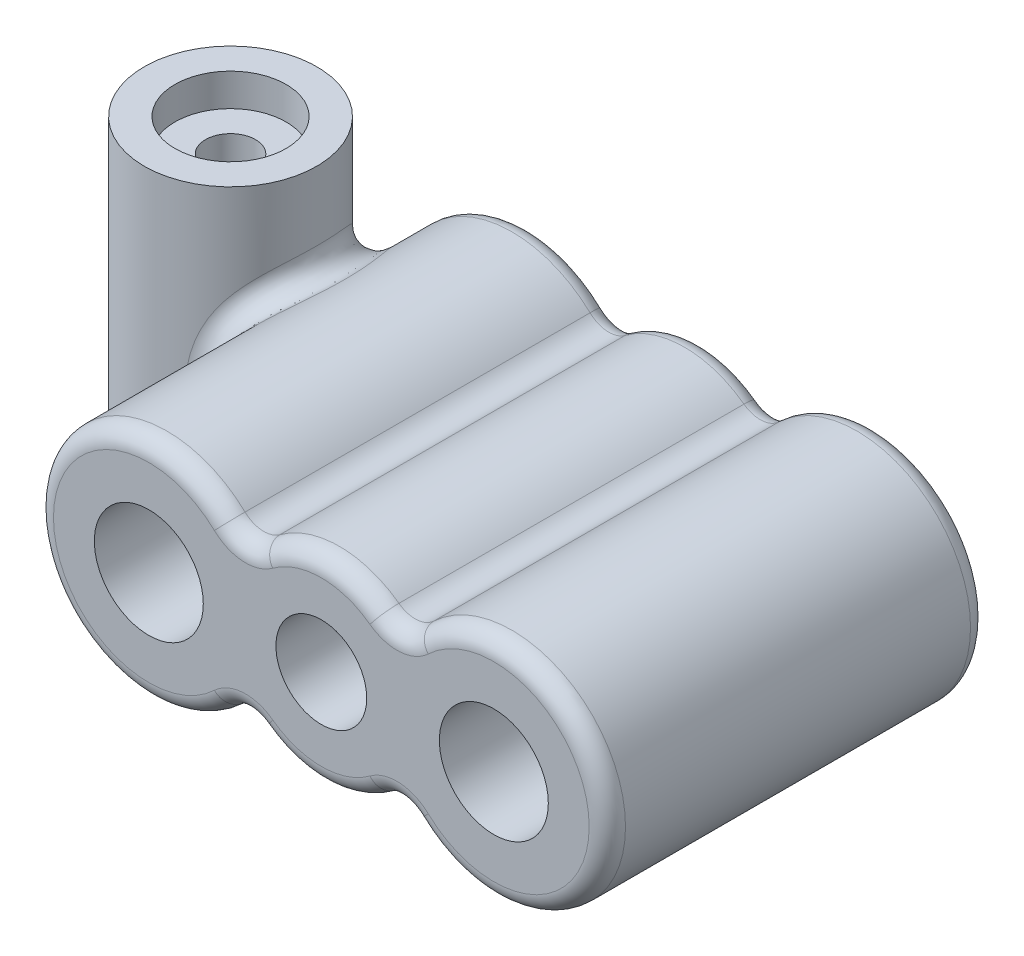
ISO-10303-21;
HEADER;
FILE_DESCRIPTION(('STEP AP214'),'2;1');
FILE_NAME('part.step','',(''),(''),'','','');
FILE_SCHEMA(('AUTOMOTIVE_DESIGN { 1 0 10303 214 1 1 1 1 }'));
ENDSEC;
DATA;
#1=APPLICATION_CONTEXT('core data for automotive mechanical design processes');
#2=APPLICATION_PROTOCOL_DEFINITION('international standard','automotive_design',2000,#1);
#3=PRODUCT_CONTEXT('',#1,'mechanical');
#4=PRODUCT('Part','Part','',(#3));
#5=PRODUCT_RELATED_PRODUCT_CATEGORY('part','',(#4));
#6=PRODUCT_DEFINITION_FORMATION('','',#4);
#7=PRODUCT_DEFINITION_CONTEXT('part definition',#1,'design');
#8=PRODUCT_DEFINITION('design','',#6,#7);
#9=PRODUCT_DEFINITION_SHAPE('','',#8);
#10=(LENGTH_UNIT() NAMED_UNIT(*) SI_UNIT(.MILLI.,.METRE.));
#11=(NAMED_UNIT(*) PLANE_ANGLE_UNIT() SI_UNIT($,.RADIAN.));
#12=(NAMED_UNIT(*) SI_UNIT($,.STERADIAN.) SOLID_ANGLE_UNIT());
#13=UNCERTAINTY_MEASURE_WITH_UNIT(LENGTH_MEASURE(1.E-05),#10,'distance_accuracy_value','');
#14=(GEOMETRIC_REPRESENTATION_CONTEXT(3) GLOBAL_UNCERTAINTY_ASSIGNED_CONTEXT((#13)) GLOBAL_UNIT_ASSIGNED_CONTEXT((#10,
#11,#12)) REPRESENTATION_CONTEXT('',''));
#15=CARTESIAN_POINT('',(0.,0.,0.));
#16=DIRECTION('',(0.,0.,1.));
#17=DIRECTION('',(1.,0.,0.));
#18=AXIS2_PLACEMENT_3D('',#15,#16,#17);
#19=CARTESIAN_POINT('',(0.,0.,42.));
#20=DIRECTION('',(0.,0.,-1.));
#21=DIRECTION('',(-1.,0.,0.));
#22=AXIS2_PLACEMENT_3D('',#19,#20,#21);
#23=CYLINDRICAL_SURFACE('',#22,12.5);
#24=CARTESIAN_POINT('',(-12.4777634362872,0.745264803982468,24.5720000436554));
#25=CARTESIAN_POINT('',(-12.4794004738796,0.717856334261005,23.4962291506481));
#26=CARTESIAN_POINT('',(-13.3767495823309,0.756297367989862,22.9035034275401));
#27=CARTESIAN_POINT('',(-14.2740986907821,0.794738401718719,22.3107777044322));
#28=CARTESIAN_POINT('',(-15.2613002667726,0.864507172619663,22.733391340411));
#29=CARTESIAN_POINT('',(-12.4964864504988,0.43177629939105,24.5812994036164));
#30=CARTESIAN_POINT('',(-12.4967320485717,0.416084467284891,23.5061358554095));
#31=CARTESIAN_POINT('',(-13.3934926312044,0.438283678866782,22.9131154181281));
#32=CARTESIAN_POINT('',(-14.2902463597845,0.460603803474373,22.3200910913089));
#33=CARTESIAN_POINT('',(-15.2792417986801,0.500860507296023,22.7410734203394));
#34=CARTESIAN_POINT('',(-12.5033951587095,0.117436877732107,24.584681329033));
#35=CARTESIAN_POINT('',(-12.5031461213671,0.113115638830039,23.5097534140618));
#36=CARTESIAN_POINT('',(-13.3996843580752,0.119187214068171,22.9166253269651));
#37=CARTESIAN_POINT('',(-14.2962220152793,0.125225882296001,22.3234969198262));
#38=CARTESIAN_POINT('',(-15.2858621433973,0.136226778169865,22.7438671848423));
#39=CARTESIAN_POINT('',(-12.493509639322,-0.510820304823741,24.5798021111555));
#40=CARTESIAN_POINT('',(-12.4939846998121,-0.492137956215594,23.5045469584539));
#41=CARTESIAN_POINT('',(-13.3908357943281,-0.518461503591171,22.9115731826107));
#42=CARTESIAN_POINT('',(-14.2876865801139,-0.544816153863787,22.3185992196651));
#43=CARTESIAN_POINT('',(-15.2763892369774,-0.592551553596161,22.7398365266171));
#44=CARTESIAN_POINT('',(-12.4767134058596,-0.824738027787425,24.5715399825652));
#45=CARTESIAN_POINT('',(-12.478402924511,-0.794568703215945,23.4957193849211));
#46=CARTESIAN_POINT('',(-13.3757937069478,-0.837013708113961,22.9030101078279));
#47=CARTESIAN_POINT('',(-14.2731696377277,-0.879641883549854,22.3102923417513));
#48=CARTESIAN_POINT('',(-15.2602940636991,-0.956696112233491,22.7330112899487));
#49=CARTESIAN_POINT('',(-12.4195616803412,-1.45023161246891,24.5429040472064));
#50=CARTESIAN_POINT('',(-12.4255595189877,-1.39628059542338,23.4652690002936));
#51=CARTESIAN_POINT('',(-13.3247542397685,-1.47107635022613,22.8734840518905));
#52=CARTESIAN_POINT('',(-14.2239344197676,-1.54605407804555,22.2816905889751));
#53=CARTESIAN_POINT('',(-15.2055278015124,-1.68226867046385,22.7093555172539));
#54=CARTESIAN_POINT('',(-12.3791902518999,-1.76180574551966,24.522522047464));
#55=CARTESIAN_POINT('',(-12.3882583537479,-1.69569836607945,23.4436230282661));
#56=CARTESIAN_POINT('',(-13.2887426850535,-1.78658458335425,22.852512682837));
#57=CARTESIAN_POINT('',(-14.1891793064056,-1.8777921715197,22.2613739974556));
#58=CARTESIAN_POINT('',(-15.1668414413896,-2.04369466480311,22.6925182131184));
#59=CARTESIAN_POINT('',(-12.2752959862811,-2.38021167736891,24.4685483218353));
#60=CARTESIAN_POINT('',(-12.2927414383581,-2.28851517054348,23.3867084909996));
#61=CARTESIAN_POINT('',(-13.1964797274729,-2.41161577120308,22.7974214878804));
#62=CARTESIAN_POINT('',(-14.1001710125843,-2.53503663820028,22.2081062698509));
#63=CARTESIAN_POINT('',(-15.0672836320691,-2.76104554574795,22.6479312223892));
#64=CARTESIAN_POINT('',(-12.211773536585,-2.6870435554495,24.4349568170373));
#65=CARTESIAN_POINT('',(-12.2344839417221,-2.58203598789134,23.3514138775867));
#66=CARTESIAN_POINT('',(-13.1402286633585,-2.72113882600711,22.7633018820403));
#67=CARTESIAN_POINT('',(-14.0458789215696,-2.86067847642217,22.1751308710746));
#68=CARTESIAN_POINT('',(-15.0064125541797,-3.11697052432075,22.6201817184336));
#69=CARTESIAN_POINT('',(-12.0605728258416,-3.30071505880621,24.3519171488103));
#70=CARTESIAN_POINT('',(-12.0967259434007,-3.16712871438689,23.2649625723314));
#71=CARTESIAN_POINT('',(-13.007146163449,-3.33853811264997,22.6798426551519));
#72=CARTESIAN_POINT('',(-13.9174684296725,-3.51040339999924,22.094661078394));
#73=CARTESIAN_POINT('',(-14.8615228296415,-3.82882946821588,22.5515837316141));
#74=CARTESIAN_POINT('',(-11.9723705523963,-3.60739119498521,24.3021206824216));
#75=CARTESIAN_POINT('',(-12.0167116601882,-3.45858948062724,23.2134204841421));
#76=CARTESIAN_POINT('',(-12.9298694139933,-3.64621120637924,22.6301697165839));
#77=CARTESIAN_POINT('',(-13.8428704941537,-3.83437812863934,22.0468140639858));
#78=CARTESIAN_POINT('',(-14.7770020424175,-4.18457378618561,22.5104475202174));
#79=CARTESIAN_POINT('',(-11.7736804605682,-4.21086060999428,24.1845027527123));
#80=CARTESIAN_POINT('',(-11.837980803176,-4.02971570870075,23.0930515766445));
#81=CARTESIAN_POINT('',(-12.7571530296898,-4.24956626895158,22.514372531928));
#82=CARTESIAN_POINT('',(-13.6761698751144,-4.46996174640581,21.9355891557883));
#83=CARTESIAN_POINT('',(-14.5866051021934,-4.88459830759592,22.4132848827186));
#84=CARTESIAN_POINT('',(-11.6631905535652,-4.50765295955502,24.1166795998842));
#85=CARTESIAN_POINT('',(-11.7392023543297,-4.30944262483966,23.0241741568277));
#86=CARTESIAN_POINT('',(-12.6617116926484,-4.54524711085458,22.4482467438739));
#87=CARTESIAN_POINT('',(-13.5840093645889,-4.78164047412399,21.8721653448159));
#88=CARTESIAN_POINT('',(-14.4807269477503,-5.22887743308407,22.3572570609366));
#89=CARTESIAN_POINT('',(-11.4218833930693,-5.0881461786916,23.9602252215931));
#90=CARTESIAN_POINT('',(-11.5255959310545,-4.8540164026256,22.8673029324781));
#91=CARTESIAN_POINT('',(-12.4551921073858,-5.12131928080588,22.2979610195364));
#92=CARTESIAN_POINT('',(-13.3845780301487,-5.38921019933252,21.7284660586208));
#93=CARTESIAN_POINT('',(-14.2494917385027,-5.90224956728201,22.2280121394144));
#94=CARTESIAN_POINT('',(-11.2910954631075,-5.37186517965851,23.8716239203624));
#95=CARTESIAN_POINT('',(-11.4107395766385,-5.11890152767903,22.7792838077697));
#96=CARTESIAN_POINT('',(-12.3441364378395,-5.40173188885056,22.2138270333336));
#97=CARTESIAN_POINT('',(-13.2772806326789,-5.68514438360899,21.6481677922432));
#98=CARTESIAN_POINT('',(-14.12416278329,-6.23136360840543,22.1548197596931));
#99=CARTESIAN_POINT('',(-11.01160414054,-5.92369104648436,23.6703961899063));
#100=CARTESIAN_POINT('',(-11.1679673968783,-5.63172319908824,22.5820874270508));
#101=CARTESIAN_POINT('',(-12.1092305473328,-5.94497985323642,22.0257789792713));
#102=CARTESIAN_POINT('',(-13.0502430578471,-6.2588183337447,21.4692700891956));
#103=CARTESIAN_POINT('',(-13.8563371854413,-6.87148161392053,21.9885881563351));
#104=CARTESIAN_POINT('',(-10.8629069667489,-6.19180328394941,23.5577780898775));
#105=CARTESIAN_POINT('',(-11.040025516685,-5.879634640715,22.4728700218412));
#106=CARTESIAN_POINT('',(-11.9853847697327,-6.2078212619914,21.9218717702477));
#107=CARTESIAN_POINT('',(-12.930478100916,-6.53653139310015,21.3706358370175));
#108=CARTESIAN_POINT('',(-13.7138465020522,-7.18249180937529,21.8955558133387));
#109=CARTESIAN_POINT('',(-10.5892281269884,-6.64608246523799,23.3362946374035));
#110=CARTESIAN_POINT('',(-10.8072380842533,-6.29797665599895,22.2610700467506));
#111=CARTESIAN_POINT('',(-11.7598076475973,-6.65167014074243,21.7208226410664));
#112=CARTESIAN_POINT('',(-12.7122230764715,-7.00566669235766,21.1804383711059));
#113=CARTESIAN_POINT('',(-13.4515907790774,-7.70945565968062,21.7125912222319));
#114=CARTESIAN_POINT('',(-10.4673472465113,-6.83624710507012,23.2332546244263));
#115=CARTESIAN_POINT('',(-10.7043572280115,-6.47256477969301,22.1633480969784));
#116=CARTESIAN_POINT('',(-11.6600807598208,-6.83696367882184,21.6282472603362));
#117=CARTESIAN_POINT('',(-12.6156561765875,-7.20162359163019,21.0930021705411));
#118=CARTESIAN_POINT('',(-13.3347971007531,-7.93004664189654,21.627471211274));
#119=CARTESIAN_POINT('',(-10.2172085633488,-7.20473402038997,23.0104932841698));
#120=CARTESIAN_POINT('',(-10.4949152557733,-6.81017954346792,21.954143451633));
#121=CARTESIAN_POINT('',(-11.4569147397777,-7.19534802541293,21.4304310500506));
#122=CARTESIAN_POINT('',(-12.4187665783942,-7.58077721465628,20.9065749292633));
#123=CARTESIAN_POINT('',(-13.0950989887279,-8.35749146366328,21.443450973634));
#124=CARTESIAN_POINT('',(-10.0889521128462,-7.38305878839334,22.8907754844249));
#125=CARTESIAN_POINT('',(-10.3883660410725,-6.97316520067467,21.8426600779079));
#126=CARTESIAN_POINT('',(-11.3534763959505,-7.3684414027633,21.3251928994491));
#127=CARTESIAN_POINT('',(-12.3184546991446,-7.7639281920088,20.8075841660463));
#128=CARTESIAN_POINT('',(-12.972195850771,-8.56434819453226,21.3445536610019));
#129=CARTESIAN_POINT('',(-9.82832132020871,-7.72661423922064,22.6337870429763));
#130=CARTESIAN_POINT('',(-10.1734297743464,-7.28693040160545,21.6055088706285));
#131=CARTESIAN_POINT('',(-11.1446396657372,-7.70165459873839,21.1017257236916));
#132=CARTESIAN_POINT('',(-12.1157169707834,-8.1165904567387,20.5978009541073));
#133=CARTESIAN_POINT('',(-12.7224435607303,-8.96287251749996,21.1322588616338));
#134=CARTESIAN_POINT('',(-9.69594985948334,-7.89185380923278,22.4965284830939));
#135=CARTESIAN_POINT('',(-10.0650655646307,-7.437667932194,21.4798591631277));
#136=CARTESIAN_POINT('',(-11.0392426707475,-7.86178322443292,20.9835056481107));
#137=CARTESIAN_POINT('',(-12.0133124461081,-8.2860545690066,20.4870249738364));
#138=CARTESIAN_POINT('',(-12.5955971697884,-9.15455041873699,21.018871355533));
#139=CARTESIAN_POINT('',(-9.42947285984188,-8.20840102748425,22.2038093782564));
#140=CARTESIAN_POINT('',(-9.84823282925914,-7.72668885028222,21.214011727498));
#141=CARTESIAN_POINT('',(-10.8281432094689,-8.16871928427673,20.733782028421));
#142=CARTESIAN_POINT('',(-11.8079456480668,-8.61090666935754,20.2534248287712));
#143=CARTESIAN_POINT('',(-12.3402426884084,-9.52174519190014,20.7770599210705));
#144=CARTESIAN_POINT('',(-9.29536727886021,-8.3597083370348,22.0483483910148));
#145=CARTESIAN_POINT('',(-9.73979399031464,-7.864919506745,21.0738353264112));
#146=CARTESIAN_POINT('',(-10.7224407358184,-8.31552639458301,20.6022781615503));
#147=CARTESIAN_POINT('',(-11.7050110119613,-8.76623530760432,20.1306201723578));
#148=CARTESIAN_POINT('',(-12.2117345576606,-9.69726167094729,20.6486356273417));
#149=CARTESIAN_POINT('',(-9.02755632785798,-8.64824483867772,21.7184296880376));
#150=CARTESIAN_POINT('',(-9.52417867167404,-8.12923911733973,20.7782616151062));
#151=CARTESIAN_POINT('',(-10.5120402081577,-8.59608405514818,20.3253732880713));
#152=CARTESIAN_POINT('',(-11.4998239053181,-9.06303272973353,19.8723827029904));
#153=CARTESIAN_POINT('',(-11.9551018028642,-10.0319640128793,20.3760940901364));
#154=CARTESIAN_POINT('',(-8.89385484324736,-8.78541386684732,21.5438968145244));
#155=CARTESIAN_POINT('',(-9.41704377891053,-8.25522579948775,20.622839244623));
#156=CARTESIAN_POINT('',(-10.4073480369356,-8.72977869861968,20.1799175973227));
#157=CARTESIAN_POINT('',(-11.3976084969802,-9.20438557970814,19.7369312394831));
#158=CARTESIAN_POINT('',(-11.8269809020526,-10.1910800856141,20.2319147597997));
#159=CARTESIAN_POINT('',(-8.63020516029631,-9.04454185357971,21.176742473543));
#160=CARTESIAN_POINT('',(-9.20629205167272,-8.49432042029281,20.2974392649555));
#161=CARTESIAN_POINT('',(-10.2011635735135,-8.98328948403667,19.8757150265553));
#162=CARTESIAN_POINT('',(-11.1959906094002,-9.47231311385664,19.4539252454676));
#163=CARTESIAN_POINT('',(-11.5743357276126,-10.4916685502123,19.9286133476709));
#164=CARTESIAN_POINT('',(-8.50025698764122,-9.16650070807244,20.9841208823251));
#165=CARTESIAN_POINT('',(-9.10270925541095,-8.6073858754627,20.1275055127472));
#166=CARTESIAN_POINT('',(-10.0996713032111,-9.10310553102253,19.7169680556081));
#167=CARTESIAN_POINT('',(-11.0966204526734,-9.59884004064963,19.3064091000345));
#168=CARTESIAN_POINT('',(-11.4498114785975,-10.6331408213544,19.7694911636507));
#169=CARTESIAN_POINT('',(-8.24683875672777,-9.39514749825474,20.5816436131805));
#170=CARTESIAN_POINT('',(-8.90081107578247,-8.82066555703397,19.7735139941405));
#171=CARTESIAN_POINT('',(-9.90161417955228,-9.32888525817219,19.3865330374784));
#172=CARTESIAN_POINT('',(-10.9024038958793,-9.83712007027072,18.9995297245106));
#173=CARTESIAN_POINT('',(-11.2069707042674,-10.8983710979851,19.4370099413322));
#174=CARTESIAN_POINT('',(-8.12336985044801,-9.50183272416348,20.3717848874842));
#175=CARTESIAN_POINT('',(-8.80252589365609,-8.92084562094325,19.5895019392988));
#176=CARTESIAN_POINT('',(-9.805050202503,-9.4348464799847,19.2148427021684));
#177=CARTESIAN_POINT('',(-10.8075863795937,-9.94883487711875,18.8402062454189));
#178=CARTESIAN_POINT('',(-11.0886552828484,-11.0221259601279,19.2636483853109));
#179=CARTESIAN_POINT('',(-7.88549958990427,-9.70014892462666,19.9361927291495));
#180=CARTESIAN_POINT('',(-8.61296404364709,-9.10842167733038,19.2081358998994));
#181=CARTESIAN_POINT('',(-9.61859301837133,-9.63301868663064,18.8591766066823));
#182=CARTESIAN_POINT('',(-10.6242335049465,-10.1576033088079,18.5102391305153));
#183=CARTESIAN_POINT('',(-10.860713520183,-11.2521727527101,18.9038113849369));
#184=CARTESIAN_POINT('',(-7.77109786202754,-9.79178051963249,19.710459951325));
#185=CARTESIAN_POINT('',(-8.52170832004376,-9.19579791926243,19.0108286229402));
#186=CARTESIAN_POINT('',(-9.52869953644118,-9.72523023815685,18.6752013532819));
#187=CARTESIAN_POINT('',(-10.5357184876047,-10.2546350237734,18.3396358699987));
#188=CARTESIAN_POINT('',(-10.751086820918,-11.3584654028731,18.7173364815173));
#189=CARTESIAN_POINT('',(-7.56119079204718,-9.95463724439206,19.2609801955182));
#190=CARTESIAN_POINT('',(-8.35389146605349,-9.35229690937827,18.6180653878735));
#191=CARTESIAN_POINT('',(-9.36321063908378,-9.89019474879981,18.3090517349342));
#192=CARTESIAN_POINT('',(-10.372554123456,-10.4280682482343,18.0000914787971));
#193=CARTESIAN_POINT('',(-10.5499410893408,-11.5473792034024,18.3460271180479));
#194=CARTESIAN_POINT('',(-7.46492486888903,-10.0268376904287,19.0381842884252));
#195=CARTESIAN_POINT('',(-8.27676149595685,-9.42225640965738,18.4234685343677));
#196=CARTESIAN_POINT('',(-9.28705579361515,-9.96385438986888,18.1276398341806));
#197=CARTESIAN_POINT('',(-10.297380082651,-10.5054240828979,17.831888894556));
#198=CARTESIAN_POINT('',(-10.4576932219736,-11.6311317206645,18.1619783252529));
#199=CARTESIAN_POINT('',(-7.2837350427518,-10.1592226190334,18.5817403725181));
#200=CARTESIAN_POINT('',(-8.13120517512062,-9.5514500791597,18.0246232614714));
#201=CARTESIAN_POINT('',(-9.14320711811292,-10.0997407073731,17.7558171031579));
#202=CARTESIAN_POINT('',(-10.155239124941,-10.6480028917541,17.4870884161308));
#203=CARTESIAN_POINT('',(-10.2840661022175,-11.7846982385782,17.7849159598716));
#204=CARTESIAN_POINT('',(-7.19881509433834,-10.219402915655,18.3480886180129));
#205=CARTESIAN_POINT('',(-8.06278438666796,-9.61067952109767,17.8203924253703));
#206=CARTESIAN_POINT('',(-9.07551623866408,-10.1619634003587,17.5654031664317));
#207=CARTESIAN_POINT('',(-10.0882776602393,-10.7132206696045,17.3105057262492));
#208=CARTESIAN_POINT('',(-10.2026906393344,-11.8545073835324,17.5918992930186));
#209=CARTESIAN_POINT('',(-7.04167370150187,-10.3283093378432,17.8717180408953));
#210=CARTESIAN_POINT('',(-7.9358210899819,-9.71857409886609,17.4036492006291));
#211=CARTESIAN_POINT('',(-8.94980582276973,-10.2752068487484,17.1768059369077));
#212=CARTESIAN_POINT('',(-9.963820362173,-10.8318127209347,16.9500543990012));
#213=CARTESIAN_POINT('',(-10.0521081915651,-11.9808388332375,17.1983757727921));
#214=CARTESIAN_POINT('',(-6.96944855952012,-10.3770388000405,17.6290018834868));
#215=CARTESIAN_POINT('',(-7.87727266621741,-9.76724591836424,17.1911484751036));
#216=CARTESIAN_POINT('',(-8.89178347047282,-10.32623086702,16.9786249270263));
#217=CARTESIAN_POINT('',(-9.90631889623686,-10.8851945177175,16.7661959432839));
#218=CARTESIAN_POINT('',(-9.98289766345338,-12.0373650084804,16.9978711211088));
#219=CARTESIAN_POINT('',(-6.83866355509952,-10.4636915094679,17.1360361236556));
#220=CARTESIAN_POINT('',(-7.77098065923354,-9.85428731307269,16.759116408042));
#221=CARTESIAN_POINT('',(-8.7863745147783,-10.4174106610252,16.5756285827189));
#222=CARTESIAN_POINT('',(-9.80179327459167,-10.9805124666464,16.3922355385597));
#223=CARTESIAN_POINT('',(-9.85757151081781,-12.1378821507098,16.5906385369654));
#224=CARTESIAN_POINT('',(-6.78010888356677,-10.5016106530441,16.8857837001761));
#225=CARTESIAN_POINT('',(-7.72323451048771,-9.89265912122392,16.5395792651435));
#226=CARTESIAN_POINT('',(-8.73899195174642,-10.4575623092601,16.3708107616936));
#227=CARTESIAN_POINT('',(-9.7547666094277,-11.0224510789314,16.2021285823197));
#228=CARTESIAN_POINT('',(-9.80146086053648,-12.181868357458,16.3839082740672));
#229=CARTESIAN_POINT('',(-6.67659846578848,-10.5677279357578,16.3752135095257));
#230=CARTESIAN_POINT('',(-7.6386552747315,-9.95986191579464,16.0912511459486));
#231=CARTESIAN_POINT('',(-8.65501015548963,-10.5278444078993,15.9524502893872));
#232=CARTESIAN_POINT('',(-9.67138311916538,-11.0958117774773,15.8137389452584));
#233=CARTESIAN_POINT('',(-9.7022708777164,-12.2585644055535,15.9621328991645));
#234=CARTESIAN_POINT('',(-6.63189221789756,-10.5957488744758,16.1147968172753));
#235=CARTESIAN_POINT('',(-7.60201393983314,-9.98852593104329,15.8623492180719));
#236=CARTESIAN_POINT('',(-8.61860904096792,-10.5577918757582,15.738818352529));
#237=CARTESIAN_POINT('',(-9.63521384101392,-11.127049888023,15.6153574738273));
#238=CARTESIAN_POINT('',(-9.65943062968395,-12.2910686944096,15.7470060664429));
#239=CARTESIAN_POINT('',(-6.55802071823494,-10.6416284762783,15.589737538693));
#240=CARTESIAN_POINT('',(-7.54138352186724,-10.0355978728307,15.4004870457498));
#241=CARTESIAN_POINT('',(-8.55835073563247,-10.6069562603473,15.3076784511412));
#242=CARTESIAN_POINT('',(-9.57532788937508,-11.1783065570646,15.2149403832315));
#243=CARTESIAN_POINT('',(-9.58864246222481,-12.3442890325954,15.3132614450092));
#244=CARTESIAN_POINT('',(-6.52886084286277,-10.6594836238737,15.3250935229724));
#245=CARTESIAN_POINT('',(-7.51739114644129,-10.0540083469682,15.167499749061));
#246=CARTESIAN_POINT('',(-8.53449788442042,-10.6261694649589,15.0901691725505));
#247=CARTESIAN_POINT('',(-9.55160796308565,-11.1983278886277,15.0128813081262));
#248=CARTESIAN_POINT('',(-9.56069969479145,-12.3650010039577,15.0946424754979));
#249=CARTESIAN_POINT('',(-6.48646516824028,-10.6853351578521,14.7934520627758));
#250=CARTESIAN_POINT('',(-7.48248844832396,-10.0806983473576,14.6992561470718));
#251=CARTESIAN_POINT('',(-8.49978856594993,-10.6540215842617,14.6529613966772));
#252=CARTESIAN_POINT('',(-9.51709216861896,-11.2273420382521,14.606709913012));
#253=CARTESIAN_POINT('',(-9.52007357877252,-12.3949887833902,14.6554603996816));
#254=CARTESIAN_POINT('',(-6.47322942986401,-10.6933315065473,14.5264546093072));
#255=CARTESIAN_POINT('',(-7.47157313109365,-10.0889817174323,14.4639671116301));
#256=CARTESIAN_POINT('',(-8.48893214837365,-10.6626604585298,14.4332628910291));
#257=CARTESIAN_POINT('',(-9.50629136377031,-11.2363390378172,14.4025692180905));
#258=CARTESIAN_POINT('',(-9.50739028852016,-12.4042645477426,14.434897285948));
#259=CARTESIAN_POINT('',(-6.46284084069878,-10.6996132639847,13.9918845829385));
#260=CARTESIAN_POINT('',(-7.46300842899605,-10.0954859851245,13.9928600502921));
#261=CARTESIAN_POINT('',(-8.48041260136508,-10.6694451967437,13.9933280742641));
#262=CARTESIAN_POINT('',(-9.49781699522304,-11.2434042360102,13.9938072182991));
#263=CARTESIAN_POINT('',(-9.49743530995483,-12.4115513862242,13.9932959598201));
#264=CARTESIAN_POINT('',(-6.46568821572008,-10.6978985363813,13.7243120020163));
#265=CARTESIAN_POINT('',(-7.46535792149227,-10.0937077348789,13.7570059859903));
#266=CARTESIAN_POINT('',(-8.4827496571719,-10.6675909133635,13.7730917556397));
#267=CARTESIAN_POINT('',(-9.50014232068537,-11.2414733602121,13.7891546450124));
#268=CARTESIAN_POINT('',(-9.50016383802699,-12.4095623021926,13.7722577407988));
#269=CARTESIAN_POINT('',(-6.4877692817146,-10.6845227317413,13.1821236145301));
#270=CARTESIAN_POINT('',(-7.48355678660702,-10.0798666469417,13.2792471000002));
#271=CARTESIAN_POINT('',(-8.50085149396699,-10.653151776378,13.326957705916));
#272=CARTESIAN_POINT('',(-9.51814715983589,-11.2264361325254,13.3746447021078));
#273=CARTESIAN_POINT('',(-9.52132325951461,-12.3940463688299,13.3243629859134));
#274=CARTESIAN_POINT('',(-6.50750583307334,-10.6725564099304,12.9075452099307));
#275=CARTESIAN_POINT('',(-7.49982334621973,-10.0674859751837,13.0373427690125));
#276=CARTESIAN_POINT('',(-8.51702833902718,-10.640237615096,13.1010949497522));
#277=CARTESIAN_POINT('',(-9.53423935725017,-11.2129844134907,13.1647891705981));
#278=CARTESIAN_POINT('',(-9.54023602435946,-12.3801654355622,13.0975373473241));
#279=CARTESIAN_POINT('',(-6.5637726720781,-10.6380437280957,12.3617121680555));
#280=CARTESIAN_POINT('',(-7.54609976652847,-10.0319258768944,12.5567994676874));
#281=CARTESIAN_POINT('',(-8.56303956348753,-10.6031187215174,12.6524400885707));
#282=CARTESIAN_POINT('',(-9.57998515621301,-11.174306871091,12.7480234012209));
#283=CARTESIAN_POINT('',(-9.59415433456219,-12.3401307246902,12.6466317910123));
#284=CARTESIAN_POINT('',(-6.60029722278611,-10.6155009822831,12.0904564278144));
#285=CARTESIAN_POINT('',(-7.57611175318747,-10.0087448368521,12.3181260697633));
#286=CARTESIAN_POINT('',(-8.59286927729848,-10.5789178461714,12.4296469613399));
#287=CARTESIAN_POINT('',(-9.60964086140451,-11.1490792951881,12.5410832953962));
#288=CARTESIAN_POINT('',(-9.6291543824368,-12.3139811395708,12.4225509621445));
#289=CARTESIAN_POINT('',(-6.68966767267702,-10.5594094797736,11.553034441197));
#290=CARTESIAN_POINT('',(-7.64933872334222,-9.95139866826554,11.8457116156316));
#291=CARTESIAN_POINT('',(-8.66562153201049,-10.5189930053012,11.9887170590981));
#292=CARTESIAN_POINT('',(-9.68191811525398,-11.0865759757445,12.1316383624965));
#293=CARTESIAN_POINT('',(-9.71479458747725,-12.2489149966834,11.9785936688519));
#294=CARTESIAN_POINT('',(-6.74251948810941,-10.5258567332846,11.2868700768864));
#295=CARTESIAN_POINT('',(-7.69256753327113,-9.91722223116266,11.6119485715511));
#296=CARTESIAN_POINT('',(-8.7085488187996,-10.4832648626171,11.7705820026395));
#297=CARTESIAN_POINT('',(-9.72455326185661,-11.0492878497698,11.9291145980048));
#298=CARTESIAN_POINT('',(-9.76544041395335,-12.2099938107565,11.758718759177));
#299=CARTESIAN_POINT('',(-6.86377202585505,-10.4471933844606,10.7618141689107));
#300=CARTESIAN_POINT('',(-7.79141182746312,-9.83767202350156,11.1513022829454));
#301=CARTESIAN_POINT('',(-8.80664286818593,-10.4000108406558,11.340803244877));
#302=CARTESIAN_POINT('',(-9.82189669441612,-10.9623303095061,11.5302037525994));
#303=CARTESIAN_POINT('',(-9.88163197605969,-12.1187443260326,11.3249769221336));
#304=CARTESIAN_POINT('',(-6.93216638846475,-10.4020875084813,10.502919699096));
#305=CARTESIAN_POINT('',(-7.84703112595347,-9.79229510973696,10.9244051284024));
#306=CARTESIAN_POINT('',(-8.86180462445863,-10.3524897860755,11.1291569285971));
#307=CARTESIAN_POINT('',(-9.87660872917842,-10.9126574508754,11.3338046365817));
#308=CARTESIAN_POINT('',(-9.94717161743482,-12.0664215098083,11.1111075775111));
#309=CARTESIAN_POINT('',(-7.08308994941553,-10.2999073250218,9.99559527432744));
#310=CARTESIAN_POINT('',(-7.9693306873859,-9.69034602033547,10.4802093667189));
#311=CARTESIAN_POINT('',(-8.9829971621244,-10.2455925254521,10.7148916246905));
#312=CARTESIAN_POINT('',(-9.99669361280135,-10.8008126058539,10.9494708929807));
#313=CARTESIAN_POINT('',(-10.0917957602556,-11.9478924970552,10.6920134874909));
#314=CARTESIAN_POINT('',(-7.16554294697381,-10.2428971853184,9.74711746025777));
#315=CARTESIAN_POINT('',(-8.03595724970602,-9.63382798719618,10.2628694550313));
#316=CARTESIAN_POINT('',(-9.04896927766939,-10.1862799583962,10.5122310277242));
#317=CARTESIAN_POINT('',(-10.0620146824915,-10.7387010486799,10.7614997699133));
#318=CARTESIAN_POINT('',(-10.1708072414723,-11.8817607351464,10.4867492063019));
#319=CARTESIAN_POINT('',(-7.34347420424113,-10.1160915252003,9.26118793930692));
#320=CARTESIAN_POINT('',(-8.17925882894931,-9.509217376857,9.83808136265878));
#321=CARTESIAN_POINT('',(-9.19071606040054,-10.0553421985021,10.1161905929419));
#322=CARTESIAN_POINT('',(-10.202206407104,-10.6014364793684,10.3942068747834));
#323=CARTESIAN_POINT('',(-10.3413118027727,-11.7346661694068,10.0853291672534));
#324=CARTESIAN_POINT('',(-7.43894705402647,-10.0463013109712,9.02373170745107));
#325=CARTESIAN_POINT('',(-8.25592992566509,-9.44112805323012,9.63064697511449));
#326=CARTESIAN_POINT('',(-9.26648665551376,-9.98372211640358,9.92280694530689));
#327=CARTESIAN_POINT('',(-10.2770732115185,-10.5262870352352,10.2148970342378));
#328=CARTESIAN_POINT('',(-10.4327996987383,-11.6537095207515,9.88916967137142));
#329=CARTESIAN_POINT('',(-7.64127750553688,-9.89327810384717,8.56159441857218));
#330=CARTESIAN_POINT('',(-8.41798221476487,-9.29314705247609,9.22689896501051));
#331=CARTESIAN_POINT('',(-9.42643924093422,-9.82787467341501,9.54642638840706));
#332=CARTESIAN_POINT('',(-10.4349260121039,-10.3625733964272,9.86588351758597));
#333=CARTESIAN_POINT('',(-10.6266850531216,-11.4762026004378,9.50740408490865));
#334=CARTESIAN_POINT('',(-7.74813210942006,-9.81004864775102,8.33691002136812));
#335=CARTESIAN_POINT('',(-8.50335375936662,-9.21326376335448,9.03061297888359));
#336=CARTESIAN_POINT('',(-9.51061901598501,-9.74365062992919,9.36342676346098));
#337=CARTESIAN_POINT('',(-10.517902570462,-10.2740184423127,9.69620373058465));
#338=CARTESIAN_POINT('',(-10.7290796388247,-11.3796564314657,9.32179523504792));
#339=CARTESIAN_POINT('',(-7.97128898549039,-9.62959642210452,7.90187680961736));
#340=CARTESIAN_POINT('',(-8.68137097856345,-9.04149436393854,8.65015109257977));
#341=CARTESIAN_POINT('',(-9.68590941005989,-9.56234313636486,9.00868040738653));
#342=CARTESIAN_POINT('',(-10.6904662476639,-10.083172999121,9.36717225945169));
#343=CARTESIAN_POINT('',(-10.942922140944,-11.170331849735,8.96241997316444));
#344=CARTESIAN_POINT('',(-8.08759091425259,-9.53237416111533,7.69152747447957));
#345=CARTESIAN_POINT('',(-8.77400052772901,-8.94962295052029,8.46601444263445));
#346=CARTESIAN_POINT('',(-9.77701977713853,-9.46526015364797,8.83693326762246));
#347=CARTESIAN_POINT('',(-10.7800376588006,-9.98089876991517,9.20785449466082));
#348=CARTESIAN_POINT('',(-11.0543697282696,-11.0575540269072,8.78865313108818));
#349=CARTESIAN_POINT('',(-8.32317560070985,-9.32728581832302,7.29366055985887));
#350=CARTESIAN_POINT('',(-8.96163529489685,-8.7571995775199,8.11691136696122));
#351=CARTESIAN_POINT('',(-9.96130591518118,-9.26173097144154,8.51121457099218));
#352=CARTESIAN_POINT('',(-10.9609756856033,-9.76626339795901,8.90551929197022));
#353=CARTESIAN_POINT('',(-11.2801213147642,-10.8196515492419,8.45998046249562));
#354=CARTESIAN_POINT('',(-8.44220873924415,-9.21991578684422,7.10559950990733));
#355=CARTESIAN_POINT('',(-9.05641990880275,-8.65709015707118,7.95153820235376));
#356=CARTESIAN_POINT('',(-10.0542956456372,-9.15573550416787,8.35682981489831));
#357=CARTESIAN_POINT('',(-11.0521467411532,-9.65440988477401,8.76216005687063));
#358=CARTESIAN_POINT('',(-11.3941861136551,-10.6951023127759,8.30462568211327));
#359=CARTESIAN_POINT('',(-8.68479246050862,-8.99177907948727,6.74498472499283));
#360=CARTESIAN_POINT('',(-9.24991266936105,-8.44551845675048,7.63329382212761));
#361=CARTESIAN_POINT('',(-10.2438527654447,-8.93157435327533,8.05956567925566));
#362=CARTESIAN_POINT('',(-11.2377686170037,-9.4176590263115,8.48587556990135));
#363=CARTESIAN_POINT('',(-11.6266446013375,-10.4304637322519,8.00672651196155));
#364=CARTESIAN_POINT('',(-8.80834290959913,-8.8710127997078,6.5724305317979));
#365=CARTESIAN_POINT('',(-9.34859439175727,-8.3340870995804,7.48046062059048));
#366=CARTESIAN_POINT('',(-10.3404200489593,-8.81340902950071,7.91668595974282));
#367=CARTESIAN_POINT('',(-11.3321942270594,-9.29279638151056,8.35298344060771));
#368=CARTESIAN_POINT('',(-11.7450381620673,-10.2903748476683,7.86418174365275));
#369=CARTESIAN_POINT('',(-9.05767625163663,-8.61627856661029,6.24336910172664));
#370=CARTESIAN_POINT('',(-9.54842350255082,-8.09988474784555,7.18757581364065));
#371=CARTESIAN_POINT('',(-10.5356980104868,-8.56495391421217,7.64265119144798));
#372=CARTESIAN_POINT('',(-11.5229215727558,-9.03008797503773,8.09779816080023));
#373=CARTESIAN_POINT('',(-11.9839645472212,-9.99488313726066,7.59234838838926));
#374=CARTESIAN_POINT('',(-9.1834591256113,-8.48231072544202,6.08686172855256));
#375=CARTESIAN_POINT('',(-9.64954240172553,-7.97715164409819,7.04755723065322));
#376=CARTESIAN_POINT('',(-10.6344086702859,-8.43466422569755,7.51149604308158));
#377=CARTESIAN_POINT('',(-11.6191963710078,-8.89228485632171,7.97553406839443));
#378=CARTESIAN_POINT('',(-12.1044973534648,-9.83948044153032,7.46305968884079));
#379=CARTESIAN_POINT('',(-9.43498104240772,-8.20162423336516,5.79003668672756));
#380=CARTESIAN_POINT('',(-9.85275887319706,-7.72045018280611,6.78037898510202));
#381=CARTESIAN_POINT('',(-10.8325352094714,-8.16212284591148,7.26096177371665));
#382=CARTESIAN_POINT('',(-11.8122334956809,-8.60390290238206,7.74164339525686));
#383=CARTESIAN_POINT('',(-12.3455209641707,-9.51388411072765,7.21785639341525));
#384=CARTESIAN_POINT('',(-9.56072008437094,-8.05490534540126,5.6497193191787));
#385=CARTESIAN_POINT('',(-9.9548291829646,-7.58652397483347,6.65324425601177));
#386=CARTESIAN_POINT('',(-10.9319511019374,-8.01987093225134,7.14158287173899));
#387=CARTESIAN_POINT('',(-11.9089702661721,-8.45337153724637,7.63003911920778));
#388=CARTESIAN_POINT('',(-12.4660117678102,-9.34369020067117,7.10194204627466));
#389=CARTESIAN_POINT('',(-9.81050475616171,-7.74875400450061,5.38448028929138));
#390=CARTESIAN_POINT('',(-10.1588663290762,-7.30707236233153,6.41122160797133));
#391=CARTESIAN_POINT('',(-11.130464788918,-7.72308129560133,6.91402908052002));
#392=CARTESIAN_POINT('',(-12.1019601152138,-8.13924439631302,7.41695492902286));
#393=CARTESIAN_POINT('',(-12.7053706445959,-8.98855464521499,6.88283154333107));
#394=CARTESIAN_POINT('',(-9.93454095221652,-7.58927031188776,5.2596263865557));
#395=CARTESIAN_POINT('',(-10.2608082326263,-7.16154351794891,6.29640207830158));
#396=CARTESIAN_POINT('',(-11.2295594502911,-7.5684940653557,6.80590381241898));
#397=CARTESIAN_POINT('',(-12.1981883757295,-7.97564467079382,7.31553312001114));
#398=CARTESIAN_POINT('',(-12.8242296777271,-8.80355356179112,6.77969136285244));
#399=CARTESIAN_POINT('',(-10.178355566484,-7.25900883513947,5.02542895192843));
#400=CARTESIAN_POINT('',(-10.4626200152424,-6.85975100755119,6.07935288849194));
#401=CARTESIAN_POINT('',(-11.4255569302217,-7.24801902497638,6.60120595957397));
#402=CARTESIAN_POINT('',(-12.3883719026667,-7.63648633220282,7.12318653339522));
#403=CARTESIAN_POINT('',(-13.0578676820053,-8.4204502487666,6.58622391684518));
#404=CARTESIAN_POINT('',(-10.2981339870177,-7.08823105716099,4.91608541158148));
#405=CARTESIAN_POINT('',(-10.5624738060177,-6.70352862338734,5.97712763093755));
#406=CARTESIAN_POINT('',(-11.5224597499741,-7.08213122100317,6.50463336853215));
#407=CARTESIAN_POINT('',(-12.4823124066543,-7.46097398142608,7.03226647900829));
#408=CARTESIAN_POINT('',(-13.1726466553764,-8.222348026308,6.49589664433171));
#409=CARTESIAN_POINT('',(-10.5316808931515,-6.73634170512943,4.7120351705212));
#410=CARTESIAN_POINT('',(-10.7586274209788,-6.38083024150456,5.78481742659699));
#411=CARTESIAN_POINT('',(-11.7126825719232,-6.73962494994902,6.32266521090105));
#412=CARTESIAN_POINT('',(-12.6666046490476,-7.09865909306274,6.86064042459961));
#413=CARTESIAN_POINT('',(-13.3964455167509,-7.81415637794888,6.32733340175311));
#414=CARTESIAN_POINT('',(-10.6454482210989,-6.55522815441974,4.61733128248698));
#415=CARTESIAN_POINT('',(-10.8549190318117,-6.21438718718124,5.69473008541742));
#416=CARTESIAN_POINT('',(-11.8060018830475,-6.56300442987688,6.23727179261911));
#417=CARTESIAN_POINT('',(-12.7569489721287,-6.91189327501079,6.77993303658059));
#418=CARTESIAN_POINT('',(-13.505464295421,-7.6040646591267,6.24909975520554));
#419=CARTESIAN_POINT('',(-10.8654489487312,-6.18373973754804,4.44153845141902));
#420=CARTESIAN_POINT('',(-11.0425058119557,-5.87191305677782,5.52615210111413));
#421=CARTESIAN_POINT('',(-11.9877056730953,-6.19978398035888,6.07720983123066));
#422=CARTESIAN_POINT('',(-12.9327697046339,-6.52792620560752,6.62838726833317));
#423=CARTESIAN_POINT('',(-13.7162823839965,-7.17313809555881,6.103879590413));
#424=CARTESIAN_POINT('',(-10.9716813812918,-5.99336368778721,4.36045125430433));
#425=CARTESIAN_POINT('',(-11.1338015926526,-5.69590639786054,5.44765121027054));
#426=CARTESIAN_POINT('',(-12.0760895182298,-6.01318277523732,6.00254266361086));
#427=CARTESIAN_POINT('',(-13.0182469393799,-6.33075190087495,6.5575404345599));
#428=CARTESIAN_POINT('',(-13.8180807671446,-6.95230187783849,6.03689451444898));
#429=CARTESIAN_POINT('',(-11.1864551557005,-5.58323145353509,4.20260433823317));
#430=CARTESIAN_POINT('',(-11.3196568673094,-5.31544465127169,5.29365385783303));
#431=CARTESIAN_POINT('',(-12.2559708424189,-5.61001328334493,5.85580690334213));
#432=CARTESIAN_POINT('',(-13.1921248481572,-5.90494018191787,6.41809059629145));
#433=CARTESIAN_POINT('',(-14.0238900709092,-6.4765484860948,5.9064992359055));
#434=CARTESIAN_POINT('',(-11.2939855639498,-5.36253495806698,4.12728019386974));
#435=CARTESIAN_POINT('',(-11.413516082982,-5.10996367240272,5.21938264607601));
#436=CARTESIAN_POINT('',(-12.3467572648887,-5.39239582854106,5.78490908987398));
#437=CARTESIAN_POINT('',(-13.2798556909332,-5.67519710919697,6.35054322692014));
#438=CARTESIAN_POINT('',(-14.126932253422,-6.22054055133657,5.84427494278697));
#439=CARTESIAN_POINT('',(-11.496863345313,-4.91254197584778,3.99041792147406));
#440=CARTESIAN_POINT('',(-11.5918277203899,-4.68936918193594,5.08335366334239));
#441=CARTESIAN_POINT('',(-12.5191994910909,-4.94722780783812,5.65482191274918));
#442=CARTESIAN_POINT('',(-13.4464280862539,-5.20545545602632,6.22639817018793));
#443=CARTESIAN_POINT('',(-14.3213420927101,-5.69854869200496,5.73121480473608));
#444=CARTESIAN_POINT('',(-11.5922098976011,-4.68324491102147,3.9288807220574));
#445=CARTESIAN_POINT('',(-11.6763013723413,-4.47425613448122,5.02157121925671));
#446=CARTESIAN_POINT('',(-12.6008546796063,-4.71967657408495,5.59563333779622));
#447=CARTESIAN_POINT('',(-13.5252896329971,-4.96545659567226,6.16977871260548));
#448=CARTESIAN_POINT('',(-14.4127089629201,-5.43256409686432,5.68037972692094));
#449=CARTESIAN_POINT('',(-11.7697609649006,-4.21722235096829,3.81803261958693));
#450=CARTESIAN_POINT('',(-11.8345340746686,-4.03548913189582,4.90948512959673));
#451=CARTESIAN_POINT('',(-12.7538029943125,-4.25578425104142,5.48806847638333));
#452=CARTESIAN_POINT('',(-13.6729530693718,-4.47643921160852,6.066735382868));
#453=CARTESIAN_POINT('',(-14.5828492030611,-4.89197792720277,5.58880955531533));
#454=CARTESIAN_POINT('',(-11.851952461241,-3.98048977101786,3.76873380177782));
#455=CARTESIAN_POINT('',(-11.9083102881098,-3.81180929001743,4.85916711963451));
#456=CARTESIAN_POINT('',(-12.8250858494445,-4.01943473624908,5.43970288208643));
#457=CARTESIAN_POINT('',(-13.7417710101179,-4.22739155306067,6.02029850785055));
#458=CARTESIAN_POINT('',(-14.661610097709,-4.61736813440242,5.54808444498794));
#459=CARTESIAN_POINT('',(-12.0022988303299,-3.50113407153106,3.68107535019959));
#460=CARTESIAN_POINT('',(-12.0439099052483,-3.35746777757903,4.76914809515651));
#461=CARTESIAN_POINT('',(-12.9561135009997,-3.53956397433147,5.35304181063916));
#462=CARTESIAN_POINT('',(-13.8682264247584,-3.72199195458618,5.93699542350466));
#463=CARTESIAN_POINT('',(-14.8056811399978,-4.0613155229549,5.4756709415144));
#464=CARTESIAN_POINT('',(-12.0704526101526,-3.2585104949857,3.64271656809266));
#465=CARTESIAN_POINT('',(-12.1057620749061,-3.12677098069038,4.72942449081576));
#466=CARTESIAN_POINT('',(-13.0158573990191,-3.29604217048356,5.31474711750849));
#467=CARTESIAN_POINT('',(-13.9258907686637,-3.46560033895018,5.90010864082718));
#468=CARTESIAN_POINT('',(-14.8709902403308,-3.77987217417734,5.44398325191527));
#469=CARTESIAN_POINT('',(-12.2016974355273,-2.73017021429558,3.57051359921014));
#470=CARTESIAN_POINT('',(-12.2252921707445,-2.62316951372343,4.65429320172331));
#471=CARTESIAN_POINT('',(-13.1313436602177,-2.76456457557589,5.24221402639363));
#472=CARTESIAN_POINT('',(-14.0373115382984,-2.90634227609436,5.83018738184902));
#473=CARTESIAN_POINT('',(-14.9967570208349,-3.16699744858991,5.38433732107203));
#474=CARTESIAN_POINT('',(-12.2623141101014,-2.44366781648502,3.53832345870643));
#475=CARTESIAN_POINT('',(-12.2808436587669,-2.34919964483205,4.62050578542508));
#476=CARTESIAN_POINT('',(-13.1849854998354,-2.47563473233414,5.20955614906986));
#477=CARTESIAN_POINT('',(-14.0890829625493,-2.6023595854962,5.79863326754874));
#478=CARTESIAN_POINT('',(-15.0548436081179,-2.83465466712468,5.35774546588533));
#479=CARTESIAN_POINT('',(-12.363368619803,-1.8662915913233,3.48560162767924));
#480=CARTESIAN_POINT('',(-12.3736867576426,-1.7959449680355,4.56496580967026));
#481=CARTESIAN_POINT('',(-13.2746665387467,-1.89227745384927,5.15580644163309));
#482=CARTESIAN_POINT('',(-14.1756013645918,-1.98890127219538,5.74667386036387));
#483=CARTESIAN_POINT('',(-15.151680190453,-2.16489824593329,5.31419264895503));
#484=CARTESIAN_POINT('',(-12.4038019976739,-1.57541681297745,3.4650725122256));
#485=CARTESIAN_POINT('',(-12.4110098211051,-1.51656116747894,4.54319357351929));
#486=CARTESIAN_POINT('',(-13.310701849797,-1.5978488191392,5.13471716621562));
#487=CARTESIAN_POINT('',(-14.210377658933,-1.67931557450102,5.72625024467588));
#488=CARTESIAN_POINT('',(-15.1904259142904,-1.82748350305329,5.29723381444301));
#489=CARTESIAN_POINT('',(-12.4640525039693,-0.991646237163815,3.43475439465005));
#490=CARTESIAN_POINT('',(-12.4666815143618,-0.955216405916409,4.51098650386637));
#491=CARTESIAN_POINT('',(-13.364473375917,-1.00628596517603,5.10349420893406));
#492=CARTESIAN_POINT('',(-14.2622488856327,-1.05753475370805,5.69601134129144));
#493=CARTESIAN_POINT('',(-15.2481616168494,-1.15030963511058,5.27218841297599));
#494=CARTESIAN_POINT('',(-12.4839049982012,-0.698754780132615,3.42494696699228));
#495=CARTESIAN_POINT('',(-12.4850853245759,-0.673149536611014,4.50051891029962));
#496=CARTESIAN_POINT('',(-13.3822409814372,-0.709157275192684,5.09334173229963));
#497=CARTESIAN_POINT('',(-14.2793952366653,-0.745221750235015,5.68616537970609));
#498=CARTESIAN_POINT('',(-15.2671854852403,-0.81055554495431,5.26408662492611));
#499=CARTESIAN_POINT('',(-12.502935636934,-0.112290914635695,3.4155398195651));
#500=CARTESIAN_POINT('',(-12.5027179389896,-0.108241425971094,4.49048433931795));
#501=CARTESIAN_POINT('',(-13.3992714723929,-0.113999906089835,5.08360529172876));
#502=CARTESIAN_POINT('',(-14.2958231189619,-0.119816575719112,5.67672729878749));
#503=CARTESIAN_POINT('',(-15.2854218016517,-0.130257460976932,5.2563155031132));
#504=CARTESIAN_POINT('',(-12.5021238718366,0.181281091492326,3.41593511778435));
#505=CARTESIAN_POINT('',(-12.5019634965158,0.174717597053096,4.49090783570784));
#506=CARTESIAN_POINT('',(-13.3985433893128,0.184028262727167,5.08401616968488));
#507=CARTESIAN_POINT('',(-14.295120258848,0.193406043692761,5.6771262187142));
#508=CARTESIAN_POINT('',(-15.2846439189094,0.210286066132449,5.2566420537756));
#509=CARTESIAN_POINT('',(-12.4858442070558,0.610047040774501,3.42399149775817));
#510=CARTESIAN_POINT('',(-12.4868836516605,0.587670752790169,4.49949853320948));
#511=CARTESIAN_POINT('',(-13.3839772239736,0.619124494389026,5.09235190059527));
#512=CARTESIAN_POINT('',(-14.2810706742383,0.650592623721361,5.68520534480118));
#513=CARTESIAN_POINT('',(-15.2690437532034,0.707654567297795,5.26329732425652));
#514=CARTESIAN_POINT('',(-12.478478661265,0.745653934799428,3.4276378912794));
#515=CARTESIAN_POINT('',(-12.4800598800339,0.71826068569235,4.50338725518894));
#516=CARTESIAN_POINT('',(-13.3773873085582,0.756707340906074,5.09612432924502));
#517=CARTESIAN_POINT('',(-14.2747130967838,0.795180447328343,5.6888623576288));
#518=CARTESIAN_POINT('',(-15.2619856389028,0.864958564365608,5.26630956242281));
#519=CARTESIAN_POINT('',(-12.459340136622,1.01650201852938,3.43716743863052));
#520=CARTESIAN_POINT('',(-12.4623468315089,0.978968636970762,4.51353526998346));
#521=CARTESIAN_POINT('',(-13.3602791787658,1.0314057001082,5.10596726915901));
#522=CARTESIAN_POINT('',(-14.2582098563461,1.08386945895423,5.69840021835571));
#523=CARTESIAN_POINT('',(-15.2436459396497,1.17914234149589,5.27418179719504));
#524=CARTESIAN_POINT('',(-12.4475670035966,1.15174319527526,3.44305067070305));
#525=CARTESIAN_POINT('',(-12.4514558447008,1.10909804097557,4.51979555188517));
#526=CARTESIAN_POINT('',(-13.3497608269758,1.16852119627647,5.11203786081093));
#527=CARTESIAN_POINT('',(-14.2480626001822,1.22798326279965,5.70428199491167));
#528=CARTESIAN_POINT('',(-15.2323642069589,1.33602210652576,5.2790418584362));
#529=CARTESIAN_POINT('',(-12.4026276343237,1.58596457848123,3.465661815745));
#530=CARTESIAN_POINT('',(-12.4099233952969,1.52670463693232,4.54382051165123));
#531=CARTESIAN_POINT('',(-13.3096533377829,1.60853452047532,5.13532454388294));
#532=CARTESIAN_POINT('',(-14.209365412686,1.69055220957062,5.72683903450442));
#533=CARTESIAN_POINT('',(-15.1893005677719,1.83971891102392,5.297720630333));
#534=CARTESIAN_POINT('',(-12.3608617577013,1.88394038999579,3.48687473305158));
#535=CARTESIAN_POINT('',(-12.3713720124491,1.81289823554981,4.56631654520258));
#536=CARTESIAN_POINT('',(-13.2724325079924,1.91013906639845,5.15711426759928));
#537=CARTESIAN_POINT('',(-14.1734445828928,2.00768828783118,5.74794090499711));
#538=CARTESIAN_POINT('',(-15.1492779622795,2.18537085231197,5.31524434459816));
#539=CARTESIAN_POINT('',(-12.2561242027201,2.47541762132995,3.54159056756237));
#540=CARTESIAN_POINT('',(-12.2751657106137,2.37959515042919,4.62393926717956));
#541=CARTESIAN_POINT('',(-13.1795023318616,2.50768087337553,5.2128761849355));
#542=CARTESIAN_POINT('',(-14.0837915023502,2.63607466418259,5.80184171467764));
#543=CARTESIAN_POINT('',(-15.0489120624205,2.87148444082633,5.36044438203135));
#544=CARTESIAN_POINT('',(-12.1931419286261,2.76891672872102,3.57509962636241));
#545=CARTESIAN_POINT('',(-12.2174627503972,2.66020008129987,4.65909655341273));
#546=CARTESIAN_POINT('',(-13.1237837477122,2.80361522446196,5.24685446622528));
#547=CARTESIAN_POINT('',(-14.0300144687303,2.94743828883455,5.83466909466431));
#548=CARTESIAN_POINT('',(-14.9885586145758,3.2119434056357,5.38812577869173));
#549=CARTESIAN_POINT('',(-12.0464704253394,3.35000419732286,3.65605123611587));
#550=CARTESIAN_POINT('',(-12.0839429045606,3.21394902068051,4.74327700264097));
#551=CARTESIAN_POINT('',(-12.9947917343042,3.38799237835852,5.32810362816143));
#552=CARTESIAN_POINT('',(-13.9055505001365,3.56244482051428,5.91298713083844));
#553=CARTESIAN_POINT('',(-14.8480090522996,3.88600486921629,5.4549988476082));
#554=CARTESIAN_POINT('',(-11.9627332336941,3.63757717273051,3.70352610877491));
#555=CARTESIAN_POINT('',(-12.0080365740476,3.48715491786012,4.79236571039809));
#556=CARTESIAN_POINT('',(-12.9214776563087,3.67641609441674,5.37540533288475));
#557=CARTESIAN_POINT('',(-13.8347800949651,3.86615857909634,5.95853788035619));
#558=CARTESIAN_POINT('',(-14.7677669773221,4.2195895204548,5.49421722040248));
#559=CARTESIAN_POINT('',(-11.7756545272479,4.20391162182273,3.81438924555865));
#560=CARTESIAN_POINT('',(-11.839781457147,4.02308031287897,4.90579428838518));
#561=CARTESIAN_POINT('',(-12.758883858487,4.24259297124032,5.48452029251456));
#562=CARTESIAN_POINT('',(-13.6778485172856,4.46258674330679,6.06333885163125));
#563=CARTESIAN_POINT('',(-14.588496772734,4.87653748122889,5.58579981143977));
#564=CARTESIAN_POINT('',(-11.6723155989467,4.48267425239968,3.87777541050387));
#565=CARTESIAN_POINT('',(-11.7473851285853,4.28585251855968,4.97017275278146));
#566=CARTESIAN_POINT('',(-12.6696062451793,4.52034753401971,5.54633163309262));
#567=CARTESIAN_POINT('',(-13.5916429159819,4.75536086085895,6.12262411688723));
#568=CARTESIAN_POINT('',(-14.4894711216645,5.19990213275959,5.63816229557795));
#569=CARTESIAN_POINT('',(-11.4468427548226,5.03071208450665,4.0232723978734));
#570=CARTESIAN_POINT('',(-11.5476245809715,4.80021259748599,5.11621218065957));
#571=CARTESIAN_POINT('',(-12.4764802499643,5.06441825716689,5.68626924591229));
#572=CARTESIAN_POINT('',(-13.4051502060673,5.32914841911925,6.25646092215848));
#573=CARTESIAN_POINT('',(-14.273409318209,5.83562601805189,5.7583554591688));
#574=CARTESIAN_POINT('',(-11.3246051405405,5.29992420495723,4.10548781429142));
#575=CARTESIAN_POINT('',(-11.4401354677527,5.0517414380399,5.19801297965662));
#576=CARTESIAN_POINT('',(-12.3725517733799,5.33066025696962,5.76448643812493));
#577=CARTESIAN_POINT('',(-13.3047456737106,5.61010148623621,6.33113623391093));
#578=CARTESIAN_POINT('',(-14.156273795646,6.14791207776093,5.82627254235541));
#579=CARTESIAN_POINT('',(-11.0638251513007,5.82474159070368,4.29111876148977));
#580=CARTESIAN_POINT('',(-11.2131477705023,5.53993858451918,5.38037096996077));
#581=CARTESIAN_POINT('',(-12.152941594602,5.84774749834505,5.93846931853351));
#582=CARTESIAN_POINT('',(-13.0925135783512,6.15608001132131,6.49674327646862));
#583=CARTESIAN_POINT('',(-13.9063785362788,6.75670024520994,5.97961984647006));
#584=CARTESIAN_POINT('',(-10.9252818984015,6.08034612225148,4.39453543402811));
#585=CARTESIAN_POINT('',(-11.0936205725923,5.77658375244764,5.48097010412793));
#586=CARTESIAN_POINT('',(-12.0372592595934,6.09859190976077,6.03423595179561));
#587=CARTESIAN_POINT('',(-12.980658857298,6.42108103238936,6.5877114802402));
#588=CARTESIAN_POINT('',(-13.7736179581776,7.05320150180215,6.06505101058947));
#589=CARTESIAN_POINT('',(-10.6349405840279,6.57496133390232,4.62504799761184));
#590=CARTESIAN_POINT('',(-10.8457798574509,6.23277071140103,5.70230759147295));
#591=CARTESIAN_POINT('',(-11.7972088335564,6.58238247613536,6.24444684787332));
#592=CARTESIAN_POINT('',(-12.7483994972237,6.93247541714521,6.78679448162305));
#593=CARTESIAN_POINT('',(-13.4953952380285,7.62695514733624,6.25547443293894));
#594=CARTESIAN_POINT('',(-10.4831666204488,6.8140008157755,4.75210129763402));
#595=CARTESIAN_POINT('',(-10.7174775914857,6.45228505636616,5.82303838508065));
#596=CARTESIAN_POINT('',(-11.6728566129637,6.81535977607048,6.35885747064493));
#597=CARTESIAN_POINT('',(-12.6280053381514,7.17883812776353,6.89490228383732));
#598=CARTESIAN_POINT('',(-13.3499561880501,7.90424094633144,6.36043150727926));
#599=CARTESIAN_POINT('',(-10.1697461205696,7.27348282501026,5.0323891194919));
#600=CARTESIAN_POINT('',(-10.4552234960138,6.87319746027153,6.08606594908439));
#601=CARTESIAN_POINT('',(-11.4184455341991,7.26217596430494,6.6075290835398));
#602=CARTESIAN_POINT('',(-12.3814369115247,7.65156040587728,7.12921704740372));
#603=CARTESIAN_POINT('',(-13.0496175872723,8.43724007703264,6.59197362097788));
#604=CARTESIAN_POINT('',(-10.0081016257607,7.4939291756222,5.18561823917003));
#605=CARTESIAN_POINT('',(-10.3212955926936,7.07451340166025,6.22836429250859));
#606=CARTESIAN_POINT('',(-11.2883878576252,7.47601878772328,6.74178597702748));
#607=CARTESIAN_POINT('',(-12.2552843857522,7.87782829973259,7.25542362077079));
#608=CARTESIAN_POINT('',(-12.8947199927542,8.69295784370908,6.71855419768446));
#609=CARTESIAN_POINT('',(-9.6985219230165,7.8895015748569,5.50046566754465));
#610=CARTESIAN_POINT('',(-10.0670691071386,7.43560468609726,6.51747404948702));
#611=CARTESIAN_POINT('',(-11.0412201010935,7.85954346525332,7.0139762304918));
#612=CARTESIAN_POINT('',(-12.0152162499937,8.28372215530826,7.51064857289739));
#613=CARTESIAN_POINT('',(-12.5980618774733,9.1518218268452,6.97864555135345));
#614=CARTESIAN_POINT('',(-9.55118826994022,8.06691426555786,5.65901812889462));
#615=CARTESIAN_POINT('',(-9.9470193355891,7.59743957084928,6.66182558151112));
#616=CARTESIAN_POINT('',(-10.9243702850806,8.03146660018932,7.14965210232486));
#617=CARTESIAN_POINT('',(-11.9016044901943,8.46565744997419,7.63762290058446));
#618=CARTESIAN_POINT('',(-12.4568778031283,9.35762054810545,7.10962367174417));
#619=CARTESIAN_POINT('',(-9.25568650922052,8.40431704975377,5.99848125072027));
#620=CARTESIAN_POINT('',(-9.70767410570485,7.90576881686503,6.96836119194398));
#621=CARTESIAN_POINT('',(-10.691147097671,8.35886158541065,7.43727220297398));
#622=CARTESIAN_POINT('',(-11.6745026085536,8.81211933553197,7.90632779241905));
#623=CARTESIAN_POINT('',(-12.1737100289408,9.74900777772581,7.39004972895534));
#624=CARTESIAN_POINT('',(-9.10751846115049,8.56430837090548,6.17939033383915));
#625=CARTESIAN_POINT('',(-9.5884216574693,8.05219434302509,7.13050775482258));
#626=CARTESIAN_POINT('',(-10.5747736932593,8.51433459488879,7.58921528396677));
#627=CARTESIAN_POINT('',(-11.5610527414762,8.97656841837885,8.04802465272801));
#628=CARTESIAN_POINT('',(-12.0317263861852,9.93459771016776,7.53949636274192));
#629=CARTESIAN_POINT('',(-8.81410569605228,8.86599247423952,6.56333693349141));
#630=CARTESIAN_POINT('',(-9.35314875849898,8.32942141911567,7.47249845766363));
#631=CARTESIAN_POINT('',(-10.3449006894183,8.80845489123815,7.90924198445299));
#632=CARTESIAN_POINT('',(-11.336578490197,9.28758302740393,8.34608848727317));
#633=CARTESIAN_POINT('',(-11.7505604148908,10.2845512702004,7.85666964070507));
#634=CARTESIAN_POINT('',(-8.66885960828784,9.00769401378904,6.7663637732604));
#635=CARTESIAN_POINT('',(-9.23717310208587,8.46016830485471,7.65228105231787));
#636=CARTESIAN_POINT('',(-10.2313997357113,8.94711022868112,8.07731781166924));
#637=CARTESIAN_POINT('',(-11.225596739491,9.43408717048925,8.5024017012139));
#638=CARTESIAN_POINT('',(-11.6113767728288,10.4489250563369,8.02438746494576));
#639=CARTESIAN_POINT('',(-8.38493446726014,9.27257151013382,7.19372556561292));
#640=CARTESIAN_POINT('',(-9.01077022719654,8.70607132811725,8.0291654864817));
#641=CARTESIAN_POINT('',(-10.0095454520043,9.20760531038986,8.42930704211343));
#642=CARTESIAN_POINT('',(-11.0082898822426,9.70917522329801,8.82949733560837));
#643=CARTESIAN_POINT('',(-11.3393024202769,10.7561829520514,8.37742546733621));
#644=CARTESIAN_POINT('',(-8.24625470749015,9.39574946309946,7.418058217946));
#645=CARTESIAN_POINT('',(-8.90038454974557,8.82118077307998,8.22620254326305));
#646=CARTESIAN_POINT('',(-9.90119156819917,9.32944686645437,8.61321873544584));
#647=CARTESIAN_POINT('',(-10.9020045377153,9.83770681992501,9.000223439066));
#648=CARTESIAN_POINT('',(-11.2064110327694,10.8990693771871,8.56274374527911));
#649=CARTESIAN_POINT('',(-7.99738705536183,9.60805749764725,7.85415946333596));
#650=CARTESIAN_POINT('',(-8.70214404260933,9.0211027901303,8.60842580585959));
#651=CARTESIAN_POINT('',(-9.7063542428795,9.54079666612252,8.96975879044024));
#652=CARTESIAN_POINT('',(-10.7105691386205,10.0604851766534,9.33108369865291));
#653=CARTESIAN_POINT('',(-10.9679308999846,11.145346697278,8.92300129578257));
#654=CARTESIAN_POINT('',(-7.88590543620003,9.69954035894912,8.06340420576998));
#655=CARTESIAN_POINT('',(-8.61330255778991,9.10788192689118,8.7914626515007));
#656=CARTESIAN_POINT('',(-9.61891381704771,9.63244692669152,9.14045343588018));
#657=CARTESIAN_POINT('',(-10.6245460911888,10.1569905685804,9.4894001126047));
#658=CARTESIAN_POINT('',(-10.8611024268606,11.2514668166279,9.09585564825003));
#659=CARTESIAN_POINT('',(-7.67244248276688,9.86925648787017,8.49522045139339));
#660=CARTESIAN_POINT('',(-8.44288438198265,9.27004121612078,9.16894601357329));
#661=CARTESIAN_POINT('',(-9.45100496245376,9.80351865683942,9.49239198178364));
#662=CARTESIAN_POINT('',(-10.4591463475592,10.3369748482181,9.815794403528));
#663=CARTESIAN_POINT('',(-10.6565492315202,11.4483375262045,9.45257341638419));
#664=CARTESIAN_POINT('',(-7.57046087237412,9.94749014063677,8.71779156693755));
#665=CARTESIAN_POINT('',(-8.3613203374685,9.34541058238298,9.36335687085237));
#666=CARTESIAN_POINT('',(-9.37053633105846,9.88294048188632,9.67363557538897));
#667=CARTESIAN_POINT('',(-10.3797820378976,10.420441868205,9.98384147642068));
#668=CARTESIAN_POINT('',(-10.5588242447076,11.5390885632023,9.63643651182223));
#669=CARTESIAN_POINT('',(-7.37775440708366,10.0912438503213,9.17471140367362));
#670=CARTESIAN_POINT('',(-8.2068030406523,9.4849222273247,9.76255234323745));
#671=CARTESIAN_POINT('',(-9.21794565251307,10.0297945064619,10.0457730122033));
#672=CARTESIAN_POINT('',(-10.2291181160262,10.574637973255,10.328921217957));
#673=CARTESIAN_POINT('',(-10.3741611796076,11.7058428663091,10.0138920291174));
#674=CARTESIAN_POINT('',(-7.28703021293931,10.1567631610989,9.40906081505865));
#675=CARTESIAN_POINT('',(-8.13385548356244,9.54906050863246,9.96731142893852));
#676=CARTESIAN_POINT('',(-9.14582409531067,10.0972260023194,10.2366674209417));
#677=CARTESIAN_POINT('',(-10.1578241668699,10.645362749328,10.5059318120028));
#678=CARTESIAN_POINT('',(-10.2872237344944,11.7818452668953,10.2074850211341));
#679=CARTESIAN_POINT('',(-7.11830624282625,10.2757178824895,9.88783614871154));
#680=CARTESIAN_POINT('',(-7.99780713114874,9.66631864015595,10.3859520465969));
#681=CARTESIAN_POINT('',(-9.0112001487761,10.2203842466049,10.6269959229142));
#682=CARTESIAN_POINT('',(-10.0246248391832,10.7744208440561,10.867948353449));
#683=CARTESIAN_POINT('',(-10.1255421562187,11.919832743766,10.6029950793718));
#684=CARTESIAN_POINT('',(-7.0403068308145,10.3291529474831,10.1322623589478));
#685=CARTESIAN_POINT('',(-7.9347051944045,9.71944058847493,10.5998197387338));
#686=CARTESIAN_POINT('',(-8.9486980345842,10.2761106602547,10.8264302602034));
#687=CARTESIAN_POINT('',(-9.96271845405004,10.8327565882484,11.0529422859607));
#688=CARTESIAN_POINT('',(-10.0507983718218,11.981817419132,10.8049123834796));
#689=CARTESIAN_POINT('',(-6.89914106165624,10.4239623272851,10.6261484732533));
#690=CARTESIAN_POINT('',(-7.82019009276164,9.8142710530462,11.0323950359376));
#691=CARTESIAN_POINT('',(-8.83518817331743,10.3755087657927,11.229882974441));
#692=CARTESIAN_POINT('',(-9.85021342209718,10.936722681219,11.4272748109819));
#693=CARTESIAN_POINT('',(-9.91552473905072,12.0917962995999,11.2129052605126));
#694=CARTESIAN_POINT('',(-6.83579378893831,10.4654854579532,10.8755005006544));
#695=CARTESIAN_POINT('',(-7.76862913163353,9.85612533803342,11.2510003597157));
#696=CARTESIAN_POINT('',(-8.78404058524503,10.4193288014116,11.4338070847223));
#697=CARTESIAN_POINT('',(-9.79947194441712,10.9825154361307,11.6165227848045));
#698=CARTESIAN_POINT('',(-9.85482152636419,12.1399631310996,11.4188917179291));
#699=CARTESIAN_POINT('',(-6.72348483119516,10.5379895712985,11.3806322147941));
#700=CARTESIAN_POINT('',(-7.67700835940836,9.92956398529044,11.6942856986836));
#701=CARTESIAN_POINT('',(-8.69310005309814,10.4961695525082,11.8474103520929));
#702=CARTESIAN_POINT('',(-9.70921193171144,11.0627580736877,12.0004436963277));
#703=CARTESIAN_POINT('',(-9.74720024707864,12.2240679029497,11.836174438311));
#704=CARTESIAN_POINT('',(-6.67452796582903,10.5689670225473,11.6364140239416));
#705=CARTESIAN_POINT('',(-7.63694442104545,9.96115176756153,11.9189791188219));
#706=CARTESIAN_POINT('',(-8.65331091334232,10.5291866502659,12.0570914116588));
#707=CARTESIAN_POINT('',(-9.66968934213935,11.0972117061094,12.1951282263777));
#708=CARTESIAN_POINT('',(-9.70028679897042,12.2600017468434,12.0474724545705));
#709=CARTESIAN_POINT('',(-6.59166728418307,10.6208433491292,12.1525262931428));
#710=CARTESIAN_POINT('',(-7.5690241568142,10.0142328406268,12.3727338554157));
#711=CARTESIAN_POINT('',(-8.58582538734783,10.5846481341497,12.4806186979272));
#712=CARTESIAN_POINT('',(-9.60263879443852,11.1550534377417,12.5884276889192));
#713=CARTESIAN_POINT('',(-9.62088465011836,12.3201782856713,12.4738260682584));
#714=CARTESIAN_POINT('',(-6.55775999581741,10.6417445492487,12.4128556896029));
#715=CARTESIAN_POINT('',(-7.5411571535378,10.0357348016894,12.6018159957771));
#716=CARTESIAN_POINT('',(-8.55812621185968,10.6070949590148,12.6944639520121));
#717=CARTESIAN_POINT('',(-9.575100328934,11.1784510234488,12.7870605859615));
#718=CARTESIAN_POINT('',(-9.58839262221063,12.3444236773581,12.688880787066));
#719=CARTESIAN_POINT('',(-6.50538640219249,10.6738414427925,12.9364828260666));
#720=CARTESIAN_POINT('',(-7.49807642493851,10.0688156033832,13.0628371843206));
#721=CARTESIAN_POINT('',(-8.51529118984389,10.6416244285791,13.1248972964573));
#722=CARTESIAN_POINT('',(-9.53251116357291,11.2144290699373,13.1869055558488));
#723=CARTESIAN_POINT('',(-9.53820505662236,12.3816560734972,13.121442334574));
#724=CARTESIAN_POINT('',(-6.48692557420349,10.685033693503,13.1997815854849));
#725=CARTESIAN_POINT('',(-7.48286131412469,10.0803954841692,13.2948069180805));
#726=CARTESIAN_POINT('',(-8.50015979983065,10.6537033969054,13.3414863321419));
#727=CARTESIAN_POINT('',(-9.51745909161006,11.2270106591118,13.388144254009));
#728=CARTESIAN_POINT('',(-9.5205147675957,12.3946390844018,13.3389500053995));
#729=CARTESIAN_POINT('',(-6.46530883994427,10.6981284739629,13.7368698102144));
#730=CARTESIAN_POINT('',(-7.46504531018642,10.0939455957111,13.7680721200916));
#731=CARTESIAN_POINT('',(-8.4824386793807,10.6678390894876,13.7834259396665));
#732=CARTESIAN_POINT('',(-9.49983305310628,11.2417317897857,13.7987561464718));
#733=CARTESIAN_POINT('',(-9.49980029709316,12.4098290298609,13.7826315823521));
#734=CARTESIAN_POINT('',(-6.46271661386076,10.6996888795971,14.0107013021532));
#735=CARTESIAN_POINT('',(-7.46290616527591,10.0955640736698,14.0094456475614));
#736=CARTESIAN_POINT('',(-8.48031086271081,10.6695267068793,14.0088157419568));
#737=CARTESIAN_POINT('',(-9.49771585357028,11.2434891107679,14.0081986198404));
#738=CARTESIAN_POINT('',(-9.49731626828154,12.4116391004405,14.008840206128));
#739=CARTESIAN_POINT('',(-6.47437364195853,10.6926390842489,14.5577058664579));
#740=CARTESIAN_POINT('',(-7.47251635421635,10.0882649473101,14.4915071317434));
#741=CARTESIAN_POINT('',(-8.48987035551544,10.6619127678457,14.4589794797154));
#742=CARTESIAN_POINT('',(-9.50722459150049,11.2355603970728,14.4264639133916));
#743=CARTESIAN_POINT('',(-9.50848674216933,12.4034613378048,14.4607135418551));
#744=CARTESIAN_POINT('',(-6.48862306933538,10.6840287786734,14.8308789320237));
#745=CARTESIAN_POINT('',(-7.48426736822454,10.0793460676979,14.7322336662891));
#746=CARTESIAN_POINT('',(-8.50155780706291,10.6526110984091,14.6837534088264));
#747=CARTESIAN_POINT('',(-9.51885219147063,11.2258729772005,14.6353202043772));
#748=CARTESIAN_POINT('',(-9.5221414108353,12.3934733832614,14.6863782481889));
#749=CARTESIAN_POINT('',(-6.53379117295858,10.6564662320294,15.3747474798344));
#750=CARTESIAN_POINT('',(-7.5214478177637,10.0508968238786,15.2112208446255));
#751=CARTESIAN_POINT('',(-8.53853136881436,10.6229220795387,15.1309879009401));
#752=CARTESIAN_POINT('',(-9.5556187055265,11.1949442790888,15.0508014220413));
#753=CARTESIAN_POINT('',(-9.56542423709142,12.3615008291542,15.1356609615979));
#754=CARTESIAN_POINT('',(-6.56471511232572,10.6375107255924,15.6454421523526));
#755=CARTESIAN_POINT('',(-7.54688717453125,10.0313587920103,15.4495154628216));
#756=CARTESIAN_POINT('',(-8.56382177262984,10.6025312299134,15.3534477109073));
#757=CARTESIAN_POINT('',(-9.58076742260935,11.17369465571,15.2574557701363));
#758=CARTESIAN_POINT('',(-9.59505743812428,12.339512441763,15.3592782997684));
#759=CARTESIAN_POINT('',(-6.64282020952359,10.5889117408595,16.1822477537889));
#760=CARTESIAN_POINT('',(-7.61097297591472,9.98152802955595,15.9216523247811));
#761=CARTESIAN_POINT('',(-8.62751036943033,10.5504808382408,15.7941680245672));
#762=CARTESIAN_POINT('',(-9.64405854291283,11.1194248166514,15.6667589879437));
#763=CARTESIAN_POINT('',(-9.66990249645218,12.2831376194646,15.802726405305));
#764=CARTESIAN_POINT('',(-6.6899954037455,10.5592721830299,16.4483603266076));
#765=CARTESIAN_POINT('',(-7.64962294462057,9.95123257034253,16.1555229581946));
#766=CARTESIAN_POINT('',(-8.66590375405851,10.5188254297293,16.012430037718));
#767=CARTESIAN_POINT('',(-9.68220442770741,11.0864016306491,15.8694324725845));
#768=CARTESIAN_POINT('',(-9.71510863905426,12.2487557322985,16.0225585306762));
#769=CARTESIAN_POINT('',(-6.80042730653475,10.4884948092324,16.9763887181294));
#770=CARTESIAN_POINT('',(-7.73981137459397,9.8793727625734,16.6190920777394));
#771=CARTESIAN_POINT('',(-8.75544443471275,10.4436616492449,16.4449934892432));
#772=CARTESIAN_POINT('',(-9.77109735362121,11.0079338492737,16.2709914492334));
#773=CARTESIAN_POINT('',(-9.82093121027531,12.166653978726,16.4587558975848));
#774=CARTESIAN_POINT('',(-6.86381588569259,10.447262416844,17.238250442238));
#775=CARTESIAN_POINT('',(-7.79146452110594,9.83770814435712,16.8487537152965));
#776=CARTESIAN_POINT('',(-8.8066962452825,10.4000558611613,16.6592462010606));
#777=CARTESIAN_POINT('',(-9.82195652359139,10.9623787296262,16.4698434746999));
#778=CARTESIAN_POINT('',(-9.88167400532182,12.1188244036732,16.6750764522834));
#779=CARTESIAN_POINT('',(-7.0055143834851,10.3527779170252,17.7533729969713));
#780=CARTESIAN_POINT('',(-7.90652405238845,9.74299036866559,17.3000707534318));
#781=CARTESIAN_POINT('',(-8.92077469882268,10.3008067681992,17.0802067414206));
#782=CARTESIAN_POINT('',(-9.93505352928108,10.8585986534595,16.8604473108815));
#783=CARTESIAN_POINT('',(-10.0174581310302,12.0092223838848,17.100612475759));
#784=CARTESIAN_POINT('',(-7.08381830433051,10.2995306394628,18.0066372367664));
#785=CARTESIAN_POINT('',(-7.96993295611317,9.68993497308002,17.521730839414));
#786=CARTESIAN_POINT('',(-8.98359668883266,10.2451683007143,17.2869175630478));
#787=CARTESIAN_POINT('',(-9.99729382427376,10.8003712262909,17.0522031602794));
#788=CARTESIAN_POINT('',(-10.0924937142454,11.9474555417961,17.3098307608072));
#789=CARTESIAN_POINT('',(-7.2541114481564,10.1803075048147,18.502681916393));
#790=CARTESIAN_POINT('',(-8.10735687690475,9.57217232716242,17.9555534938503));
#791=CARTESIAN_POINT('',(-9.11961567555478,10.1215155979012,17.6914164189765));
#792=CARTESIAN_POINT('',(-10.1319075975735,10.6708287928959,17.4273783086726));
#793=CARTESIAN_POINT('',(-10.2556789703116,11.8091567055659,17.7196068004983));
#794=CARTESIAN_POINT('',(-7.34609827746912,10.1143338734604,18.7454641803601));
#795=CARTESIAN_POINT('',(-8.18137242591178,9.50746381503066,18.1677042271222));
#796=CARTESIAN_POINT('',(-9.19281085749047,10.0535035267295,17.8892060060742));
#797=CARTESIAN_POINT('',(-10.204281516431,10.599512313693,17.610787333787));
#798=CARTESIAN_POINT('',(-10.3438263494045,11.7326272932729,17.9201660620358));
#799=CARTESIAN_POINT('',(-7.54220143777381,9.96895598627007,19.2187132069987));
#800=CARTESIAN_POINT('',(-8.338698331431,9.3661438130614,18.5811789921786));
#801=CARTESIAN_POINT('',(-9.34820997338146,9.9047805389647,18.2746571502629));
#802=CARTESIAN_POINT('',(-10.3577536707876,10.4433866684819,17.9682152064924));
#803=CARTESIAN_POINT('',(-10.5317443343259,11.5639889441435,18.3111109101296));
#804=CARTESIAN_POINT('',(-7.64631731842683,9.88955222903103,19.4491804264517));
#805=CARTESIAN_POINT('',(-8.42200349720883,9.28953564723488,18.7824761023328));
#806=CARTESIAN_POINT('',(-9.43041357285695,9.82407009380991,18.4623190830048));
#807=CARTESIAN_POINT('',(-10.4388467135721,10.3585810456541,18.1422107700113));
#808=CARTESIAN_POINT('',(-10.6315145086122,11.4718805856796,18.5014968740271));
#809=CARTESIAN_POINT('',(-7.86153683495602,9.71928448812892,19.8894425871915));
#810=CARTESIAN_POINT('',(-8.59386788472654,9.12666611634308,19.1673009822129));
#811=CARTESIAN_POINT('',(-9.59977793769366,9.65227600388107,18.8210962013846));
#812=CARTESIAN_POINT('',(-10.6057098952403,10.1778637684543,18.4749379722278));
#813=CARTESIAN_POINT('',(-10.8377509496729,11.2743700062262,18.8651917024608));
#814=CARTESIAN_POINT('',(-7.97234107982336,9.62883093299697,20.0996482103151));
#815=CARTESIAN_POINT('',(-8.68218578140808,9.04076903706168,19.3511451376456));
#816=CARTESIAN_POINT('',(-9.6867189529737,9.56157165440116,18.9925372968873));
#817=CARTESIAN_POINT('',(-10.691258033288,10.082367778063,18.6339402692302));
#818=CARTESIAN_POINT('',(-10.9439303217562,11.1694438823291,19.0388398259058));
#819=CARTESIAN_POINT('',(-8.20157854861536,9.43433574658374,20.5054940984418));
#820=CARTESIAN_POINT('',(-8.86480354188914,8.85743185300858,19.7067512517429));
#821=CARTESIAN_POINT('',(-9.86623630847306,9.36778309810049,19.3242319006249));
#822=CARTESIAN_POINT('',(-10.867675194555,9.87812785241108,18.9417239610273));
#823=CARTESIAN_POINT('',(-11.1635996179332,10.9438294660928,19.3741038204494));
#824=CARTESIAN_POINT('',(-8.32001156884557,9.3302944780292,20.7011347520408));
#825=CARTESIAN_POINT('',(-8.95908344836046,8.7600115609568,19.8784733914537));
#826=CARTESIAN_POINT('',(-9.95881249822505,9.2646992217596,19.4844857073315));
#827=CARTESIAN_POINT('',(-10.9585249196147,9.76940597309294,19.0904709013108));
#828=CARTESIAN_POINT('',(-11.2770893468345,10.8231415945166,19.5357200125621));
#829=CARTESIAN_POINT('',(-8.56225790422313,9.10849554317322,21.0767476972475));
#830=CARTESIAN_POINT('',(-9.15214174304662,8.55356828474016,20.20920754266));
#831=CARTESIAN_POINT('',(-10.1481067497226,9.04608760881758,19.7932792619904));
#832=CARTESIAN_POINT('',(-11.1440555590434,9.53862575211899,19.3773245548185));
#833=CARTESIAN_POINT('',(-11.5092245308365,10.5658548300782,19.8460089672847));
#834=CARTESIAN_POINT('',(-8.68606987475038,8.99074129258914,21.2567238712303));
#835=CARTESIAN_POINT('',(-9.25089317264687,8.44457699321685,20.3681819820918));
#836=CARTESIAN_POINT('',(-10.2448237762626,8.93056297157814,19.9418219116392));
#837=CARTESIAN_POINT('',(-11.2387107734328,9.4166029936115,19.5153985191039));
#838=CARTESIAN_POINT('',(-11.6278686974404,10.4292598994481,19.9946849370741));
#839=CARTESIAN_POINT('',(-8.93675172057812,8.74160652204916,21.6003703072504));
#840=CARTESIAN_POINT('',(-9.45141586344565,8.21495768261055,20.6731055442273));
#841=CARTESIAN_POINT('',(-10.4409361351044,8.68705889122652,20.226947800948));
#842=CARTESIAN_POINT('',(-11.4304133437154,9.15921366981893,19.7807273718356));
#843=CARTESIAN_POINT('',(-11.8680873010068,10.1402635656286,20.2785667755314));
#844=CARTESIAN_POINT('',(-9.0636215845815,8.61022605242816,21.7640406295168));
#845=CARTESIAN_POINT('',(-9.55315793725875,8.09436672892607,20.8190181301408));
#846=CARTESIAN_POINT('',(-10.5403314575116,8.55907949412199,20.3635310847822));
#847=CARTESIAN_POINT('',(-11.5274330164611,9.02388878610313,19.9079502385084));
#848=CARTESIAN_POINT('',(-11.9896617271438,9.98786222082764,20.4137726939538));
#849=CARTESIAN_POINT('',(-9.31554891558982,8.33693020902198,22.0717481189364));
#850=CARTESIAN_POINT('',(-9.75611993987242,7.84409980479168,21.0949417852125));
#851=CARTESIAN_POINT('',(-10.7383485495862,8.29342427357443,20.6220711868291));
#852=CARTESIAN_POINT('',(-11.720508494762,8.74284087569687,20.1491107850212));
#853=CARTESIAN_POINT('',(-12.2310738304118,9.67083904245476,20.6679658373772));
#854=CARTESIAN_POINT('',(-9.44059327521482,8.19527125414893,22.2161067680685));
#855=CARTESIAN_POINT('',(-9.85728207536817,7.71469021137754,21.2251789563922));
#856=CARTESIAN_POINT('',(-10.8369474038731,8.15598716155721,20.7442618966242));
#857=CARTESIAN_POINT('',(-11.816518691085,8.59742091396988,20.2632337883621));
#858=CARTESIAN_POINT('',(-12.3508989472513,9.50651465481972,20.7872186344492));
#859=CARTESIAN_POINT('',(-9.68916441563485,7.89983268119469,22.4889914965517));
#860=CARTESIAN_POINT('',(-10.0595579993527,7.44494474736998,21.4730329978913));
#861=CARTESIAN_POINT('',(-11.033872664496,7.86952087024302,20.9770871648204));
#862=CARTESIAN_POINT('',(-12.0080937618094,8.29423310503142,20.4810305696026));
#863=CARTESIAN_POINT('',(-12.5890949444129,9.16380591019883,21.0126451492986));
#864=CARTESIAN_POINT('',(-9.8126912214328,7.74605326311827,22.6175178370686));
#865=CARTESIAN_POINT('',(-10.1606477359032,7.30465159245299,21.5906325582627));
#866=CARTESIAN_POINT('',(-11.1321990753,7.72049188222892,21.0877219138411));
#867=CARTESIAN_POINT('',(-12.103636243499,8.1365133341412,20.5846885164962));
#868=CARTESIAN_POINT('',(-12.7074658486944,8.98542178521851,21.1188190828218));
#869=CARTESIAN_POINT('',(-10.0562466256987,7.42712401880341,22.8592306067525));
#870=CARTESIAN_POINT('',(-10.3613235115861,7.01340962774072,21.8134558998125));
#871=CARTESIAN_POINT('',(-11.3272020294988,7.41119348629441,21.29764510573));
#872=CARTESIAN_POINT('',(-12.2929667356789,7.80915779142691,20.7817116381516));
#873=CARTESIAN_POINT('',(-12.940855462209,8.61546386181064,21.3184948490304));
#874=CARTESIAN_POINT('',(-10.1762743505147,7.26197138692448,22.9724132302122));
#875=CARTESIAN_POINT('',(-10.4608911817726,6.86249929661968,21.9186691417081));
#876=CARTESIAN_POINT('',(-11.4238781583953,7.2509213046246,21.3969307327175));
#877=CARTESIAN_POINT('',(-12.3867377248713,7.6395652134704,20.8750668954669));
#878=CARTESIAN_POINT('',(-13.0558733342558,8.4238868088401,21.4119935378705));
#879=CARTESIAN_POINT('',(-10.4110151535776,6.92124090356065,23.1841575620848));
#880=CARTESIAN_POINT('',(-10.6570432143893,6.55048684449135,22.1170653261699));
#881=CARTESIAN_POINT('',(-11.6141885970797,6.91968908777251,21.5844405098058));
#882=CARTESIAN_POINT('',(-12.5712066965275,7.28911272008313,21.0516901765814));
#883=CARTESIAN_POINT('',(-13.2808162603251,8.02863944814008,21.5869127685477));
#884=CARTESIAN_POINT('',(-10.5257275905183,6.74566179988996,23.2827175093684));
#885=CARTESIAN_POINT('',(-10.7536170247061,6.3894196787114,22.2102485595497));
#886=CARTESIAN_POINT('',(-11.7078225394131,6.74872776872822,21.6726633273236));
#887=CARTESIAN_POINT('',(-12.6618950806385,7.10829184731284,21.1349577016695));
#888=CARTESIAN_POINT('',(-13.3907406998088,7.82496768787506,21.6683318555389));
#889=CARTESIAN_POINT('',(-10.7564946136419,6.37177931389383,23.4729277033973));
#890=CARTESIAN_POINT('',(-10.9493218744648,6.04545313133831,22.3915192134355));
#891=CARTESIAN_POINT('',(-11.8974715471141,6.38379857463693,21.8445746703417));
#892=CARTESIAN_POINT('',(-12.8454684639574,6.72243783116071,21.2974915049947));
#893=CARTESIAN_POINT('',(-13.611875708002,7.39126400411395,21.8254620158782));
#894=CARTESIAN_POINT('',(-10.872022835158,6.17275529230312,23.5635303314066));
#895=CARTESIAN_POINT('',(-11.0481243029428,5.861833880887,22.478743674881));
#896=CARTESIAN_POINT('',(-11.9931518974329,6.18906403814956,21.9274473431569));
#897=CARTESIAN_POINT('',(-12.9380300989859,6.51661800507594,21.3760265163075));
#898=CARTESIAN_POINT('',(-13.7225818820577,7.16039613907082,21.9003076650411));
#899=CARTESIAN_POINT('',(-11.0935504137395,5.76515038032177,23.7302828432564));
#900=CARTESIAN_POINT('',(-11.2390177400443,5.48441105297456,22.6406253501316));
#901=CARTESIAN_POINT('',(-12.177937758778,5.78903450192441,22.081527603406));
#902=CARTESIAN_POINT('',(-13.116708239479,6.09398127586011,21.5223050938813));
#903=CARTESIAN_POINT('',(-13.934863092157,6.68757444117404,22.0380597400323));
#904=CARTESIAN_POINT('',(-11.1995493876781,5.55656910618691,23.8064321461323));
#905=CARTESIAN_POINT('',(-11.3311168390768,5.29062842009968,22.7153002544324));
#906=CARTESIAN_POINT('',(-12.2670430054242,5.58373907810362,22.1527347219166));
#907=CARTESIAN_POINT('',(-13.2028325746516,5.87718718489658,21.590063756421));
#908=CARTESIAN_POINT('',(-14.0364377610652,6.44562016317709,22.1009656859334));
#909=CARTESIAN_POINT('',(-11.4007791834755,5.13104748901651,23.9456899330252));
#910=CARTESIAN_POINT('',(-11.5071672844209,4.89382049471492,22.852940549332));
#911=CARTESIAN_POINT('',(-12.4373314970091,5.16360314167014,22.2842148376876));
#912=CARTESIAN_POINT('',(-13.367358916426,5.43372284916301,21.7153834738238));
#913=CARTESIAN_POINT('',(-14.229268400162,5.95201508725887,22.2160047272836));
#914=CARTESIAN_POINT('',(-11.4960057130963,4.91410385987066,24.0087932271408));
#915=CARTESIAN_POINT('',(-11.5911323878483,4.69079751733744,22.915923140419));
#916=CARTESIAN_POINT('',(-12.5185115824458,4.94875887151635,22.3444834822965));
#917=CARTESIAN_POINT('',(-13.4457739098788,5.20705464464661,21.772959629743));
#918=CARTESIAN_POINT('',(-14.3205202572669,5.70036047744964,22.2681335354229));
#919=CARTESIAN_POINT('',(-11.674648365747,4.47316355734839,24.1232756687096));
#920=CARTESIAN_POINT('',(-11.7495990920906,4.27668427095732,23.0310093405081));
#921=CARTESIAN_POINT('',(-12.6717092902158,4.51076624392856,22.4547961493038));
#922=CARTESIAN_POINT('',(-13.5937023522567,4.74518281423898,21.878498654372));
#923=CARTESIAN_POINT('',(-14.4917065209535,5.18886972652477,22.3627059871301));
#924=CARTESIAN_POINT('',(-11.7580632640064,4.24916615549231,24.1746536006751));
#925=CARTESIAN_POINT('',(-11.824122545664,4.06558352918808,23.0831345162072));
#926=CARTESIAN_POINT('',(-12.743725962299,4.28761702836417,22.5048391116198));
#927=CARTESIAN_POINT('',(-13.6632362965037,4.50996685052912,21.9264807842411));
#928=CARTESIAN_POINT('',(-14.5716397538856,4.92903274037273,22.4051486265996));
#929=CARTESIAN_POINT('',(-11.9241913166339,3.7603391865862,24.2740420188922));
#930=CARTESIAN_POINT('',(-11.9732732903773,3.60348129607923,23.1845926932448));
#931=CARTESIAN_POINT('',(-12.8878796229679,3.79930993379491,22.6024062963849));
#932=CARTESIAN_POINT('',(-13.8023618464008,3.99555781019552,22.0201358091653));
#933=CARTESIAN_POINT('',(-14.7308337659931,4.36199345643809,22.4872521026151));
#934=CARTESIAN_POINT('',(-12.0048168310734,3.49453517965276,24.3203144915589));
#935=CARTESIAN_POINT('',(-12.0462032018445,3.35125046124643,23.2323017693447));
#936=CARTESIAN_POINT('',(-12.9583261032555,3.53297624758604,22.6483549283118));
#937=CARTESIAN_POINT('',(-13.8703637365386,3.71506838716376,22.0643536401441));
#938=CARTESIAN_POINT('',(-14.8080940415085,4.05366080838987,22.5254771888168));
#939=CARTESIAN_POINT('',(-12.1484351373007,2.95685376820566,24.4005718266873));
#940=CARTESIAN_POINT('',(-12.1766719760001,2.8394930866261,23.3155227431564));
#941=CARTESIAN_POINT('',(-13.0843758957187,2.99281020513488,22.7286310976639));
#942=CARTESIAN_POINT('',(-13.9919938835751,3.14649462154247,22.1416848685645));
#943=CARTESIAN_POINT('',(-14.9457178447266,3.42995037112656,22.5917767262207));
#944=CARTESIAN_POINT('',(-12.211426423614,2.68497584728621,24.4345556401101));
#945=CARTESIAN_POINT('',(-12.2342485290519,2.57990473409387,23.3510617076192));
#946=CARTESIAN_POINT('',(-13.139977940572,2.71897721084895,22.7629576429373));
#947=CARTESIAN_POINT('',(-14.0456573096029,2.85834095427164,22.1748231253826));
#948=CARTESIAN_POINT('',(-15.006079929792,3.11457198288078,22.6198503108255));
#949=CARTESIAN_POINT('',(-12.3192019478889,2.13667031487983,24.4915780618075));
#950=CARTESIAN_POINT('',(-12.333043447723,2.05522312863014,23.4109377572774));
#951=CARTESIAN_POINT('',(-13.2354112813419,2.16563039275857,22.8208649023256));
#952=CARTESIAN_POINT('',(-14.1377285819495,2.27632955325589,22.2307614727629));
#953=CARTESIAN_POINT('',(-15.1093569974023,2.47853756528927,22.6669557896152));
#954=CARTESIAN_POINT('',(-12.3639779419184,1.86024070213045,24.5146117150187));
#955=CARTESIAN_POINT('',(-12.3742878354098,1.79004725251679,23.435291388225));
#956=CARTESIAN_POINT('',(-13.2752354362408,1.88611405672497,22.8444407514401));
#957=CARTESIAN_POINT('',(-14.1761606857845,1.98237992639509,22.2535769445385));
#958=CARTESIAN_POINT('',(-15.1522640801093,2.1578792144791,22.6859835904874));
#959=CARTESIAN_POINT('',(-12.4348985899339,1.30452196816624,24.5506704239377));
#960=CARTESIAN_POINT('',(-12.4397128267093,1.25621121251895,23.4735048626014));
#961=CARTESIAN_POINT('',(-13.3384285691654,1.32345224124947,22.881468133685));
#962=CARTESIAN_POINT('',(-14.2371218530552,1.39089318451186,22.2894183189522));
#963=CARTESIAN_POINT('',(-15.2202245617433,1.51324548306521,22.7157712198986));
#964=CARTESIAN_POINT('',(-12.4610424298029,1.02523272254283,24.5636950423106));
#965=CARTESIAN_POINT('',(-12.4639165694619,0.987457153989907,23.4873785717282));
#966=CARTESIAN_POINT('',(-13.3617968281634,1.04030660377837,22.8949192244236));
#967=CARTESIAN_POINT('',(-14.2596724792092,1.09325185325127,22.3024571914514));
#968=CARTESIAN_POINT('',(-15.2452771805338,1.18926995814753,22.7265306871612));
#969=CARTESIAN_POINT('',(-12.4777634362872,0.745264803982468,24.5720000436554));
#970=CARTESIAN_POINT('',(-12.4794004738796,0.717856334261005,23.4962291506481));
#971=CARTESIAN_POINT('',(-13.3767495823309,0.756297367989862,22.9035034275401));
#972=CARTESIAN_POINT('',(-14.2740986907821,0.794738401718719,22.3107777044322));
#973=CARTESIAN_POINT('',(-15.2613002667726,0.864507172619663,22.733391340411));
#974=(BOUNDED_SURFACE() B_SPLINE_SURFACE(3,2,((#24,#25,#26,#27,#28),(#29,#30,#31,#32,#33),(#34,
#35,#36,#37,#38),(#39,#40,#41,#42,#43),(#44,#45,#46,#47,#48),(#49,#50,#51,#52,#53),(#54,#55,#56,
#57,#58),(#59,#60,#61,#62,#63),(#64,#65,#66,#67,#68),(#69,#70,#71,#72,#73),(#74,#75,#76,#77,
#78),(#79,#80,#81,#82,#83),(#84,#85,#86,#87,#88),(#89,#90,#91,#92,#93),(#94,#95,#96,#97,#98),
(#99,#100,#101,#102,#103),(#104,#105,#106,#107,#108),(#109,#110,#111,#112,#113),(#114,#115,#116,
#117,#118),(#119,#120,#121,#122,#123),(#124,#125,#126,#127,#128),(#129,#130,#131,#132,#133),
(#134,#135,#136,#137,#138),(#139,#140,#141,#142,#143),(#144,#145,#146,#147,#148),(#149,#150,
#151,#152,#153),(#154,#155,#156,#157,#158),(#159,#160,#161,#162,#163),(#164,#165,#166,#167,
#168),(#169,#170,#171,#172,#173),(#174,#175,#176,#177,#178),(#179,#180,#181,#182,#183),(#184,
#185,#186,#187,#188),(#189,#190,#191,#192,#193),(#194,#195,#196,#197,#198),(#199,#200,#201,#202,
#203),(#204,#205,#206,#207,#208),(#209,#210,#211,#212,#213),(#214,#215,#216,#217,#218),(#219,
#220,#221,#222,#223),(#224,#225,#226,#227,#228),(#229,#230,#231,#232,#233),(#234,#235,#236,#237,
#238),(#239,#240,#241,#242,#243),(#244,#245,#246,#247,#248),(#249,#250,#251,#252,#253),(#254,
#255,#256,#257,#258),(#259,#260,#261,#262,#263),(#264,#265,#266,#267,#268),(#269,#270,#271,#272,
#273),(#274,#275,#276,#277,#278),(#279,#280,#281,#282,#283),(#284,#285,#286,#287,#288),(#289,
#290,#291,#292,#293),(#294,#295,#296,#297,#298),(#299,#300,#301,#302,#303),(#304,#305,#306,#307,
#308),(#309,#310,#311,#312,#313),(#314,#315,#316,#317,#318),(#319,#320,#321,#322,#323),(#324,
#325,#326,#327,#328),(#329,#330,#331,#332,#333),(#334,#335,#336,#337,#338),(#339,#340,#341,#342,
#343),(#344,#345,#346,#347,#348),(#349,#350,#351,#352,#353),(#354,#355,#356,#357,#358),(#359,
#360,#361,#362,#363),(#364,#365,#366,#367,#368),(#369,#370,#371,#372,#373),(#374,#375,#376,#377,
#378),(#379,#380,#381,#382,#383),(#384,#385,#386,#387,#388),(#389,#390,#391,#392,#393),(#394,
#395,#396,#397,#398),(#399,#400,#401,#402,#403),(#404,#405,#406,#407,#408),(#409,#410,#411,#412,
#413),(#414,#415,#416,#417,#418),(#419,#420,#421,#422,#423),(#424,#425,#426,#427,#428),(#429,
#430,#431,#432,#433),(#434,#435,#436,#437,#438),(#439,#440,#441,#442,#443),(#444,#445,#446,#447,
#448),(#449,#450,#451,#452,#453),(#454,#455,#456,#457,#458),(#459,#460,#461,#462,#463),(#464,
#465,#466,#467,#468),(#469,#470,#471,#472,#473),(#474,#475,#476,#477,#478),(#479,#480,#481,#482,
#483),(#484,#485,#486,#487,#488),(#489,#490,#491,#492,#493),(#494,#495,#496,#497,#498),(#499,
#500,#501,#502,#503),(#504,#505,#506,#507,#508),(#509,#510,#511,#512,#513),(#514,#515,#516,#517,
#518),(#519,#520,#521,#522,#523),(#524,#525,#526,#527,#528),(#529,#530,#531,#532,#533),(#534,
#535,#536,#537,#538),(#539,#540,#541,#542,#543),(#544,#545,#546,#547,#548),(#549,#550,#551,#552,
#553),(#554,#555,#556,#557,#558),(#559,#560,#561,#562,#563),(#564,#565,#566,#567,#568),(#569,
#570,#571,#572,#573),(#574,#575,#576,#577,#578),(#579,#580,#581,#582,#583),(#584,#585,#586,#587,
#588),(#589,#590,#591,#592,#593),(#594,#595,#596,#597,#598),(#599,#600,#601,#602,#603),(#604,
#605,#606,#607,#608),(#609,#610,#611,#612,#613),(#614,#615,#616,#617,#618),(#619,#620,#621,#622,
#623),(#624,#625,#626,#627,#628),(#629,#630,#631,#632,#633),(#634,#635,#636,#637,#638),(#639,
#640,#641,#642,#643),(#644,#645,#646,#647,#648),(#649,#650,#651,#652,#653),(#654,#655,#656,#657,
#658),(#659,#660,#661,#662,#663),(#664,#665,#666,#667,#668),(#669,#670,#671,#672,#673),(#674,
#675,#676,#677,#678),(#679,#680,#681,#682,#683),(#684,#685,#686,#687,#688),(#689,#690,#691,#692,
#693),(#694,#695,#696,#697,#698),(#699,#700,#701,#702,#703),(#704,#705,#706,#707,#708),(#709,
#710,#711,#712,#713),(#714,#715,#716,#717,#718),(#719,#720,#721,#722,#723),(#724,#725,#726,#727,
#728),(#729,#730,#731,#732,#733),(#734,#735,#736,#737,#738),(#739,#740,#741,#742,#743),(#744,
#745,#746,#747,#748),(#749,#750,#751,#752,#753),(#754,#755,#756,#757,#758),(#759,#760,#761,#762,
#763),(#764,#765,#766,#767,#768),(#769,#770,#771,#772,#773),(#774,#775,#776,#777,#778),(#779,
#780,#781,#782,#783),(#784,#785,#786,#787,#788),(#789,#790,#791,#792,#793),(#794,#795,#796,#797,
#798),(#799,#800,#801,#802,#803),(#804,#805,#806,#807,#808),(#809,#810,#811,#812,#813),(#814,
#815,#816,#817,#818),(#819,#820,#821,#822,#823),(#824,#825,#826,#827,#828),(#829,#830,#831,#832,
#833),(#834,#835,#836,#837,#838),(#839,#840,#841,#842,#843),(#844,#845,#846,#847,#848),(#849,
#850,#851,#852,#853),(#854,#855,#856,#857,#858),(#859,#860,#861,#862,#863),(#864,#865,#866,#867,
#868),(#869,#870,#871,#872,#873),(#874,#875,#876,#877,#878),(#879,#880,#881,#882,#883),(#884,
#885,#886,#887,#888),(#889,#890,#891,#892,#893),(#894,#895,#896,#897,#898),(#899,#900,#901,#902,
#903),(#904,#905,#906,#907,#908),(#909,#910,#911,#912,#913),(#914,#915,#916,#917,#918),(#919,
#920,#921,#922,#923),(#924,#925,#926,#927,#928),(#929,#930,#931,#932,#933),(#934,#935,#936,#937,
#938),(#939,#940,#941,#942,#943),(#944,#945,#946,#947,#948),(#949,#950,#951,#952,#953),(#954,
#955,#956,#957,#958),(#959,#960,#961,#962,#963),(#964,#965,#966,#967,#968),(#969,#970,#971,#972,
#973)),.UNSPECIFIED.,.T.,.F.,.F.) B_SPLINE_SURFACE_WITH_KNOTS((4,2,2,2,2,2,2,2,2,2,2,2,2,2,2,2,
2,2,2,2,2,2,2,2,2,2,2,2,2,2,2,2,2,2,2,2,2,2,2,2,2,2,2,2,2,2,2,2,2,2,2,2,2,2,2,2,2,2,2,2,2,2,2,2,
2,2,2,2,2,2,2,2,2,2,2,2,2,2,2,2,2,2,2,2,2,2,2,2,2,2,2,2,2,2,4),(3,2,3),(0.,1.09296566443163,
2.18602381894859,3.27982171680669,4.37360130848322,5.49264253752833,6.61178868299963,
7.72933285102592,8.84649007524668,9.69027283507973,10.533877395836,11.3769039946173,
12.2199510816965,13.0664491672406,13.9129530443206,14.759606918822,15.6062258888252,
16.3940411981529,17.1821303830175,17.9699896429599,18.7581475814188,19.5597746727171,
20.3616788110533,21.1635860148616,21.9655044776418,22.7921647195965,23.6185426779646,
24.4452204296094,25.2715605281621,26.0935563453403,26.9152116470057,27.7366510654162,
28.5580606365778,29.3505131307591,30.142942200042,30.9353645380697,31.7278016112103,
32.5235966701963,33.3193912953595,34.115338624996,34.9113879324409,35.7942240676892,
36.6771196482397,37.5608836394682,38.4447164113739,39.467297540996,40.4901043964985,
41.5111507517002,42.5316985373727,43.0043487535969,43.4770155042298,44.524833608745,
45.573175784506,46.6239635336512,47.674612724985,48.7312461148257,49.787936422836,
50.8427407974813,51.8973277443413,52.8288439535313,53.7602944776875,54.6912973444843,
55.6221998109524,56.4249116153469,57.2276000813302,58.0303356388,58.8330941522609,
59.6253372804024,60.4178454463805,61.2101706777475,62.002776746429,62.823381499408,
63.643994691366,64.464867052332,65.2854385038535,66.1129089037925,66.9400472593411,
67.7670410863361,68.594004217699,69.3964055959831,70.1987855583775,71.0009660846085,
71.8031436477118,72.5896259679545,73.3760953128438,74.1627593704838,74.9495180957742,
75.7943719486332,76.6392597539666,77.4844830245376,78.3297938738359,79.3053243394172,
80.2809380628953,81.2569928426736,82.2330902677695),(0.,0.5,1.),
.UNSPECIFIED.) GEOMETRIC_REPRESENTATION_ITEM() RATIONAL_B_SPLINE_SURFACE(((1.,0.880618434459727,
1.,0.880618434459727,1.),(1.,0.880785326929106,1.,0.880785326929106,1.),(1.,0.880847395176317,
1.,0.880847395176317,1.),(1.,0.880758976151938,1.,0.880758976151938,1.),(1.,0.880608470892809,
1.,0.880608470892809,1.),(1.,0.880101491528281,1.,0.880101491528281,1.),(1.,0.879744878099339,
1.,0.879744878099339,1.),(1.,0.878842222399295,1.,0.878842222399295,1.),(1.,0.878296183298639,
1.,0.878296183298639,1.),(1.,0.877027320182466,1.,0.877027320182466,1.),(1.,0.876300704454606,
1.,0.876300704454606,1.),(1.,0.874718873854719,1.,0.874718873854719,1.),(1.,0.873863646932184,
1.,0.873863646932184,1.),(1.,0.872080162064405,1.,0.872080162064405,1.),(1.,0.871152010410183,
1.,0.871152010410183,1.),(1.,0.86928748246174,1.,0.86928748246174,1.),(1.,0.86835110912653,1.,
0.86835110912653,1.),(1.,0.866764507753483,1.,0.866764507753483,1.),(1.,0.866100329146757,1.,
0.866100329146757,1.),(1.,0.864840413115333,1.,0.864840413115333,1.),(1.,0.864244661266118,1.,
0.864244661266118,1.),(1.,0.863150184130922,1.,0.863150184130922,1.),(1.,0.862651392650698,1.,
0.862651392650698,1.),(1.,0.861772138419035,1.,0.861772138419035,1.),(1.,0.861391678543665,1.,
0.861391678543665,1.),(1.,0.860760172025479,1.,0.860760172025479,1.),(1.,0.860509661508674,1.,
0.860509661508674,1.),(1.,0.860141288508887,1.,0.860141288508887,1.),(1.,0.860023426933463,1.,
0.860023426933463,1.),(1.,0.859909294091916,1.,0.859909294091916,1.),(1.,0.859913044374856,1.,
0.859913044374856,1.),(1.,0.860020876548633,1.,0.860020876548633,1.),(1.,0.860124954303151,1.,
0.860124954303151,1.),(1.,0.860395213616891,1.,0.860395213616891,1.),(1.,0.860556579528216,1.,
0.860556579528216,1.),(1.,0.860915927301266,1.,0.860915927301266,1.),(1.,0.861113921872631,1.,
0.861113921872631,1.),(1.,0.861520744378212,1.,0.861520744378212,1.),(1.,0.861729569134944,1.,
0.861729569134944,1.),(1.,0.862134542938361,1.,0.862134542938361,1.),(1.,0.862330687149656,1.,
0.862330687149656,1.),(1.,0.862693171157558,1.,0.862693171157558,1.),(1.,0.86285894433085,1.,
0.86285894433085,1.),(1.,0.863140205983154,1.,0.863140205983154,1.),(1.,0.863255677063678,1.,
0.863255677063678,1.),(1.,0.863425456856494,1.,0.863425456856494,1.),(1.,0.863479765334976,1.,
0.863479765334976,1.),(1.,0.86352229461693,1.,0.86352229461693,1.),(1.,0.863510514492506,1.,
0.863510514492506,1.),(1.,0.863420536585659,1.,0.863420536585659,1.),(1.,0.863340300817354,1.,
0.863340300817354,1.),(1.,0.863118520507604,1.,0.863118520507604,1.),(1.,0.86297699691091,1.,
0.86297699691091,1.),(1.,0.862646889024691,1.,0.862646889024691,1.),(1.,0.86245828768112,1.,
0.86245828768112,1.),(1.,0.862054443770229,1.,0.862054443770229,1.),(1.,0.861839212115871,1.,
0.861839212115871,1.),(1.,0.861408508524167,1.,0.861408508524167,1.),(1.,0.861193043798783,1.,
0.861193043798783,1.),(1.,0.860789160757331,1.,0.860789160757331,1.),(1.,0.86060073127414,1.,
0.86060073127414,1.),(1.,0.860280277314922,1.,0.860280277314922,1.),(1.,0.860148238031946,1.,
0.860148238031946,1.),(1.,0.859968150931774,1.,0.859968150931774,1.),(1.,0.859920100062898,1.,
0.859920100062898,1.),(1.,0.859930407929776,1.,0.859930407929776,1.),(1.,0.85998507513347,1.,
0.85998507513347,1.),(1.,0.860206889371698,1.,0.860206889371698,1.),(1.,0.86037403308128,1.,
0.86037403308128,1.),(1.,0.860825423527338,1.,0.860825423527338,1.),(1.,0.861109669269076,1.,
0.861109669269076,1.),(1.,0.861790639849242,1.,0.861790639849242,1.),(1.,0.862187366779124,1.,
0.862187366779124,1.),(1.,0.863082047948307,1.,0.863082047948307,1.),(1.,0.863580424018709,1.,
0.863580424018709,1.),(1.,0.864657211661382,1.,0.864657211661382,1.),(1.,0.865235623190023,1.,
0.865235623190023,1.),(1.,0.866448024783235,1.,0.866448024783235,1.),(1.,0.867082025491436,1.,
0.867082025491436,1.),(1.,0.868379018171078,1.,0.868379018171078,1.),(1.,0.869042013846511,1.,
0.869042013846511,1.),(1.,0.870442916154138,1.,0.870442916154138,1.),(1.,0.871181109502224,1.,
0.871181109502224,1.),(1.,0.872626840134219,1.,0.872626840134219,1.),(1.,0.873334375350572,1.,
0.873334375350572,1.),(1.,0.874689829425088,1.,0.874689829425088,1.),(1.,0.875337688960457,1.,
0.875337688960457,1.),(1.,0.876548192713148,1.,0.876548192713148,1.),(1.,0.877110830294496,1.,
0.877110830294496,1.),(1.,0.878210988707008,1.,0.878210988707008,1.),(1.,0.878730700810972,1.,
0.878730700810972,1.),(1.,0.879606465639,1.,0.879606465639,1.),(1.,0.879962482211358,1.,
0.879962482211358,1.),(1.,0.880495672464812,1.,0.880495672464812,1.),(1.,0.880673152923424,1.,
0.880673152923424,1.),(1.,0.880843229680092,1.,0.880843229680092,1.),(1.,0.880835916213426,1.,
0.880835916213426,1.),(1.,0.880690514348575,1.,0.880690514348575,1.),(1.,0.880624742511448,1.,
0.880624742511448,1.),(1.,0.880454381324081,1.,0.880454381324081,1.),(1.,0.880349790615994,1.,
0.880349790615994,1.),(1.,0.879952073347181,1.,0.879952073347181,1.),(1.,0.87958439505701,1.,
0.87958439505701,1.),(1.,0.878677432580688,1.,0.878677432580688,1.),(1.,0.878138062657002,1.,
0.878138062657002,1.),(1.,0.876911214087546,1.,0.876911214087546,1.),(1.,0.876223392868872,1.,
0.876223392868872,1.),(1.,0.874735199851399,1.,0.874735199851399,1.),(1.,0.873934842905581,1.,
0.873934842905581,1.),(1.,0.872261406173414,1.,0.872261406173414,1.),(1.,0.871387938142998,1.,
0.871387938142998,1.),(1.,0.869627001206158,1.,0.869627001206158,1.),(1.,0.868739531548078,1.,
0.868739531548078,1.),(1.,0.86701353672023,1.,0.86701353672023,1.),(1.,0.866174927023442,1.,
0.866174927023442,1.),(1.,0.864606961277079,1.,0.864606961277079,1.),(1.,0.863877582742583,1.,
0.863877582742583,1.),(1.,0.862657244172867,1.,0.862657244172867,1.),(1.,0.862148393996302,1.,
0.862148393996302,1.),(1.,0.861282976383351,1.,0.861282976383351,1.),(1.,0.860926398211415,1.,
0.860926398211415,1.),(1.,0.860375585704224,1.,0.860375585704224,1.),(1.,0.860181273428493,1.,
0.860181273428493,1.),(1.,0.859947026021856,1.,0.859947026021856,1.),(1.,0.859907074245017,1.,
0.859907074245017,1.),(1.,0.859953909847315,1.,0.859953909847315,1.),(1.,0.860024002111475,1.,
0.860024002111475,1.),(1.,0.860238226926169,1.,0.860238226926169,1.),(1.,0.860382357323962,1.,
0.860382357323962,1.),(1.,0.860718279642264,1.,0.860718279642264,1.),(1.,0.860910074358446,1.,
0.860910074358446,1.),(1.,0.861313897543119,1.,0.861313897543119,1.),(1.,0.861525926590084,1.,
0.861525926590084,1.),(1.,0.861941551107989,1.,0.861941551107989,1.),(1.,0.862145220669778,1.,
0.862145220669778,1.),(1.,0.862525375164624,1.,0.862525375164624,1.),(1.,0.862701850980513,1.,
0.862701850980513,1.),(1.,0.863010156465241,1.,0.863010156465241,1.),(1.,0.863141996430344,1.,
0.863141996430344,1.),(1.,0.863348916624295,1.,0.863348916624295,1.),(1.,0.863423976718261,1.,
0.863423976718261,1.),(1.,0.863512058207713,1.,0.863512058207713,1.),(1.,0.863522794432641,1.,
0.863522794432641,1.),(1.,0.86347509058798,1.,0.86347509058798,1.),(1.,0.863416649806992,1.,
0.863416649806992,1.),(1.,0.86323612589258,1.,0.86323612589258,1.),(1.,0.863114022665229,1.,
0.863114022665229,1.),(1.,0.862818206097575,1.,0.862818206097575,1.),(1.,0.862644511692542,1.,
0.862644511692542,1.),(1.,0.86226189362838,1.,0.86226189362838,1.),(1.,0.86205268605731,1.,
0.86205268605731,1.),(1.,0.861624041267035,1.,0.861624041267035,1.),(1.,0.861404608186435,1.,
0.861404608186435,1.),(1.,0.860983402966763,1.,0.860983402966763,1.),(1.,0.860781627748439,1.,
0.860781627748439,1.),(1.,0.860425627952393,1.,0.860425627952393,1.),(1.,0.860271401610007,1.,
0.860271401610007,1.),(1.,0.860043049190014,1.,0.860043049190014,1.),(1.,0.859966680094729,1.,
0.859966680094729,1.),(1.,0.859909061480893,1.,0.859909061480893,1.),(1.,0.859927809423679,1.,
0.859927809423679,1.),(1.,0.860076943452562,1.,0.860076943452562,1.),(1.,0.860207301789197,1.,
0.860207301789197,1.),(1.,0.860587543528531,1.,0.860587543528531,1.),(1.,0.860837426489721,1.,
0.860837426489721,1.),(1.,0.86144889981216,1.,0.86144889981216,1.),(1.,0.861808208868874,1.,
0.861808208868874,1.),(1.,0.862629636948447,1.,0.862629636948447,1.),(1.,0.863091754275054,1.,
0.863091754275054,1.),(1.,0.864101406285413,1.,0.864101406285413,1.),(1.,0.864648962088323,1.,
0.864648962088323,1.),(1.,0.865806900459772,1.,0.865806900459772,1.),(1.,0.866417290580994,1.,
0.866417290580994,1.),(1.,0.867722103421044,1.,0.867722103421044,1.),(1.,0.868419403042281,1.,
0.868419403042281,1.),(1.,0.869825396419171,1.,0.869825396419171,1.),(1.,0.870534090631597,1.,
0.870534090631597,1.),(1.,0.871932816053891,1.,0.871932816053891,1.),(1.,0.87262283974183,1.,
0.87262283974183,1.),(1.,0.873956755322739,1.,0.873956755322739,1.),(1.,0.874600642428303,1.,
0.874600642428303,1.),(1.,0.875912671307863,1.,0.875912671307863,1.),(1.,0.876569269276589,1.,
0.876569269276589,1.),(1.,0.877760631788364,1.,0.877760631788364,1.),(1.,0.8782953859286,1.,
0.8782953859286,1.),(1.,0.879221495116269,1.,0.879221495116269,1.),(1.,0.879612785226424,1.,
0.879612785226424,1.),(1.,0.880236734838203,1.,0.880236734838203,1.),(1.,0.880469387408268,1.,
0.880469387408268,1.),(1.,0.880618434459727,1.,0.880618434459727,1.))) REPRESENTATION_ITEM('') SURFACE());
#975=CARTESIAN_POINT('',(-12.4777634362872,0.745264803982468,24.5720000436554));
#976=CARTESIAN_POINT('',(-12.4964864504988,0.431776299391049,24.5812994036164));
#977=CARTESIAN_POINT('',(-12.5033951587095,0.117436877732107,24.584681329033));
#978=CARTESIAN_POINT('',(-12.493509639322,-0.510820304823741,24.5798021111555));
#979=CARTESIAN_POINT('',(-12.4767134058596,-0.824738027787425,24.5715399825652));
#980=CARTESIAN_POINT('',(-12.4195616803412,-1.45023161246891,24.5429040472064));
#981=CARTESIAN_POINT('',(-12.3791902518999,-1.76180574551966,24.522522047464));
#982=CARTESIAN_POINT('',(-12.2752959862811,-2.38021167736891,24.4685483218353));
#983=CARTESIAN_POINT('',(-12.211773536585,-2.6870435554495,24.4349568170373));
#984=CARTESIAN_POINT('',(-12.0605728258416,-3.30071505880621,24.3519171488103));
#985=CARTESIAN_POINT('',(-11.9723705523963,-3.60739119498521,24.3021206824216));
#986=CARTESIAN_POINT('',(-11.7736804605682,-4.21086060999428,24.1845027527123));
#987=CARTESIAN_POINT('',(-11.6631905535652,-4.50765295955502,24.1166795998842));
#988=CARTESIAN_POINT('',(-11.4218833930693,-5.0881461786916,23.9602252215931));
#989=CARTESIAN_POINT('',(-11.2910954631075,-5.37186517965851,23.8716239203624));
#990=CARTESIAN_POINT('',(-11.01160414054,-5.92369104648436,23.6703961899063));
#991=CARTESIAN_POINT('',(-10.8629069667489,-6.19180328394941,23.5577780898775));
#992=CARTESIAN_POINT('',(-10.5892281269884,-6.64608246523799,23.3362946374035));
#993=CARTESIAN_POINT('',(-10.4673472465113,-6.83624710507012,23.2332546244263));
#994=CARTESIAN_POINT('',(-10.2172085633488,-7.20473402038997,23.0104932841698));
#995=CARTESIAN_POINT('',(-10.0889521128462,-7.38305878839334,22.8907754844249));
#996=CARTESIAN_POINT('',(-9.82832132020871,-7.72661423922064,22.6337870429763));
#997=CARTESIAN_POINT('',(-9.69594985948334,-7.89185380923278,22.4965284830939));
#998=CARTESIAN_POINT('',(-9.42947285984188,-8.20840102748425,22.2038093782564));
#999=CARTESIAN_POINT('',(-9.29536727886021,-8.3597083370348,22.0483483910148));
#1000=CARTESIAN_POINT('',(-9.02755632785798,-8.64824483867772,21.7184296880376));
#1001=CARTESIAN_POINT('',(-8.89385484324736,-8.78541386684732,21.5438968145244));
#1002=CARTESIAN_POINT('',(-8.63020516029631,-9.04454185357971,21.176742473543));
#1003=CARTESIAN_POINT('',(-8.50025698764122,-9.16650070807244,20.9841208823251));
#1004=CARTESIAN_POINT('',(-8.24683875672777,-9.39514749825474,20.5816436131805));
#1005=CARTESIAN_POINT('',(-8.12336985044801,-9.50183272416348,20.3717848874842));
#1006=CARTESIAN_POINT('',(-7.88549958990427,-9.70014892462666,19.9361927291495));
#1007=CARTESIAN_POINT('',(-7.77109786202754,-9.79178051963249,19.710459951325));
#1008=CARTESIAN_POINT('',(-7.56119079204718,-9.95463724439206,19.2609801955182));
#1009=CARTESIAN_POINT('',(-7.46492486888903,-10.0268376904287,19.0381842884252));
#1010=CARTESIAN_POINT('',(-7.2837350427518,-10.1592226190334,18.5817403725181));
#1011=CARTESIAN_POINT('',(-7.19881509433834,-10.219402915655,18.3480886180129));
#1012=CARTESIAN_POINT('',(-7.04167370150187,-10.3283093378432,17.8717180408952));
#1013=CARTESIAN_POINT('',(-6.96944855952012,-10.3770388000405,17.6290018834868));
#1014=CARTESIAN_POINT('',(-6.83866355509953,-10.4636915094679,17.1360361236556));
#1015=CARTESIAN_POINT('',(-6.78010888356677,-10.5016106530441,16.8857837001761));
#1016=CARTESIAN_POINT('',(-6.67659846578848,-10.5677279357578,16.3752135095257));
#1017=CARTESIAN_POINT('',(-6.63189221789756,-10.5957488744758,16.1147968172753));
#1018=CARTESIAN_POINT('',(-6.55802071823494,-10.6416284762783,15.589737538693));
#1019=CARTESIAN_POINT('',(-6.52886084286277,-10.6594836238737,15.3250935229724));
#1020=CARTESIAN_POINT('',(-6.48646516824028,-10.6853351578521,14.7934520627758));
#1021=CARTESIAN_POINT('',(-6.47322942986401,-10.6933315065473,14.5264546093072));
#1022=CARTESIAN_POINT('',(-6.46284084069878,-10.6996132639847,13.9918845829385));
#1023=CARTESIAN_POINT('',(-6.46568821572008,-10.6978985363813,13.7243120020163));
#1024=CARTESIAN_POINT('',(-6.4877692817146,-10.6845227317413,13.1821236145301));
#1025=CARTESIAN_POINT('',(-6.50750583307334,-10.6725564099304,12.9075452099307));
#1026=CARTESIAN_POINT('',(-6.5637726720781,-10.6380437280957,12.3617121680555));
#1027=CARTESIAN_POINT('',(-6.60029722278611,-10.6155009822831,12.0904564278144));
#1028=CARTESIAN_POINT('',(-6.68966767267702,-10.5594094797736,11.553034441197));
#1029=CARTESIAN_POINT('',(-6.74251948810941,-10.5258567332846,11.2868700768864));
#1030=CARTESIAN_POINT('',(-6.86377202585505,-10.4471933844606,10.7618141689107));
#1031=CARTESIAN_POINT('',(-6.93216638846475,-10.4020875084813,10.502919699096));
#1032=CARTESIAN_POINT('',(-7.08308994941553,-10.2999073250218,9.99559527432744));
#1033=CARTESIAN_POINT('',(-7.16554294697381,-10.2428971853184,9.74711746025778));
#1034=CARTESIAN_POINT('',(-7.34347420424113,-10.1160915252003,9.26118793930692));
#1035=CARTESIAN_POINT('',(-7.43894705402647,-10.0463013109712,9.02373170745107));
#1036=CARTESIAN_POINT('',(-7.64127750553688,-9.89327810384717,8.56159441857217));
#1037=CARTESIAN_POINT('',(-7.74813210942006,-9.81004864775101,8.33691002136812));
#1038=CARTESIAN_POINT('',(-7.97128898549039,-9.62959642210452,7.90187680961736));
#1039=CARTESIAN_POINT('',(-8.08759091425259,-9.53237416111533,7.69152747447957));
#1040=CARTESIAN_POINT('',(-8.32317560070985,-9.32728581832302,7.29366055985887));
#1041=CARTESIAN_POINT('',(-8.44220873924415,-9.21991578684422,7.10559950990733));
#1042=CARTESIAN_POINT('',(-8.68479246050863,-8.99177907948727,6.74498472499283));
#1043=CARTESIAN_POINT('',(-8.80834290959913,-8.8710127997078,6.5724305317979));
#1044=CARTESIAN_POINT('',(-9.05767625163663,-8.61627856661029,6.24336910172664));
#1045=CARTESIAN_POINT('',(-9.1834591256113,-8.48231072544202,6.08686172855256));
#1046=CARTESIAN_POINT('',(-9.43498104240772,-8.20162423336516,5.79003668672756));
#1047=CARTESIAN_POINT('',(-9.56072008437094,-8.05490534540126,5.6497193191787));
#1048=CARTESIAN_POINT('',(-9.81050475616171,-7.74875400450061,5.38448028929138));
#1049=CARTESIAN_POINT('',(-9.93454095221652,-7.58927031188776,5.2596263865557));
#1050=CARTESIAN_POINT('',(-10.178355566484,-7.25900883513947,5.02542895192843));
#1051=CARTESIAN_POINT('',(-10.2981339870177,-7.08823105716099,4.91608541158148));
#1052=CARTESIAN_POINT('',(-10.5316808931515,-6.73634170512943,4.7120351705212));
#1053=CARTESIAN_POINT('',(-10.6454482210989,-6.55522815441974,4.61733128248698));
#1054=CARTESIAN_POINT('',(-10.8654489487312,-6.18373973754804,4.44153845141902));
#1055=CARTESIAN_POINT('',(-10.9716813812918,-5.99336368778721,4.36045125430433));
#1056=CARTESIAN_POINT('',(-11.1864551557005,-5.58323145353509,4.20260433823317));
#1057=CARTESIAN_POINT('',(-11.2939855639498,-5.36253495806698,4.12728019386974));
#1058=CARTESIAN_POINT('',(-11.496863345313,-4.91254197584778,3.99041792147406));
#1059=CARTESIAN_POINT('',(-11.5922098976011,-4.68324491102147,3.9288807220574));
#1060=CARTESIAN_POINT('',(-11.7697609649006,-4.21722235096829,3.81803261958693));
#1061=CARTESIAN_POINT('',(-11.851952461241,-3.98048977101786,3.76873380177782));
#1062=CARTESIAN_POINT('',(-12.0022988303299,-3.50113407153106,3.68107535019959));
#1063=CARTESIAN_POINT('',(-12.0704526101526,-3.2585104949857,3.64271656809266));
#1064=CARTESIAN_POINT('',(-12.2016974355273,-2.73017021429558,3.57051359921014));
#1065=CARTESIAN_POINT('',(-12.2623141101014,-2.44366781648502,3.53832345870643));
#1066=CARTESIAN_POINT('',(-12.363368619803,-1.8662915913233,3.48560162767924));
#1067=CARTESIAN_POINT('',(-12.4038019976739,-1.57541681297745,3.4650725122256));
#1068=CARTESIAN_POINT('',(-12.4640525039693,-0.991646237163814,3.43475439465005));
#1069=CARTESIAN_POINT('',(-12.4839049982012,-0.698754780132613,3.42494696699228));
#1070=CARTESIAN_POINT('',(-12.502935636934,-0.112290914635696,3.4155398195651));
#1071=CARTESIAN_POINT('',(-12.5021238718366,0.181281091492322,3.41593511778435));
#1072=CARTESIAN_POINT('',(-12.4858442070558,0.6100470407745,3.42399149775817));
#1073=CARTESIAN_POINT('',(-12.478478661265,0.745653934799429,3.4276378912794));
#1074=CARTESIAN_POINT('',(-12.459340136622,1.01650201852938,3.43716743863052));
#1075=CARTESIAN_POINT('',(-12.4475670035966,1.15174319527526,3.44305067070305));
#1076=CARTESIAN_POINT('',(-12.4026276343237,1.58596457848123,3.46566181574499));
#1077=CARTESIAN_POINT('',(-12.3608617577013,1.88394038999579,3.48687473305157));
#1078=CARTESIAN_POINT('',(-12.2561242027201,2.47541762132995,3.54159056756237));
#1079=CARTESIAN_POINT('',(-12.1931419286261,2.76891672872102,3.57509962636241));
#1080=CARTESIAN_POINT('',(-12.0464704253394,3.35000419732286,3.65605123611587));
#1081=CARTESIAN_POINT('',(-11.9627332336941,3.63757717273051,3.70352610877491));
#1082=CARTESIAN_POINT('',(-11.7756545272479,4.20391162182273,3.81438924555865));
#1083=CARTESIAN_POINT('',(-11.6723155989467,4.48267425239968,3.87777541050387));
#1084=CARTESIAN_POINT('',(-11.4468427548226,5.03071208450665,4.0232723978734));
#1085=CARTESIAN_POINT('',(-11.3246051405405,5.29992420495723,4.10548781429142));
#1086=CARTESIAN_POINT('',(-11.0638251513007,5.82474159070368,4.29111876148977));
#1087=CARTESIAN_POINT('',(-10.9252818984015,6.08034612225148,4.39453543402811));
#1088=CARTESIAN_POINT('',(-10.6349405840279,6.57496133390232,4.62504799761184));
#1089=CARTESIAN_POINT('',(-10.4831666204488,6.8140008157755,4.75210129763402));
#1090=CARTESIAN_POINT('',(-10.1697461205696,7.27348282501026,5.0323891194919));
#1091=CARTESIAN_POINT('',(-10.0081016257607,7.4939291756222,5.18561823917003));
#1092=CARTESIAN_POINT('',(-9.6985219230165,7.8895015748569,5.50046566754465));
#1093=CARTESIAN_POINT('',(-9.55118826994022,8.06691426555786,5.65901812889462));
#1094=CARTESIAN_POINT('',(-9.25568650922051,8.40431704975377,5.99848125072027));
#1095=CARTESIAN_POINT('',(-9.10751846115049,8.56430837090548,6.17939033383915));
#1096=CARTESIAN_POINT('',(-8.81410569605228,8.86599247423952,6.56333693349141));
#1097=CARTESIAN_POINT('',(-8.66885960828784,9.00769401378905,6.7663637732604));
#1098=CARTESIAN_POINT('',(-8.38493446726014,9.27257151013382,7.19372556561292));
#1099=CARTESIAN_POINT('',(-8.24625470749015,9.39574946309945,7.418058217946));
#1100=CARTESIAN_POINT('',(-7.99738705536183,9.60805749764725,7.85415946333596));
#1101=CARTESIAN_POINT('',(-7.88590543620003,9.69954035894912,8.06340420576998));
#1102=CARTESIAN_POINT('',(-7.67244248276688,9.86925648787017,8.49522045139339));
#1103=CARTESIAN_POINT('',(-7.57046087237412,9.94749014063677,8.71779156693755));
#1104=CARTESIAN_POINT('',(-7.37775440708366,10.0912438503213,9.17471140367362));
#1105=CARTESIAN_POINT('',(-7.28703021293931,10.1567631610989,9.40906081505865));
#1106=CARTESIAN_POINT('',(-7.11830624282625,10.2757178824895,9.88783614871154));
#1107=CARTESIAN_POINT('',(-7.0403068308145,10.3291529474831,10.1322623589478));
#1108=CARTESIAN_POINT('',(-6.89914106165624,10.4239623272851,10.6261484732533));
#1109=CARTESIAN_POINT('',(-6.83579378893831,10.4654854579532,10.8755005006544));
#1110=CARTESIAN_POINT('',(-6.72348483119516,10.5379895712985,11.3806322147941));
#1111=CARTESIAN_POINT('',(-6.67452796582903,10.5689670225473,11.6364140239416));
#1112=CARTESIAN_POINT('',(-6.59166728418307,10.6208433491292,12.1525262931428));
#1113=CARTESIAN_POINT('',(-6.55775999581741,10.6417445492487,12.4128556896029));
#1114=CARTESIAN_POINT('',(-6.50538640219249,10.6738414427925,12.9364828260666));
#1115=CARTESIAN_POINT('',(-6.48692557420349,10.685033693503,13.1997815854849));
#1116=CARTESIAN_POINT('',(-6.46530883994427,10.6981284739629,13.7368698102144));
#1117=CARTESIAN_POINT('',(-6.46271661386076,10.6996888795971,14.0107013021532));
#1118=CARTESIAN_POINT('',(-6.47437364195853,10.6926390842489,14.5577058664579));
#1119=CARTESIAN_POINT('',(-6.48862306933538,10.6840287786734,14.8308789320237));
#1120=CARTESIAN_POINT('',(-6.53379117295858,10.6564662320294,15.3747474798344));
#1121=CARTESIAN_POINT('',(-6.56471511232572,10.6375107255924,15.6454421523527));
#1122=CARTESIAN_POINT('',(-6.64282020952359,10.5889117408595,16.1822477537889));
#1123=CARTESIAN_POINT('',(-6.6899954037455,10.5592721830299,16.4483603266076));
#1124=CARTESIAN_POINT('',(-6.80042730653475,10.4884948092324,16.9763887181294));
#1125=CARTESIAN_POINT('',(-6.86381588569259,10.447262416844,17.238250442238));
#1126=CARTESIAN_POINT('',(-7.0055143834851,10.3527779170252,17.7533729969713));
#1127=CARTESIAN_POINT('',(-7.08381830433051,10.2995306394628,18.0066372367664));
#1128=CARTESIAN_POINT('',(-7.2541114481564,10.1803075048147,18.502681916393));
#1129=CARTESIAN_POINT('',(-7.34609827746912,10.1143338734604,18.7454641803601));
#1130=CARTESIAN_POINT('',(-7.54220143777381,9.96895598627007,19.2187132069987));
#1131=CARTESIAN_POINT('',(-7.64631731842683,9.88955222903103,19.4491804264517));
#1132=CARTESIAN_POINT('',(-7.86153683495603,9.71928448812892,19.8894425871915));
#1133=CARTESIAN_POINT('',(-7.97234107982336,9.62883093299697,20.0996482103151));
#1134=CARTESIAN_POINT('',(-8.20157854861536,9.43433574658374,20.5054940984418));
#1135=CARTESIAN_POINT('',(-8.32001156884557,9.3302944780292,20.7011347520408));
#1136=CARTESIAN_POINT('',(-8.56225790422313,9.10849554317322,21.0767476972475));
#1137=CARTESIAN_POINT('',(-8.68606987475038,8.99074129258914,21.2567238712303));
#1138=CARTESIAN_POINT('',(-8.93675172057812,8.74160652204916,21.6003703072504));
#1139=CARTESIAN_POINT('',(-9.0636215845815,8.61022605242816,21.7640406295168));
#1140=CARTESIAN_POINT('',(-9.31554891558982,8.33693020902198,22.0717481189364));
#1141=CARTESIAN_POINT('',(-9.44059327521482,8.19527125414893,22.2161067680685));
#1142=CARTESIAN_POINT('',(-9.68916441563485,7.89983268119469,22.4889914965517));
#1143=CARTESIAN_POINT('',(-9.8126912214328,7.74605326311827,22.6175178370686));
#1144=CARTESIAN_POINT('',(-10.0562466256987,7.42712401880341,22.8592306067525));
#1145=CARTESIAN_POINT('',(-10.1762743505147,7.26197138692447,22.9724132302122));
#1146=CARTESIAN_POINT('',(-10.4110151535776,6.92124090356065,23.1841575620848));
#1147=CARTESIAN_POINT('',(-10.5257275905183,6.74566179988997,23.2827175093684));
#1148=CARTESIAN_POINT('',(-10.7564946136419,6.37177931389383,23.4729277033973));
#1149=CARTESIAN_POINT('',(-10.872022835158,6.17275529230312,23.5635303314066));
#1150=CARTESIAN_POINT('',(-11.0935504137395,5.76515038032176,23.7302828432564));
#1151=CARTESIAN_POINT('',(-11.1995493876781,5.55656910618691,23.8064321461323));
#1152=CARTESIAN_POINT('',(-11.4007791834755,5.13104748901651,23.9456899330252));
#1153=CARTESIAN_POINT('',(-11.4960057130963,4.91410385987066,24.0087932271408));
#1154=CARTESIAN_POINT('',(-11.674648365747,4.47316355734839,24.1232756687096));
#1155=CARTESIAN_POINT('',(-11.7580632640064,4.24916615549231,24.1746536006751));
#1156=CARTESIAN_POINT('',(-11.9241913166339,3.7603391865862,24.2740420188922));
#1157=CARTESIAN_POINT('',(-12.0048168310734,3.49453517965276,24.3203144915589));
#1158=CARTESIAN_POINT('',(-12.1484351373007,2.95685376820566,24.4005718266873));
#1159=CARTESIAN_POINT('',(-12.211426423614,2.68497584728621,24.4345556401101));
#1160=CARTESIAN_POINT('',(-12.3192019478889,2.13667031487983,24.4915780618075));
#1161=CARTESIAN_POINT('',(-12.3639779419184,1.86024070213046,24.5146117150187));
#1162=CARTESIAN_POINT('',(-12.4348985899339,1.30452196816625,24.5506704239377));
#1163=CARTESIAN_POINT('',(-12.4610424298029,1.02523272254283,24.5636950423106));
#1164=CARTESIAN_POINT('',(-12.4777634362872,0.745264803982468,24.5720000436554));
#1165=B_SPLINE_CURVE_WITH_KNOTS('',3,(#975,#976,#977,#978,#979,#980,#981,#982,#983,#984,#985,
#986,#987,#988,#989,#990,#991,#992,#993,#994,#995,#996,#997,#998,#999,#1000,#1001,#1002,#1003,
#1004,#1005,#1006,#1007,#1008,#1009,#1010,#1011,#1012,#1013,#1014,#1015,#1016,#1017,#1018,#1019,
#1020,#1021,#1022,#1023,#1024,#1025,#1026,#1027,#1028,#1029,#1030,#1031,#1032,#1033,#1034,#1035,
#1036,#1037,#1038,#1039,#1040,#1041,#1042,#1043,#1044,#1045,#1046,#1047,#1048,#1049,#1050,#1051,
#1052,#1053,#1054,#1055,#1056,#1057,#1058,#1059,#1060,#1061,#1062,#1063,#1064,#1065,#1066,#1067,
#1068,#1069,#1070,#1071,#1072,#1073,#1074,#1075,#1076,#1077,#1078,#1079,#1080,#1081,#1082,#1083,
#1084,#1085,#1086,#1087,#1088,#1089,#1090,#1091,#1092,#1093,#1094,#1095,#1096,#1097,#1098,#1099,
#1100,#1101,#1102,#1103,#1104,#1105,#1106,#1107,#1108,#1109,#1110,#1111,#1112,#1113,#1114,#1115,
#1116,#1117,#1118,#1119,#1120,#1121,#1122,#1123,#1124,#1125,#1126,#1127,#1128,#1129,#1130,#1131,
#1132,#1133,#1134,#1135,#1136,#1137,#1138,#1139,#1140,#1141,#1142,#1143,#1144,#1145,#1146,#1147,
#1148,#1149,#1150,#1151,#1152,#1153,#1154,#1155,#1156,#1157,#1158,#1159,#1160,#1161,#1162,#1163,
#1164),.UNSPECIFIED.,.T.,.F.,(4,2,2,2,2,2,2,2,2,2,2,2,2,2,2,2,2,2,2,2,2,2,2,2,2,2,2,2,2,2,2,2,2,
2,2,2,2,2,2,2,2,2,2,2,2,2,2,2,2,2,2,2,2,2,2,2,2,2,2,2,2,2,2,2,2,2,2,2,2,2,2,2,2,2,2,2,2,2,2,2,2,
2,2,2,2,2,2,2,2,2,2,2,2,2,4),(0.,1.09296566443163,2.18602381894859,3.27982171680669,
4.37360130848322,5.49264253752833,6.61178868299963,7.72933285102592,8.84649007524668,
9.69027283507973,10.533877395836,11.3769039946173,12.2199510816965,13.0664491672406,
13.9129530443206,14.759606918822,15.6062258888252,16.3940411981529,17.1821303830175,
17.9699896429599,18.7581475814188,19.5597746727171,20.3616788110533,21.1635860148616,
21.9655044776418,22.7921647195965,23.6185426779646,24.4452204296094,25.2715605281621,
26.0935563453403,26.9152116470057,27.7366510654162,28.5580606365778,29.3505131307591,
30.142942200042,30.9353645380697,31.7278016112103,32.5235966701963,33.3193912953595,
34.115338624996,34.9113879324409,35.7942240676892,36.6771196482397,37.5608836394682,
38.4447164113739,39.467297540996,40.4901043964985,41.5111507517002,42.5316985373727,
43.0043487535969,43.4770155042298,44.524833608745,45.573175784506,46.6239635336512,
47.674612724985,48.7312461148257,49.787936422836,50.8427407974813,51.8973277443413,
52.8288439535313,53.7602944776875,54.6912973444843,55.6221998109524,56.4249116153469,
57.2276000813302,58.0303356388,58.8330941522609,59.6253372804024,60.4178454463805,
61.2101706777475,62.002776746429,62.823381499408,63.643994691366,64.464867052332,
65.2854385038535,66.1129089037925,66.9400472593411,67.7670410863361,68.594004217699,
69.3964055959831,70.1987855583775,71.0009660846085,71.8031436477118,72.5896259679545,
73.3760953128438,74.1627593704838,74.9495180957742,75.7943719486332,76.6392597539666,
77.4844830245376,78.3297938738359,79.3053243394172,80.2809380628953,81.2569928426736,
82.2330902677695),.UNSPECIFIED.);
#1166=CARTESIAN_POINT('',(-12.4777634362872,0.745264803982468,24.5720000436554));
#1167=VERTEX_POINT('',#1166);
#1168=EDGE_CURVE('E11',#1167,#1167,#1165,.T.);
#1169=ORIENTED_EDGE('',*,*,#1168,.T.);
#1170=EDGE_LOOP('',(#1169));
#1171=FACE_BOUND('',#1170,.T.);
#1172=DIRECTION('',(0.,0.,-1.));
#1173=VECTOR('',#1172,1.);
#1174=CARTESIAN_POINT('',(8.60038200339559,9.07102140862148,42.));
#1175=LINE('',#1174,#1173);
#1176=CARTESIAN_POINT('',(8.60038200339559,9.07102140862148,40.));
#1177=VERTEX_POINT('',#1176);
#1178=CARTESIAN_POINT('',(8.60038200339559,9.07102140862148,2.00000000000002));
#1179=VERTEX_POINT('',#1178);
#1180=EDGE_CURVE('E401',#1177,#1179,#1175,.T.);
#1181=ORIENTED_EDGE('',*,*,#1180,.T.);
#1182=CARTESIAN_POINT('',(0.,0.,2.));
#1183=DIRECTION('',(0.,0.,1.));
#1184=DIRECTION('',(1.,0.,0.));
#1185=AXIS2_PLACEMENT_3D('',#1182,#1183,#1184);
#1186=CIRCLE('',#1185,12.5);
#1187=CARTESIAN_POINT('',(8.60038200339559,-9.07102140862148,2.00000000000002));
#1188=VERTEX_POINT('',#1187);
#1189=EDGE_CURVE('E46',#1179,#1188,#1186,.T.);
#1190=ORIENTED_EDGE('',*,*,#1189,.T.);
#1191=DIRECTION('',(0.,0.,-1.));
#1192=VECTOR('',#1191,1.);
#1193=CARTESIAN_POINT('',(8.60038200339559,-9.07102140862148,42.));
#1194=LINE('',#1193,#1192);
#1195=CARTESIAN_POINT('',(8.60038200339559,-9.07102140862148,40.));
#1196=VERTEX_POINT('',#1195);
#1197=EDGE_CURVE('E405',#1188,#1196,#1194,.F.);
#1198=ORIENTED_EDGE('',*,*,#1197,.T.);
#1199=CARTESIAN_POINT('',(0.,0.,40.));
#1200=DIRECTION('',(0.,0.,1.));
#1201=DIRECTION('',(1.,0.,0.));
#1202=AXIS2_PLACEMENT_3D('',#1199,#1200,#1201);
#1203=CIRCLE('',#1202,12.5);
#1204=EDGE_CURVE('E247',#1196,#1177,#1203,.F.);
#1205=ORIENTED_EDGE('',*,*,#1204,.T.);
#1206=EDGE_LOOP('',(#1181,#1190,#1198,#1205));
#1207=FACE_BOUND('',#1206,.T.);
#1208=ADVANCED_FACE('F34',(#1171,#1207),#23,.T.);
#1209=CARTESIAN_POINT('',(19.,0.,42.));
#1210=DIRECTION('',(0.,0.,-1.));
#1211=DIRECTION('',(-1.,0.,0.));
#1212=AXIS2_PLACEMENT_3D('',#1209,#1210,#1211);
#1213=CYLINDRICAL_SURFACE('',#1212,11.);
#1214=DIRECTION('',(0.,0.,-1.));
#1215=VECTOR('',#1214,1.);
#1216=CARTESIAN_POINT('',(25.5493421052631,8.83776657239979,42.));
#1217=LINE('',#1216,#1215);
#1218=CARTESIAN_POINT('',(25.5493421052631,8.83776657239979,40.));
#1219=VERTEX_POINT('',#1218);
#1220=CARTESIAN_POINT('',(25.5493421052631,8.83776657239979,2.00000000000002));
#1221=VERTEX_POINT('',#1220);
#1222=EDGE_CURVE('E178',#1219,#1221,#1217,.T.);
#1223=ORIENTED_EDGE('',*,*,#1222,.T.);
#1224=CARTESIAN_POINT('',(19.,0.,2.));
#1225=DIRECTION('',(0.,0.,1.));
#1226=DIRECTION('',(1.,0.,0.));
#1227=AXIS2_PLACEMENT_3D('',#1224,#1225,#1226);
#1228=CIRCLE('',#1227,11.);
#1229=CARTESIAN_POINT('',(12.4506578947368,8.83776657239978,2.00000000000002));
#1230=VERTEX_POINT('',#1229);
#1231=EDGE_CURVE('E204',#1221,#1230,#1228,.T.);
#1232=ORIENTED_EDGE('',*,*,#1231,.T.);
#1233=DIRECTION('',(0.,0.,-1.));
#1234=VECTOR('',#1233,1.);
#1235=CARTESIAN_POINT('',(12.4506578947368,8.83776657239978,42.));
#1236=LINE('',#1235,#1234);
#1237=CARTESIAN_POINT('',(12.4506578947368,8.83776657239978,40.));
#1238=VERTEX_POINT('',#1237);
#1239=EDGE_CURVE('E181',#1230,#1238,#1236,.F.);
#1240=ORIENTED_EDGE('',*,*,#1239,.T.);
#1241=CARTESIAN_POINT('',(19.,0.,40.));
#1242=DIRECTION('',(0.,0.,1.));
#1243=DIRECTION('',(1.,0.,0.));
#1244=AXIS2_PLACEMENT_3D('',#1241,#1242,#1243);
#1245=CIRCLE('',#1244,11.);
#1246=EDGE_CURVE('E202',#1238,#1219,#1245,.F.);
#1247=ORIENTED_EDGE('',*,*,#1246,.T.);
#1248=EDGE_LOOP('',(#1223,#1232,#1240,#1247));
#1249=FACE_BOUND('',#1248,.T.);
#1250=ADVANCED_FACE('F280',(#1249),#1213,.T.);
#1251=CARTESIAN_POINT('',(19.,0.,42.));
#1252=DIRECTION('',(0.,0.,-1.));
#1253=DIRECTION('',(-1.,0.,0.));
#1254=AXIS2_PLACEMENT_3D('',#1251,#1252,#1253);
#1255=CYLINDRICAL_SURFACE('',#1254,11.);
#1256=DIRECTION('',(0.,0.,-1.));
#1257=VECTOR('',#1256,1.);
#1258=CARTESIAN_POINT('',(12.4506578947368,-8.83776657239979,42.));
#1259=LINE('',#1258,#1257);
#1260=CARTESIAN_POINT('',(12.4506578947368,-8.83776657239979,40.));
#1261=VERTEX_POINT('',#1260);
#1262=CARTESIAN_POINT('',(12.4506578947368,-8.83776657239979,2.00000000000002));
#1263=VERTEX_POINT('',#1262);
#1264=EDGE_CURVE('E406',#1261,#1263,#1259,.T.);
#1265=ORIENTED_EDGE('',*,*,#1264,.T.);
#1266=CARTESIAN_POINT('',(19.,0.,2.));
#1267=DIRECTION('',(0.,0.,1.));
#1268=DIRECTION('',(1.,0.,0.));
#1269=AXIS2_PLACEMENT_3D('',#1266,#1267,#1268);
#1270=CIRCLE('',#1269,11.);
#1271=CARTESIAN_POINT('',(25.5493421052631,-8.83776657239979,2.00000000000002));
#1272=VERTEX_POINT('',#1271);
#1273=EDGE_CURVE('E220',#1263,#1272,#1270,.T.);
#1274=ORIENTED_EDGE('',*,*,#1273,.T.);
#1275=DIRECTION('',(0.,0.,-1.));
#1276=VECTOR('',#1275,1.);
#1277=CARTESIAN_POINT('',(25.5493421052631,-8.83776657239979,42.));
#1278=LINE('',#1277,#1276);
#1279=CARTESIAN_POINT('',(25.5493421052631,-8.83776657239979,40.));
#1280=VERTEX_POINT('',#1279);
#1281=EDGE_CURVE('E411',#1272,#1280,#1278,.F.);
#1282=ORIENTED_EDGE('',*,*,#1281,.T.);
#1283=CARTESIAN_POINT('',(19.,0.,40.));
#1284=DIRECTION('',(0.,0.,1.));
#1285=DIRECTION('',(1.,0.,0.));
#1286=AXIS2_PLACEMENT_3D('',#1283,#1284,#1285);
#1287=CIRCLE('',#1286,11.);
#1288=EDGE_CURVE('E218',#1280,#1261,#1287,.F.);
#1289=ORIENTED_EDGE('',*,*,#1288,.T.);
#1290=EDGE_LOOP('',(#1265,#1274,#1282,#1289));
#1291=FACE_BOUND('',#1290,.T.);
#1292=ADVANCED_FACE('F282',(#1291),#1255,.T.);
#1293=CARTESIAN_POINT('',(38.,0.,42.));
#1294=DIRECTION('',(0.,0.,-1.));
#1295=DIRECTION('',(-1.,0.,0.));
#1296=AXIS2_PLACEMENT_3D('',#1293,#1294,#1295);
#1297=CYLINDRICAL_SURFACE('',#1296,12.5);
#1298=DIRECTION('',(0.,0.,-1.));
#1299=VECTOR('',#1298,1.);
#1300=CARTESIAN_POINT('',(29.3996179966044,-9.07102140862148,42.));
#1301=LINE('',#1300,#1299);
#1302=CARTESIAN_POINT('',(29.3996179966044,-9.07102140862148,40.));
#1303=VERTEX_POINT('',#1302);
#1304=CARTESIAN_POINT('',(29.3996179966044,-9.07102140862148,2.00000000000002));
#1305=VERTEX_POINT('',#1304);
#1306=EDGE_CURVE('E417',#1303,#1305,#1301,.T.);
#1307=ORIENTED_EDGE('',*,*,#1306,.T.);
#1308=CARTESIAN_POINT('',(38.,0.,2.));
#1309=DIRECTION('',(0.,0.,1.));
#1310=DIRECTION('',(1.,0.,0.));
#1311=AXIS2_PLACEMENT_3D('',#1308,#1309,#1310);
#1312=CIRCLE('',#1311,12.5);
#1313=CARTESIAN_POINT('',(29.3996179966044,9.07102140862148,2.00000000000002));
#1314=VERTEX_POINT('',#1313);
#1315=EDGE_CURVE('E212',#1305,#1314,#1312,.T.);
#1316=ORIENTED_EDGE('',*,*,#1315,.T.);
#1317=DIRECTION('',(0.,0.,-1.));
#1318=VECTOR('',#1317,1.);
#1319=CARTESIAN_POINT('',(29.3996179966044,9.07102140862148,42.));
#1320=LINE('',#1319,#1318);
#1321=CARTESIAN_POINT('',(29.3996179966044,9.07102140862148,40.));
#1322=VERTEX_POINT('',#1321);
#1323=EDGE_CURVE('E408',#1314,#1322,#1320,.F.);
#1324=ORIENTED_EDGE('',*,*,#1323,.T.);
#1325=CARTESIAN_POINT('',(38.,0.,40.));
#1326=DIRECTION('',(0.,0.,1.));
#1327=DIRECTION('',(1.,0.,0.));
#1328=AXIS2_PLACEMENT_3D('',#1325,#1326,#1327);
#1329=CIRCLE('',#1328,12.5);
#1330=EDGE_CURVE('E210',#1322,#1303,#1329,.F.);
#1331=ORIENTED_EDGE('',*,*,#1330,.T.);
#1332=EDGE_LOOP('',(#1307,#1316,#1324,#1331));
#1333=FACE_BOUND('',#1332,.T.);
#1334=ADVANCED_FACE('F727',(#1333),#1297,.T.);
#1335=CARTESIAN_POINT('',(9.5,0.,42.));
#1336=DIRECTION('',(0.,0.,1.));
#1337=DIRECTION('',(1.,0.,0.));
#1338=AXIS2_PLACEMENT_3D('',#1335,#1336,#1337);
#1339=PLANE('',#1338);
#1340=CARTESIAN_POINT('',(19.,0.,42.));
#1341=DIRECTION('',(0.,0.,1.));
#1342=DIRECTION('',(1.,0.,0.));
#1343=AXIS2_PLACEMENT_3D('',#1340,#1341,#1342);
#1344=CIRCLE('',#1343,8.99999999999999);
#1345=CARTESIAN_POINT('',(24.3585526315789,7.23089992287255,42.));
#1346=VERTEX_POINT('',#1345);
#1347=CARTESIAN_POINT('',(13.6414473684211,7.23089992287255,42.));
#1348=VERTEX_POINT('',#1347);
#1349=EDGE_CURVE('E54',#1346,#1348,#1344,.T.);
#1350=ORIENTED_EDGE('',*,*,#1349,.T.);
#1351=CARTESIAN_POINT('',(10.6644736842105,11.2480665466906,42.));
#1352=DIRECTION('',(0.,0.,1.));
#1353=DIRECTION('',(1.,0.,0.));
#1354=AXIS2_PLACEMENT_3D('',#1351,#1352,#1353);
#1355=CIRCLE('',#1354,5.);
#1356=CARTESIAN_POINT('',(7.2243208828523,7.61965798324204,42.));
#1357=VERTEX_POINT('',#1356);
#1358=EDGE_CURVE('E237',#1348,#1357,#1355,.F.);
#1359=ORIENTED_EDGE('',*,*,#1358,.T.);
#1360=CARTESIAN_POINT('',(0.,0.,42.));
#1361=DIRECTION('',(0.,0.,1.));
#1362=DIRECTION('',(1.,0.,0.));
#1363=AXIS2_PLACEMENT_3D('',#1360,#1361,#1362);
#1364=CIRCLE('',#1363,10.5);
#1365=CARTESIAN_POINT('',(7.2243208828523,-7.61965798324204,42.));
#1366=VERTEX_POINT('',#1365);
#1367=EDGE_CURVE('E225',#1357,#1366,#1364,.T.);
#1368=ORIENTED_EDGE('',*,*,#1367,.T.);
#1369=CARTESIAN_POINT('',(10.6644736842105,-11.2480665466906,42.));
#1370=DIRECTION('',(0.,0.,1.));
#1371=DIRECTION('',(1.,0.,0.));
#1372=AXIS2_PLACEMENT_3D('',#1369,#1370,#1371);
#1373=CIRCLE('',#1372,5.);
#1374=CARTESIAN_POINT('',(13.6414473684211,-7.23089992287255,42.));
#1375=VERTEX_POINT('',#1374);
#1376=EDGE_CURVE('E227',#1366,#1375,#1373,.F.);
#1377=ORIENTED_EDGE('',*,*,#1376,.T.);
#1378=CARTESIAN_POINT('',(19.,0.,42.));
#1379=DIRECTION('',(0.,0.,1.));
#1380=DIRECTION('',(1.,0.,0.));
#1381=AXIS2_PLACEMENT_3D('',#1378,#1379,#1380);
#1382=CIRCLE('',#1381,8.99999999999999);
#1383=CARTESIAN_POINT('',(24.3585526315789,-7.23089992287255,42.));
#1384=VERTEX_POINT('',#1383);
#1385=EDGE_CURVE('E229',#1375,#1384,#1382,.T.);
#1386=ORIENTED_EDGE('',*,*,#1385,.T.);
#1387=CARTESIAN_POINT('',(27.3355263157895,-11.2480665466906,42.));
#1388=DIRECTION('',(0.,0.,1.));
#1389=DIRECTION('',(1.,0.,0.));
#1390=AXIS2_PLACEMENT_3D('',#1387,#1388,#1389);
#1391=CIRCLE('',#1390,5.);
#1392=CARTESIAN_POINT('',(30.7756791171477,-7.61965798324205,42.));
#1393=VERTEX_POINT('',#1392);
#1394=EDGE_CURVE('E231',#1384,#1393,#1391,.F.);
#1395=ORIENTED_EDGE('',*,*,#1394,.T.);
#1396=CARTESIAN_POINT('',(38.,0.,42.));
#1397=DIRECTION('',(0.,0.,1.));
#1398=DIRECTION('',(1.,0.,0.));
#1399=AXIS2_PLACEMENT_3D('',#1396,#1397,#1398);
#1400=CIRCLE('',#1399,10.5);
#1401=CARTESIAN_POINT('',(30.7756791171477,7.61965798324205,42.));
#1402=VERTEX_POINT('',#1401);
#1403=EDGE_CURVE('E233',#1393,#1402,#1400,.T.);
#1404=ORIENTED_EDGE('',*,*,#1403,.T.);
#1405=CARTESIAN_POINT('',(27.3355263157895,11.2480665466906,42.));
#1406=DIRECTION('',(0.,0.,1.));
#1407=DIRECTION('',(1.,0.,0.));
#1408=AXIS2_PLACEMENT_3D('',#1405,#1406,#1407);
#1409=CIRCLE('',#1408,5.);
#1410=EDGE_CURVE('E59',#1402,#1346,#1409,.F.);
#1411=ORIENTED_EDGE('',*,*,#1410,.T.);
#1412=EDGE_LOOP('',(#1350,#1359,#1368,#1377,#1386,#1395,#1404,#1411));
#1413=FACE_BOUND('',#1412,.T.);
#1414=CARTESIAN_POINT('',(19.,0.,42.));
#1415=DIRECTION('',(0.,0.,1.));
#1416=DIRECTION('',(1.,0.,0.));
#1417=AXIS2_PLACEMENT_3D('',#1414,#1415,#1416);
#1418=CIRCLE('',#1417,4.99999999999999);
#1419=CARTESIAN_POINT('',(24.,0.,42.));
#1420=VERTEX_POINT('',#1419);
#1421=EDGE_CURVE('E465',#1420,#1420,#1418,.T.);
#1422=ORIENTED_EDGE('',*,*,#1421,.F.);
#1423=EDGE_LOOP('',(#1422));
#1424=FACE_BOUND('',#1423,.T.);
#1425=CARTESIAN_POINT('',(0.,0.,42.));
#1426=DIRECTION('',(0.,0.,1.));
#1427=DIRECTION('',(1.,0.,0.));
#1428=AXIS2_PLACEMENT_3D('',#1425,#1426,#1427);
#1429=CIRCLE('',#1428,5.99999999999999);
#1430=CARTESIAN_POINT('',(5.99999999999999,0.,42.));
#1431=VERTEX_POINT('',#1430);
#1432=EDGE_CURVE('E459',#1431,#1431,#1429,.T.);
#1433=ORIENTED_EDGE('',*,*,#1432,.F.);
#1434=EDGE_LOOP('',(#1433));
#1435=FACE_BOUND('',#1434,.T.);
#1436=CARTESIAN_POINT('',(38.,0.,42.));
#1437=DIRECTION('',(0.,0.,1.));
#1438=DIRECTION('',(1.,0.,0.));
#1439=AXIS2_PLACEMENT_3D('',#1436,#1437,#1438);
#1440=CIRCLE('',#1439,5.99999999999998);
#1441=CARTESIAN_POINT('',(44.,0.,42.));
#1442=VERTEX_POINT('',#1441);
#1443=EDGE_CURVE('E453',#1442,#1442,#1440,.T.);
#1444=ORIENTED_EDGE('',*,*,#1443,.F.);
#1445=EDGE_LOOP('',(#1444));
#1446=FACE_BOUND('',#1445,.T.);
#1447=ADVANCED_FACE('F262',(#1413,#1424,#1435,#1446),#1339,.T.);
#1448=CARTESIAN_POINT('',(9.5,0.,0.));
#1449=DIRECTION('',(0.,0.,1.));
#1450=DIRECTION('',(1.,0.,0.));
#1451=AXIS2_PLACEMENT_3D('',#1448,#1449,#1450);
#1452=PLANE('',#1451);
#1453=CARTESIAN_POINT('',(0.,0.,0.));
#1454=DIRECTION('',(0.,0.,1.));
#1455=DIRECTION('',(1.,0.,0.));
#1456=AXIS2_PLACEMENT_3D('',#1453,#1454,#1455);
#1457=CIRCLE('',#1456,10.5);
#1458=CARTESIAN_POINT('',(7.2243208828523,-7.61965798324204,0.));
#1459=VERTEX_POINT('',#1458);
#1460=CARTESIAN_POINT('',(7.2243208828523,7.61965798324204,0.));
#1461=VERTEX_POINT('',#1460);
#1462=EDGE_CURVE('E157',#1459,#1461,#1457,.F.);
#1463=ORIENTED_EDGE('',*,*,#1462,.T.);
#1464=CARTESIAN_POINT('',(10.6644736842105,11.2480665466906,0.));
#1465=DIRECTION('',(0.,0.,1.));
#1466=DIRECTION('',(1.,0.,0.));
#1467=AXIS2_PLACEMENT_3D('',#1464,#1465,#1466);
#1468=CIRCLE('',#1467,5.);
#1469=CARTESIAN_POINT('',(13.6414473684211,7.23089992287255,0.));
#1470=VERTEX_POINT('',#1469);
#1471=EDGE_CURVE('E194',#1461,#1470,#1468,.T.);
#1472=ORIENTED_EDGE('',*,*,#1471,.T.);
#1473=CARTESIAN_POINT('',(19.,0.,0.));
#1474=DIRECTION('',(0.,0.,1.));
#1475=DIRECTION('',(1.,0.,0.));
#1476=AXIS2_PLACEMENT_3D('',#1473,#1474,#1475);
#1477=CIRCLE('',#1476,8.99999999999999);
#1478=CARTESIAN_POINT('',(24.3585526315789,7.23089992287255,0.));
#1479=VERTEX_POINT('',#1478);
#1480=EDGE_CURVE('E192',#1470,#1479,#1477,.F.);
#1481=ORIENTED_EDGE('',*,*,#1480,.T.);
#1482=CARTESIAN_POINT('',(27.3355263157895,11.2480665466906,0.));
#1483=DIRECTION('',(0.,0.,1.));
#1484=DIRECTION('',(1.,0.,0.));
#1485=AXIS2_PLACEMENT_3D('',#1482,#1483,#1484);
#1486=CIRCLE('',#1485,5.);
#1487=CARTESIAN_POINT('',(30.7756791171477,7.61965798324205,0.));
#1488=VERTEX_POINT('',#1487);
#1489=EDGE_CURVE('E190',#1479,#1488,#1486,.T.);
#1490=ORIENTED_EDGE('',*,*,#1489,.T.);
#1491=CARTESIAN_POINT('',(38.,0.,0.));
#1492=DIRECTION('',(0.,0.,1.));
#1493=DIRECTION('',(1.,0.,0.));
#1494=AXIS2_PLACEMENT_3D('',#1491,#1492,#1493);
#1495=CIRCLE('',#1494,10.5);
#1496=CARTESIAN_POINT('',(30.7756791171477,-7.61965798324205,0.));
#1497=VERTEX_POINT('',#1496);
#1498=EDGE_CURVE('E188',#1488,#1497,#1495,.F.);
#1499=ORIENTED_EDGE('',*,*,#1498,.T.);
#1500=CARTESIAN_POINT('',(27.3355263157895,-11.2480665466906,0.));
#1501=DIRECTION('',(0.,0.,1.));
#1502=DIRECTION('',(1.,0.,0.));
#1503=AXIS2_PLACEMENT_3D('',#1500,#1501,#1502);
#1504=CIRCLE('',#1503,5.);
#1505=CARTESIAN_POINT('',(24.3585526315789,-7.23089992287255,0.));
#1506=VERTEX_POINT('',#1505);
#1507=EDGE_CURVE('E186',#1497,#1506,#1504,.T.);
#1508=ORIENTED_EDGE('',*,*,#1507,.T.);
#1509=CARTESIAN_POINT('',(19.,0.,0.));
#1510=DIRECTION('',(0.,0.,1.));
#1511=DIRECTION('',(1.,0.,0.));
#1512=AXIS2_PLACEMENT_3D('',#1509,#1510,#1511);
#1513=CIRCLE('',#1512,8.99999999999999);
#1514=CARTESIAN_POINT('',(13.6414473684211,-7.23089992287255,0.));
#1515=VERTEX_POINT('',#1514);
#1516=EDGE_CURVE('E160',#1506,#1515,#1513,.F.);
#1517=ORIENTED_EDGE('',*,*,#1516,.T.);
#1518=CARTESIAN_POINT('',(10.6644736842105,-11.2480665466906,0.));
#1519=DIRECTION('',(0.,0.,1.));
#1520=DIRECTION('',(1.,0.,0.));
#1521=AXIS2_PLACEMENT_3D('',#1518,#1519,#1520);
#1522=CIRCLE('',#1521,5.);
#1523=EDGE_CURVE('E151',#1515,#1459,#1522,.T.);
#1524=ORIENTED_EDGE('',*,*,#1523,.T.);
#1525=EDGE_LOOP('',(#1463,#1472,#1481,#1490,#1499,#1508,#1517,#1524));
#1526=FACE_BOUND('',#1525,.T.);
#1527=CARTESIAN_POINT('',(19.,0.,0.));
#1528=DIRECTION('',(0.,0.,1.));
#1529=DIRECTION('',(1.,0.,0.));
#1530=AXIS2_PLACEMENT_3D('',#1527,#1528,#1529);
#1531=CIRCLE('',#1530,4.99999999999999);
#1532=CARTESIAN_POINT('',(24.,0.,0.));
#1533=VERTEX_POINT('',#1532);
#1534=EDGE_CURVE('E462',#1533,#1533,#1531,.T.);
#1535=ORIENTED_EDGE('',*,*,#1534,.T.);
#1536=EDGE_LOOP('',(#1535));
#1537=FACE_BOUND('',#1536,.T.);
#1538=CARTESIAN_POINT('',(0.,0.,0.));
#1539=DIRECTION('',(0.,0.,1.));
#1540=DIRECTION('',(1.,0.,0.));
#1541=AXIS2_PLACEMENT_3D('',#1538,#1539,#1540);
#1542=CIRCLE('',#1541,5.99999999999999);
#1543=CARTESIAN_POINT('',(5.99999999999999,0.,0.));
#1544=VERTEX_POINT('',#1543);
#1545=EDGE_CURVE('E456',#1544,#1544,#1542,.T.);
#1546=ORIENTED_EDGE('',*,*,#1545,.T.);
#1547=EDGE_LOOP('',(#1546));
#1548=FACE_BOUND('',#1547,.T.);
#1549=CARTESIAN_POINT('',(38.,0.,0.));
#1550=DIRECTION('',(0.,0.,1.));
#1551=DIRECTION('',(1.,0.,0.));
#1552=AXIS2_PLACEMENT_3D('',#1549,#1550,#1551);
#1553=CIRCLE('',#1552,5.99999999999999);
#1554=CARTESIAN_POINT('',(44.,0.,0.));
#1555=VERTEX_POINT('',#1554);
#1556=EDGE_CURVE('E449',#1555,#1555,#1553,.T.);
#1557=ORIENTED_EDGE('',*,*,#1556,.T.);
#1558=EDGE_LOOP('',(#1557));
#1559=FACE_BOUND('',#1558,.T.);
#1560=ADVANCED_FACE('F153',(#1526,#1537,#1548,#1559),#1452,.F.);
#1561=CARTESIAN_POINT('',(-19.,20.,14.));
#1562=DIRECTION('',(0.,-1.,0.));
#1563=DIRECTION('',(0.,0.,-1.));
#1564=AXIS2_PLACEMENT_3D('',#1561,#1562,#1563);
#1565=CYLINDRICAL_SURFACE('',#1564,9.5);
#1566=CARTESIAN_POINT('',(-15.2613002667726,0.864507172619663,22.733391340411));
#1567=CARTESIAN_POINT('',(-15.2452771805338,1.18926995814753,22.7265306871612));
#1568=CARTESIAN_POINT('',(-15.2202245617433,1.51324548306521,22.7157712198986));
#1569=CARTESIAN_POINT('',(-15.1522640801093,2.1578792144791,22.6859835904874));
#1570=CARTESIAN_POINT('',(-15.1093569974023,2.47853756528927,22.6669557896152));
#1571=CARTESIAN_POINT('',(-15.006079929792,3.11457198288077,22.6198503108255));
#1572=CARTESIAN_POINT('',(-14.9457178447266,3.42995037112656,22.5917767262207));
#1573=CARTESIAN_POINT('',(-14.8080940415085,4.05366080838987,22.5254771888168));
#1574=CARTESIAN_POINT('',(-14.7308337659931,4.36199345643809,22.4872521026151));
#1575=CARTESIAN_POINT('',(-14.5716397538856,4.92903274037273,22.4051486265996));
#1576=CARTESIAN_POINT('',(-14.4917065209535,5.18886972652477,22.3627059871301));
#1577=CARTESIAN_POINT('',(-14.3205202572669,5.70036047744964,22.2681335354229));
#1578=CARTESIAN_POINT('',(-14.229268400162,5.95201508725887,22.2160047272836));
#1579=CARTESIAN_POINT('',(-14.0364377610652,6.44562016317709,22.1009656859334));
#1580=CARTESIAN_POINT('',(-13.9348630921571,6.68757444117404,22.0380597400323));
#1581=CARTESIAN_POINT('',(-13.7225818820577,7.16039613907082,21.9003076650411));
#1582=CARTESIAN_POINT('',(-13.611875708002,7.39126400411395,21.8254620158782));
#1583=CARTESIAN_POINT('',(-13.3907406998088,7.82496768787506,21.6683318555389));
#1584=CARTESIAN_POINT('',(-13.2808162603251,8.02863944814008,21.5869127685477));
#1585=CARTESIAN_POINT('',(-13.0558733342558,8.4238868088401,21.4119935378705));
#1586=CARTESIAN_POINT('',(-12.940855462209,8.61546386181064,21.3184948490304));
#1587=CARTESIAN_POINT('',(-12.7074658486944,8.98542178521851,21.1188190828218));
#1588=CARTESIAN_POINT('',(-12.5890949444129,9.16380591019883,21.0126451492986));
#1589=CARTESIAN_POINT('',(-12.3508989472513,9.50651465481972,20.7872186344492));
#1590=CARTESIAN_POINT('',(-12.2310738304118,9.67083904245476,20.6679658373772));
#1591=CARTESIAN_POINT('',(-11.9896617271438,9.98786222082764,20.4137726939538));
#1592=CARTESIAN_POINT('',(-11.8680873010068,10.1402635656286,20.2785667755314));
#1593=CARTESIAN_POINT('',(-11.6278686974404,10.4292598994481,19.9946849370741));
#1594=CARTESIAN_POINT('',(-11.5092245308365,10.5658548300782,19.8460089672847));
#1595=CARTESIAN_POINT('',(-11.2770893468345,10.8231415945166,19.5357200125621));
#1596=CARTESIAN_POINT('',(-11.1635996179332,10.9438294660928,19.3741038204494));
#1597=CARTESIAN_POINT('',(-10.9439303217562,11.1694438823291,19.0388398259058));
#1598=CARTESIAN_POINT('',(-10.8377509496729,11.2743700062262,18.8651917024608));
#1599=CARTESIAN_POINT('',(-10.6315145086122,11.4718805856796,18.5014968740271));
#1600=CARTESIAN_POINT('',(-10.5317443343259,11.5639889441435,18.3111109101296));
#1601=CARTESIAN_POINT('',(-10.3438263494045,11.7326272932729,17.9201660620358));
#1602=CARTESIAN_POINT('',(-10.2556789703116,11.8091567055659,17.7196068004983));
#1603=CARTESIAN_POINT('',(-10.0924937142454,11.9474555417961,17.3098307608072));
#1604=CARTESIAN_POINT('',(-10.0174581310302,12.0092223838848,17.100612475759));
#1605=CARTESIAN_POINT('',(-9.88167400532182,12.1188244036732,16.6750764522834));
#1606=CARTESIAN_POINT('',(-9.82093121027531,12.166653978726,16.4587558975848));
#1607=CARTESIAN_POINT('',(-9.71510863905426,12.2487557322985,16.0225585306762));
#1608=CARTESIAN_POINT('',(-9.66990249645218,12.2831376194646,15.802726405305));
#1609=CARTESIAN_POINT('',(-9.59505743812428,12.339512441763,15.3592782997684));
#1610=CARTESIAN_POINT('',(-9.56542423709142,12.3615008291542,15.1356609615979));
#1611=CARTESIAN_POINT('',(-9.5221414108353,12.3934733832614,14.6863782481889));
#1612=CARTESIAN_POINT('',(-9.50848674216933,12.4034613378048,14.4607135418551));
#1613=CARTESIAN_POINT('',(-9.49731626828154,12.4116391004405,14.008840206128));
#1614=CARTESIAN_POINT('',(-9.49980029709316,12.4098290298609,13.7826315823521));
#1615=CARTESIAN_POINT('',(-9.5205147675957,12.3946390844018,13.3389500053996));
#1616=CARTESIAN_POINT('',(-9.53820505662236,12.3816560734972,13.121442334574));
#1617=CARTESIAN_POINT('',(-9.58839262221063,12.3444236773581,12.688880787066));
#1618=CARTESIAN_POINT('',(-9.62088465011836,12.3201782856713,12.4738260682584));
#1619=CARTESIAN_POINT('',(-9.70028679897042,12.2600017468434,12.0474724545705));
#1620=CARTESIAN_POINT('',(-9.74720024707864,12.2240679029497,11.836174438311));
#1621=CARTESIAN_POINT('',(-9.85482152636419,12.1399631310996,11.4188917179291));
#1622=CARTESIAN_POINT('',(-9.91552473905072,12.0917962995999,11.2129052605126));
#1623=CARTESIAN_POINT('',(-10.0507983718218,11.981817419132,10.8049123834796));
#1624=CARTESIAN_POINT('',(-10.1255421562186,11.919832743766,10.6029950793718));
#1625=CARTESIAN_POINT('',(-10.2872237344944,11.7818452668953,10.2074850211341));
#1626=CARTESIAN_POINT('',(-10.3741611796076,11.7058428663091,10.0138920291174));
#1627=CARTESIAN_POINT('',(-10.5588242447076,11.5390885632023,9.63643651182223));
#1628=CARTESIAN_POINT('',(-10.6565492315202,11.4483375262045,9.45257341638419));
#1629=CARTESIAN_POINT('',(-10.8611024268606,11.2514668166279,9.09585564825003));
#1630=CARTESIAN_POINT('',(-10.9679308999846,11.145346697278,8.92300129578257));
#1631=CARTESIAN_POINT('',(-11.2064110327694,10.8990693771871,8.56274374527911));
#1632=CARTESIAN_POINT('',(-11.3393024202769,10.7561829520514,8.37742546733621));
#1633=CARTESIAN_POINT('',(-11.6113767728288,10.4489250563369,8.02438746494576));
#1634=CARTESIAN_POINT('',(-11.7505604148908,10.2845512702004,7.85666964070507));
#1635=CARTESIAN_POINT('',(-12.0317263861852,9.93459771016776,7.53949636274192));
#1636=CARTESIAN_POINT('',(-12.1737100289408,9.74900777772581,7.39004972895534));
#1637=CARTESIAN_POINT('',(-12.4568778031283,9.35762054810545,7.10962367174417));
#1638=CARTESIAN_POINT('',(-12.5980618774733,9.1518218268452,6.97864555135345));
#1639=CARTESIAN_POINT('',(-12.8947199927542,8.69295784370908,6.71855419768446));
#1640=CARTESIAN_POINT('',(-13.0496175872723,8.43724007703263,6.59197362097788));
#1641=CARTESIAN_POINT('',(-13.3499561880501,7.90424094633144,6.36043150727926));
#1642=CARTESIAN_POINT('',(-13.4953952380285,7.62695514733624,6.25547443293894));
#1643=CARTESIAN_POINT('',(-13.7736179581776,7.05320150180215,6.06505101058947));
#1644=CARTESIAN_POINT('',(-13.9063785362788,6.75670024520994,5.97961984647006));
#1645=CARTESIAN_POINT('',(-14.156273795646,6.14791207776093,5.82627254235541));
#1646=CARTESIAN_POINT('',(-14.273409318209,5.83562601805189,5.7583554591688));
#1647=CARTESIAN_POINT('',(-14.4894711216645,5.19990213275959,5.63816229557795));
#1648=CARTESIAN_POINT('',(-14.588496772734,4.87653748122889,5.58579981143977));
#1649=CARTESIAN_POINT('',(-14.7677669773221,4.2195895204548,5.49421722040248));
#1650=CARTESIAN_POINT('',(-14.8480090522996,3.8860048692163,5.4549988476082));
#1651=CARTESIAN_POINT('',(-14.9885586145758,3.2119434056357,5.38812577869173));
#1652=CARTESIAN_POINT('',(-15.0489120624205,2.87148444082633,5.36044438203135));
#1653=CARTESIAN_POINT('',(-15.1492779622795,2.18537085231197,5.31524434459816));
#1654=CARTESIAN_POINT('',(-15.1893005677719,1.83971891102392,5.297720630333));
#1655=CARTESIAN_POINT('',(-15.2323642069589,1.33602210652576,5.2790418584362));
#1656=CARTESIAN_POINT('',(-15.2436459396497,1.17914234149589,5.27418179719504));
#1657=CARTESIAN_POINT('',(-15.2619856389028,0.86495856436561,5.26630956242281));
#1658=CARTESIAN_POINT('',(-15.2690437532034,0.707654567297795,5.26329732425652));
#1659=CARTESIAN_POINT('',(-15.2846439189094,0.210286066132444,5.2566420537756));
#1660=CARTESIAN_POINT('',(-15.2854218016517,-0.130257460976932,5.2563155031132));
#1661=CARTESIAN_POINT('',(-15.2671854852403,-0.810555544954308,5.26408662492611));
#1662=CARTESIAN_POINT('',(-15.2481616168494,-1.15030963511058,5.27218841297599));
#1663=CARTESIAN_POINT('',(-15.1904259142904,-1.82748350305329,5.29723381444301));
#1664=CARTESIAN_POINT('',(-15.151680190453,-2.16489824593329,5.31419264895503));
#1665=CARTESIAN_POINT('',(-15.0548436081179,-2.83465466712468,5.35774546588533));
#1666=CARTESIAN_POINT('',(-14.9967570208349,-3.16699744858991,5.38433732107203));
#1667=CARTESIAN_POINT('',(-14.8709902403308,-3.77987217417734,5.44398325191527));
#1668=CARTESIAN_POINT('',(-14.8056811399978,-4.0613155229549,5.4756709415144));
#1669=CARTESIAN_POINT('',(-14.661610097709,-4.61736813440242,5.54808444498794));
#1670=CARTESIAN_POINT('',(-14.5828492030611,-4.89197792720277,5.58880955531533));
#1671=CARTESIAN_POINT('',(-14.4127089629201,-5.43256409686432,5.68037972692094));
#1672=CARTESIAN_POINT('',(-14.3213420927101,-5.69854869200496,5.73121480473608));
#1673=CARTESIAN_POINT('',(-14.126932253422,-6.22054055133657,5.84427494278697));
#1674=CARTESIAN_POINT('',(-14.0238900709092,-6.4765484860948,5.9064992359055));
#1675=CARTESIAN_POINT('',(-13.8180807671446,-6.95230187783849,6.03689451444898));
#1676=CARTESIAN_POINT('',(-13.7162823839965,-7.17313809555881,6.103879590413));
#1677=CARTESIAN_POINT('',(-13.505464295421,-7.6040646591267,6.24909975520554));
#1678=CARTESIAN_POINT('',(-13.3964455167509,-7.81415637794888,6.32733340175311));
#1679=CARTESIAN_POINT('',(-13.1726466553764,-8.222348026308,6.49589664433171));
#1680=CARTESIAN_POINT('',(-13.0578676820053,-8.4204502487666,6.58622391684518));
#1681=CARTESIAN_POINT('',(-12.8242296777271,-8.80355356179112,6.77969136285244));
#1682=CARTESIAN_POINT('',(-12.7053706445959,-8.98855464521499,6.88283154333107));
#1683=CARTESIAN_POINT('',(-12.4660117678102,-9.34369020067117,7.10194204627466));
#1684=CARTESIAN_POINT('',(-12.3455209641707,-9.51388411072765,7.21785639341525));
#1685=CARTESIAN_POINT('',(-12.1044973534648,-9.83948044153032,7.46305968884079));
#1686=CARTESIAN_POINT('',(-11.9839645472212,-9.99488313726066,7.59234838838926));
#1687=CARTESIAN_POINT('',(-11.7450381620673,-10.2903748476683,7.86418174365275));
#1688=CARTESIAN_POINT('',(-11.6266446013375,-10.4304637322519,8.00672651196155));
#1689=CARTESIAN_POINT('',(-11.3941861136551,-10.6951023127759,8.30462568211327));
#1690=CARTESIAN_POINT('',(-11.2801213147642,-10.8196515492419,8.45998046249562));
#1691=CARTESIAN_POINT('',(-11.0543697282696,-11.0575540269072,8.78865313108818));
#1692=CARTESIAN_POINT('',(-10.942922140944,-11.170331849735,8.96241997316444));
#1693=CARTESIAN_POINT('',(-10.7290796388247,-11.3796564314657,9.32179523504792));
#1694=CARTESIAN_POINT('',(-10.6266850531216,-11.4762026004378,9.50740408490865));
#1695=CARTESIAN_POINT('',(-10.4327996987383,-11.6537095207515,9.88916967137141));
#1696=CARTESIAN_POINT('',(-10.3413118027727,-11.7346661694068,10.0853291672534));
#1697=CARTESIAN_POINT('',(-10.1708072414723,-11.8817607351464,10.4867492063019));
#1698=CARTESIAN_POINT('',(-10.0917957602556,-11.9478924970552,10.6920134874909));
#1699=CARTESIAN_POINT('',(-9.94717161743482,-12.0664215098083,11.1111075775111));
#1700=CARTESIAN_POINT('',(-9.8816319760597,-12.1187443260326,11.3249769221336));
#1701=CARTESIAN_POINT('',(-9.76544041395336,-12.2099938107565,11.758718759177));
#1702=CARTESIAN_POINT('',(-9.71479458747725,-12.2489149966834,11.9785936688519));
#1703=CARTESIAN_POINT('',(-9.6291543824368,-12.3139811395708,12.4225509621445));
#1704=CARTESIAN_POINT('',(-9.59415433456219,-12.3401307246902,12.6466317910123));
#1705=CARTESIAN_POINT('',(-9.54023602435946,-12.3801654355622,13.0975373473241));
#1706=CARTESIAN_POINT('',(-9.52132325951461,-12.3940463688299,13.3243629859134));
#1707=CARTESIAN_POINT('',(-9.50016383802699,-12.4095623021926,13.7722577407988));
#1708=CARTESIAN_POINT('',(-9.49743530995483,-12.4115513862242,13.9932959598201));
#1709=CARTESIAN_POINT('',(-9.50739028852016,-12.4042645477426,14.434897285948));
#1710=CARTESIAN_POINT('',(-9.52007357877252,-12.3949887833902,14.6554603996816));
#1711=CARTESIAN_POINT('',(-9.56069969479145,-12.3650010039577,15.0946424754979));
#1712=CARTESIAN_POINT('',(-9.5886424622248,-12.3442890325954,15.3132614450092));
#1713=CARTESIAN_POINT('',(-9.65943062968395,-12.2910686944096,15.7470060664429));
#1714=CARTESIAN_POINT('',(-9.7022708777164,-12.2585644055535,15.9621328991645));
#1715=CARTESIAN_POINT('',(-9.80146086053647,-12.181868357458,16.3839082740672));
#1716=CARTESIAN_POINT('',(-9.85757151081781,-12.1378821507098,16.5906385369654));
#1717=CARTESIAN_POINT('',(-9.98289766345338,-12.0373650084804,16.9978711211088));
#1718=CARTESIAN_POINT('',(-10.0521081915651,-11.9808388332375,17.1983757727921));
#1719=CARTESIAN_POINT('',(-10.2026906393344,-11.8545073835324,17.5918992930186));
#1720=CARTESIAN_POINT('',(-10.2840661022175,-11.7846982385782,17.7849159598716));
#1721=CARTESIAN_POINT('',(-10.4576932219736,-11.6311317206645,18.1619783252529));
#1722=CARTESIAN_POINT('',(-10.5499410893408,-11.5473792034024,18.3460271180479));
#1723=CARTESIAN_POINT('',(-10.751086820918,-11.3584654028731,18.7173364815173));
#1724=CARTESIAN_POINT('',(-10.860713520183,-11.2521727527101,18.9038113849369));
#1725=CARTESIAN_POINT('',(-11.0886552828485,-11.0221259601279,19.2636483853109));
#1726=CARTESIAN_POINT('',(-11.2069707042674,-10.8983710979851,19.4370099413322));
#1727=CARTESIAN_POINT('',(-11.4498114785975,-10.6331408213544,19.7694911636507));
#1728=CARTESIAN_POINT('',(-11.5743357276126,-10.4916685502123,19.9286133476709));
#1729=CARTESIAN_POINT('',(-11.8269809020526,-10.1910800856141,20.2319147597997));
#1730=CARTESIAN_POINT('',(-11.9551018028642,-10.0319640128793,20.3760940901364));
#1731=CARTESIAN_POINT('',(-12.2117345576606,-9.69726167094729,20.6486356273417));
#1732=CARTESIAN_POINT('',(-12.3402426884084,-9.52174519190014,20.7770599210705));
#1733=CARTESIAN_POINT('',(-12.5955971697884,-9.15455041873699,21.018871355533));
#1734=CARTESIAN_POINT('',(-12.7224435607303,-8.96287251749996,21.1322588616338));
#1735=CARTESIAN_POINT('',(-12.972195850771,-8.56434819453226,21.3445536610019));
#1736=CARTESIAN_POINT('',(-13.0950989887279,-8.35749146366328,21.443450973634));
#1737=CARTESIAN_POINT('',(-13.3347971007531,-7.93004664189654,21.627471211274));
#1738=CARTESIAN_POINT('',(-13.4515907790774,-7.70945565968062,21.7125912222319));
#1739=CARTESIAN_POINT('',(-13.7138465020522,-7.18249180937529,21.8955558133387));
#1740=CARTESIAN_POINT('',(-13.8563371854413,-6.87148161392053,21.9885881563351));
#1741=CARTESIAN_POINT('',(-14.12416278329,-6.23136360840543,22.1548197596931));
#1742=CARTESIAN_POINT('',(-14.2494917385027,-5.90224956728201,22.2280121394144));
#1743=CARTESIAN_POINT('',(-14.4807269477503,-5.22887743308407,22.3572570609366));
#1744=CARTESIAN_POINT('',(-14.5866051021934,-4.88459830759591,22.4132848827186));
#1745=CARTESIAN_POINT('',(-14.7770020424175,-4.18457378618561,22.5104475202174));
#1746=CARTESIAN_POINT('',(-14.8615228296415,-3.82882946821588,22.5515837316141));
#1747=CARTESIAN_POINT('',(-15.0064125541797,-3.11697052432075,22.6201817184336));
#1748=CARTESIAN_POINT('',(-15.0672836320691,-2.76104554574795,22.6479312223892));
#1749=CARTESIAN_POINT('',(-15.1668414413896,-2.04369466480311,22.6925182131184));
#1750=CARTESIAN_POINT('',(-15.2055278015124,-1.68226867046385,22.7093555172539));
#1751=CARTESIAN_POINT('',(-15.2602940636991,-0.956696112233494,22.7330112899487));
#1752=CARTESIAN_POINT('',(-15.2763892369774,-0.592551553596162,22.7398365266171));
#1753=CARTESIAN_POINT('',(-15.2858621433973,0.136226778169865,22.7438671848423));
#1754=CARTESIAN_POINT('',(-15.2792417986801,0.500860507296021,22.7410734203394));
#1755=CARTESIAN_POINT('',(-15.2613002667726,0.864507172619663,22.733391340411));
#1756=B_SPLINE_CURVE_WITH_KNOTS('',3,(#1566,#1567,#1568,#1569,#1570,#1571,#1572,#1573,#1574,
#1575,#1576,#1577,#1578,#1579,#1580,#1581,#1582,#1583,#1584,#1585,#1586,#1587,#1588,#1589,#1590,
#1591,#1592,#1593,#1594,#1595,#1596,#1597,#1598,#1599,#1600,#1601,#1602,#1603,#1604,#1605,#1606,
#1607,#1608,#1609,#1610,#1611,#1612,#1613,#1614,#1615,#1616,#1617,#1618,#1619,#1620,#1621,#1622,
#1623,#1624,#1625,#1626,#1627,#1628,#1629,#1630,#1631,#1632,#1633,#1634,#1635,#1636,#1637,#1638,
#1639,#1640,#1641,#1642,#1643,#1644,#1645,#1646,#1647,#1648,#1649,#1650,#1651,#1652,#1653,#1654,
#1655,#1656,#1657,#1658,#1659,#1660,#1661,#1662,#1663,#1664,#1665,#1666,#1667,#1668,#1669,#1670,
#1671,#1672,#1673,#1674,#1675,#1676,#1677,#1678,#1679,#1680,#1681,#1682,#1683,#1684,#1685,#1686,
#1687,#1688,#1689,#1690,#1691,#1692,#1693,#1694,#1695,#1696,#1697,#1698,#1699,#1700,#1701,#1702,
#1703,#1704,#1705,#1706,#1707,#1708,#1709,#1710,#1711,#1712,#1713,#1714,#1715,#1716,#1717,#1718,
#1719,#1720,#1721,#1722,#1723,#1724,#1725,#1726,#1727,#1728,#1729,#1730,#1731,#1732,#1733,#1734,
#1735,#1736,#1737,#1738,#1739,#1740,#1741,#1742,#1743,#1744,#1745,#1746,#1747,#1748,#1749,#1750,
#1751,#1752,#1753,#1754,#1755),.UNSPECIFIED.,.T.,.F.,(4,2,2,2,2,2,2,2,2,2,2,2,2,2,2,2,2,2,2,2,2,
2,2,2,2,2,2,2,2,2,2,2,2,2,2,2,2,2,2,2,2,2,2,2,2,2,2,2,2,2,2,2,2,2,2,2,2,2,2,2,2,2,2,2,2,2,2,2,2,
2,2,2,2,2,2,2,2,2,2,2,2,2,2,2,2,2,2,2,2,2,2,2,2,2,4),(0.,0.97609742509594,1.95215220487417,
2.92776592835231,3.90329639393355,4.74860724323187,5.59383051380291,6.43871831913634,
7.28357217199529,8.07033089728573,8.85699495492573,9.643464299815,10.4299466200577,
11.232124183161,12.034304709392,12.8366846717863,13.6390860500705,14.4660491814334,
15.2930430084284,16.120181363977,16.947651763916,17.7682232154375,18.5890955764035,
19.4097087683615,20.2303135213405,21.022919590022,21.815244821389,22.6077529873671,
23.3999961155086,24.2027546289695,25.0054901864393,25.8081786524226,26.6108904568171,
27.5417929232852,28.472795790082,29.4042463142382,30.3357625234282,31.3903494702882,
32.4451538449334,33.5018441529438,34.5584775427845,35.6091267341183,36.6599144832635,
37.7082566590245,38.7560747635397,39.2287415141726,39.7013917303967,40.7219395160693,
41.742985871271,42.7657927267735,43.7883738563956,44.6722066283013,45.5559706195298,
46.4388662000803,47.3217023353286,48.1177516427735,48.91369897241,49.7094935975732,
50.5052886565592,51.2977257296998,52.0901480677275,52.8825771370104,53.6750296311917,
54.4964392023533,55.3178786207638,56.1395339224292,56.9615297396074,57.7878698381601,
58.6145475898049,59.440925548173,60.2675857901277,61.0695042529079,61.8714114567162,
62.6733155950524,63.4749426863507,64.2631006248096,65.050959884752,65.8390490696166,
66.6268643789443,67.4734833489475,68.3201372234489,69.1666411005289,70.013139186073,
70.8561862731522,71.6992128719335,72.5428174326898,73.3866001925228,74.5037574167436,
75.6213015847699,76.7404477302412,77.8594889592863,78.9532685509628,80.0470664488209,
81.1401246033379,82.2330902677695),.UNSPECIFIED.);
#1757=CARTESIAN_POINT('',(-15.2613002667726,0.864507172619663,22.733391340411));
#1758=VERTEX_POINT('',#1757);
#1759=EDGE_CURVE('E239',#1758,#1758,#1756,.T.);
#1760=ORIENTED_EDGE('',*,*,#1759,.T.);
#1761=EDGE_LOOP('',(#1760));
#1762=FACE_BOUND('',#1761,.T.);
#1763=CARTESIAN_POINT('',(-19.,-20.,14.));
#1764=DIRECTION('',(0.,1.,0.));
#1765=DIRECTION('',(0.,0.,1.));
#1766=AXIS2_PLACEMENT_3D('',#1763,#1764,#1765);
#1767=CIRCLE('',#1766,9.5);
#1768=CARTESIAN_POINT('',(-19.,-20.,23.5));
#1769=VERTEX_POINT('',#1768);
#1770=EDGE_CURVE('E445',#1769,#1769,#1767,.T.);
#1771=ORIENTED_EDGE('',*,*,#1770,.T.);
#1772=EDGE_LOOP('',(#1771));
#1773=FACE_BOUND('',#1772,.T.);
#1774=CARTESIAN_POINT('',(-19.,20.,14.));
#1775=DIRECTION('',(0.,1.,0.));
#1776=DIRECTION('',(0.,0.,1.));
#1777=AXIS2_PLACEMENT_3D('',#1774,#1775,#1776);
#1778=CIRCLE('',#1777,9.5);
#1779=CARTESIAN_POINT('',(-19.,20.,23.5));
#1780=VERTEX_POINT('',#1779);
#1781=EDGE_CURVE('E443',#1780,#1780,#1778,.T.);
#1782=ORIENTED_EDGE('',*,*,#1781,.F.);
#1783=EDGE_LOOP('',(#1782));
#1784=FACE_BOUND('',#1783,.T.);
#1785=ADVANCED_FACE('F253',(#1762,#1773,#1784),#1565,.T.);
#1786=CARTESIAN_POINT('',(-19.,20.,14.));
#1787=DIRECTION('',(0.,1.,0.));
#1788=DIRECTION('',(0.,0.,1.));
#1789=AXIS2_PLACEMENT_3D('',#1786,#1787,#1788);
#1790=PLANE('',#1789);
#1791=CARTESIAN_POINT('',(-19.,20.,14.));
#1792=DIRECTION('',(0.,1.,0.));
#1793=DIRECTION('',(0.,0.,1.));
#1794=AXIS2_PLACEMENT_3D('',#1791,#1792,#1793);
#1795=CIRCLE('',#1794,6.12);
#1796=CARTESIAN_POINT('',(-19.,20.,20.12));
#1797=VERTEX_POINT('',#1796);
#1798=EDGE_CURVE('E383',#1797,#1797,#1795,.T.);
#1799=ORIENTED_EDGE('',*,*,#1798,.F.);
#1800=EDGE_LOOP('',(#1799));
#1801=FACE_BOUND('',#1800,.T.);
#1802=ORIENTED_EDGE('',*,*,#1781,.T.);
#1803=EDGE_LOOP('',(#1802));
#1804=FACE_BOUND('',#1803,.T.);
#1805=ADVANCED_FACE('F258',(#1801,#1804),#1790,.T.);
#1806=CARTESIAN_POINT('',(-19.,-20.,14.));
#1807=DIRECTION('',(0.,1.,0.));
#1808=DIRECTION('',(0.,0.,1.));
#1809=AXIS2_PLACEMENT_3D('',#1806,#1807,#1808);
#1810=PLANE('',#1809);
#1811=CARTESIAN_POINT('',(-19.,-20.,14.));
#1812=DIRECTION('',(0.,1.,0.));
#1813=DIRECTION('',(0.,0.,1.));
#1814=AXIS2_PLACEMENT_3D('',#1811,#1812,#1813);
#1815=CIRCLE('',#1814,2.74999999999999);
#1816=CARTESIAN_POINT('',(-19.,-20.,16.75));
#1817=VERTEX_POINT('',#1816);
#1818=EDGE_CURVE('E468',#1817,#1817,#1815,.T.);
#1819=ORIENTED_EDGE('',*,*,#1818,.T.);
#1820=EDGE_LOOP('',(#1819));
#1821=FACE_BOUND('',#1820,.T.);
#1822=ORIENTED_EDGE('',*,*,#1770,.F.);
#1823=EDGE_LOOP('',(#1822));
#1824=FACE_BOUND('',#1823,.T.);
#1825=ADVANCED_FACE('F260',(#1821,#1824),#1810,.F.);
#1826=CARTESIAN_POINT('',(38.,0.,42.));
#1827=DIRECTION('',(0.,0.,1.));
#1828=DIRECTION('',(1.,0.,0.));
#1829=AXIS2_PLACEMENT_3D('',#1826,#1827,#1828);
#1830=CYLINDRICAL_SURFACE('',#1829,5.99999999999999);
#1831=ORIENTED_EDGE('',*,*,#1556,.F.);
#1832=EDGE_LOOP('',(#1831));
#1833=FACE_BOUND('',#1832,.T.);
#1834=ORIENTED_EDGE('',*,*,#1443,.T.);
#1835=EDGE_LOOP('',(#1834));
#1836=FACE_BOUND('',#1835,.T.);
#1837=ADVANCED_FACE('F489',(#1833,#1836),#1830,.F.);
#1838=CARTESIAN_POINT('',(0.,0.,42.));
#1839=DIRECTION('',(0.,0.,1.));
#1840=DIRECTION('',(1.,0.,0.));
#1841=AXIS2_PLACEMENT_3D('',#1838,#1839,#1840);
#1842=CYLINDRICAL_SURFACE('',#1841,5.99999999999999);
#1843=ORIENTED_EDGE('',*,*,#1545,.F.);
#1844=EDGE_LOOP('',(#1843));
#1845=FACE_BOUND('',#1844,.T.);
#1846=ORIENTED_EDGE('',*,*,#1432,.T.);
#1847=EDGE_LOOP('',(#1846));
#1848=FACE_BOUND('',#1847,.T.);
#1849=ADVANCED_FACE('F494',(#1845,#1848),#1842,.F.);
#1850=CARTESIAN_POINT('',(19.,0.,42.));
#1851=DIRECTION('',(0.,0.,1.));
#1852=DIRECTION('',(1.,0.,0.));
#1853=AXIS2_PLACEMENT_3D('',#1850,#1851,#1852);
#1854=CYLINDRICAL_SURFACE('',#1853,4.99999999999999);
#1855=ORIENTED_EDGE('',*,*,#1534,.F.);
#1856=EDGE_LOOP('',(#1855));
#1857=FACE_BOUND('',#1856,.T.);
#1858=ORIENTED_EDGE('',*,*,#1421,.T.);
#1859=EDGE_LOOP('',(#1858));
#1860=FACE_BOUND('',#1859,.T.);
#1861=ADVANCED_FACE('F498',(#1857,#1860),#1854,.F.);
#1862=CARTESIAN_POINT('',(-19.,20.,14.));
#1863=DIRECTION('',(0.,1.,0.));
#1864=DIRECTION('',(0.,0.,1.));
#1865=AXIS2_PLACEMENT_3D('',#1862,#1863,#1864);
#1866=CYLINDRICAL_SURFACE('',#1865,2.75);
#1867=ORIENTED_EDGE('',*,*,#1818,.F.);
#1868=EDGE_LOOP('',(#1867));
#1869=FACE_BOUND('',#1868,.T.);
#1870=CARTESIAN_POINT('',(-19.,16.42,14.));
#1871=DIRECTION('',(0.,1.,0.));
#1872=DIRECTION('',(0.,0.,1.));
#1873=AXIS2_PLACEMENT_3D('',#1870,#1871,#1872);
#1874=CIRCLE('',#1873,2.75);
#1875=CARTESIAN_POINT('',(-19.,16.42,16.75));
#1876=VERTEX_POINT('',#1875);
#1877=EDGE_CURVE('E471',#1876,#1876,#1874,.T.);
#1878=ORIENTED_EDGE('',*,*,#1877,.T.);
#1879=EDGE_LOOP('',(#1878));
#1880=FACE_BOUND('',#1879,.T.);
#1881=ADVANCED_FACE('F502',(#1869,#1880),#1866,.F.);
#1882=CARTESIAN_POINT('',(-16.25,16.42,14.));
#1883=DIRECTION('',(0.,-1.,0.));
#1884=DIRECTION('',(0.,0.,-1.));
#1885=AXIS2_PLACEMENT_3D('',#1882,#1883,#1884);
#1886=PLANE('',#1885);
#1887=ORIENTED_EDGE('',*,*,#1877,.F.);
#1888=EDGE_LOOP('',(#1887));
#1889=FACE_BOUND('',#1888,.T.);
#1890=CARTESIAN_POINT('',(-19.,16.42,14.));
#1891=DIRECTION('',(0.,1.,0.));
#1892=DIRECTION('',(0.,0.,1.));
#1893=AXIS2_PLACEMENT_3D('',#1890,#1891,#1892);
#1894=CIRCLE('',#1893,6.12);
#1895=CARTESIAN_POINT('',(-19.,16.42,20.12));
#1896=VERTEX_POINT('',#1895);
#1897=EDGE_CURVE('E474',#1896,#1896,#1894,.T.);
#1898=ORIENTED_EDGE('',*,*,#1897,.T.);
#1899=EDGE_LOOP('',(#1898));
#1900=FACE_BOUND('',#1899,.T.);
#1901=ADVANCED_FACE('F506',(#1889,#1900),#1886,.F.);
#1902=CARTESIAN_POINT('',(-19.,20.,14.));
#1903=DIRECTION('',(0.,1.,0.));
#1904=DIRECTION('',(0.,0.,1.));
#1905=AXIS2_PLACEMENT_3D('',#1902,#1903,#1904);
#1906=CYLINDRICAL_SURFACE('',#1905,6.12);
#1907=ORIENTED_EDGE('',*,*,#1897,.F.);
#1908=EDGE_LOOP('',(#1907));
#1909=FACE_BOUND('',#1908,.T.);
#1910=ORIENTED_EDGE('',*,*,#1798,.T.);
#1911=EDGE_LOOP('',(#1910));
#1912=FACE_BOUND('',#1911,.T.);
#1913=ADVANCED_FACE('F480',(#1909,#1912),#1906,.F.);
#1914=CARTESIAN_POINT('',(10.6644736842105,-11.2480665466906,42.));
#1915=DIRECTION('',(0.,0.,1.));
#1916=DIRECTION('',(1.,0.,0.));
#1917=AXIS2_PLACEMENT_3D('',#1914,#1915,#1916);
#1918=CYLINDRICAL_SURFACE('',#1917,3.);
#1919=ORIENTED_EDGE('',*,*,#1197,.F.);
#1920=CARTESIAN_POINT('',(10.6644736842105,-11.2480665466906,2.00000000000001));
#1921=DIRECTION('',(0.,0.,1.));
#1922=DIRECTION('',(1.,0.,0.));
#1923=AXIS2_PLACEMENT_3D('',#1920,#1921,#1922);
#1924=CIRCLE('',#1923,3.);
#1925=EDGE_CURVE('E169',#1188,#1263,#1924,.F.);
#1926=ORIENTED_EDGE('',*,*,#1925,.T.);
#1927=ORIENTED_EDGE('',*,*,#1264,.F.);
#1928=CARTESIAN_POINT('',(10.6644736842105,-11.2480665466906,40.));
#1929=DIRECTION('',(0.,0.,1.));
#1930=DIRECTION('',(1.,0.,0.));
#1931=AXIS2_PLACEMENT_3D('',#1928,#1929,#1930);
#1932=CIRCLE('',#1931,3.);
#1933=EDGE_CURVE('E222',#1261,#1196,#1932,.T.);
#1934=ORIENTED_EDGE('',*,*,#1933,.T.);
#1935=EDGE_LOOP('',(#1919,#1926,#1927,#1934));
#1936=FACE_BOUND('',#1935,.T.);
#1937=ADVANCED_FACE('F512',(#1936),#1918,.F.);
#1938=CARTESIAN_POINT('',(27.3355263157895,-11.2480665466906,42.));
#1939=DIRECTION('',(0.,0.,1.));
#1940=DIRECTION('',(1.,0.,0.));
#1941=AXIS2_PLACEMENT_3D('',#1938,#1939,#1940);
#1942=CYLINDRICAL_SURFACE('',#1941,3.);
#1943=ORIENTED_EDGE('',*,*,#1281,.F.);
#1944=CARTESIAN_POINT('',(27.3355263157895,-11.2480665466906,2.00000000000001));
#1945=DIRECTION('',(0.,0.,1.));
#1946=DIRECTION('',(1.,0.,0.));
#1947=AXIS2_PLACEMENT_3D('',#1944,#1945,#1946);
#1948=CIRCLE('',#1947,3.);
#1949=EDGE_CURVE('E216',#1272,#1305,#1948,.F.);
#1950=ORIENTED_EDGE('',*,*,#1949,.T.);
#1951=ORIENTED_EDGE('',*,*,#1306,.F.);
#1952=CARTESIAN_POINT('',(27.3355263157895,-11.2480665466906,40.));
#1953=DIRECTION('',(0.,0.,1.));
#1954=DIRECTION('',(1.,0.,0.));
#1955=AXIS2_PLACEMENT_3D('',#1952,#1953,#1954);
#1956=CIRCLE('',#1955,3.);
#1957=EDGE_CURVE('E214',#1303,#1280,#1956,.T.);
#1958=ORIENTED_EDGE('',*,*,#1957,.T.);
#1959=EDGE_LOOP('',(#1943,#1950,#1951,#1958));
#1960=FACE_BOUND('',#1959,.T.);
#1961=ADVANCED_FACE('F441',(#1960),#1942,.F.);
#1962=CARTESIAN_POINT('',(27.3355263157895,11.2480665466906,42.));
#1963=DIRECTION('',(0.,0.,1.));
#1964=DIRECTION('',(1.,0.,0.));
#1965=AXIS2_PLACEMENT_3D('',#1962,#1963,#1964);
#1966=CYLINDRICAL_SURFACE('',#1965,3.);
#1967=ORIENTED_EDGE('',*,*,#1323,.F.);
#1968=CARTESIAN_POINT('',(27.3355263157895,11.2480665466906,2.00000000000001));
#1969=DIRECTION('',(0.,0.,1.));
#1970=DIRECTION('',(1.,0.,0.));
#1971=AXIS2_PLACEMENT_3D('',#1968,#1969,#1970);
#1972=CIRCLE('',#1971,3.);
#1973=EDGE_CURVE('E208',#1314,#1221,#1972,.F.);
#1974=ORIENTED_EDGE('',*,*,#1973,.T.);
#1975=ORIENTED_EDGE('',*,*,#1222,.F.);
#1976=CARTESIAN_POINT('',(27.3355263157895,11.2480665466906,40.));
#1977=DIRECTION('',(0.,0.,1.));
#1978=DIRECTION('',(1.,0.,0.));
#1979=AXIS2_PLACEMENT_3D('',#1976,#1977,#1978);
#1980=CIRCLE('',#1979,3.);
#1981=EDGE_CURVE('E206',#1219,#1322,#1980,.T.);
#1982=ORIENTED_EDGE('',*,*,#1981,.T.);
#1983=EDGE_LOOP('',(#1967,#1974,#1975,#1982));
#1984=FACE_BOUND('',#1983,.T.);
#1985=ADVANCED_FACE('F523',(#1984),#1966,.F.);
#1986=CARTESIAN_POINT('',(10.6644736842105,11.2480665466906,42.));
#1987=DIRECTION('',(0.,0.,1.));
#1988=DIRECTION('',(1.,0.,0.));
#1989=AXIS2_PLACEMENT_3D('',#1986,#1987,#1988);
#1990=CYLINDRICAL_SURFACE('',#1989,3.);
#1991=ORIENTED_EDGE('',*,*,#1239,.F.);
#1992=CARTESIAN_POINT('',(10.6644736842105,11.2480665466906,2.00000000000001));
#1993=DIRECTION('',(0.,0.,1.));
#1994=DIRECTION('',(1.,0.,0.));
#1995=AXIS2_PLACEMENT_3D('',#1992,#1993,#1994);
#1996=CIRCLE('',#1995,3.);
#1997=EDGE_CURVE('E199',#1230,#1179,#1996,.F.);
#1998=ORIENTED_EDGE('',*,*,#1997,.T.);
#1999=ORIENTED_EDGE('',*,*,#1180,.F.);
#2000=CARTESIAN_POINT('',(10.6644736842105,11.2480665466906,40.));
#2001=DIRECTION('',(0.,0.,1.));
#2002=DIRECTION('',(1.,0.,0.));
#2003=AXIS2_PLACEMENT_3D('',#2000,#2001,#2002);
#2004=CIRCLE('',#2003,3.);
#2005=EDGE_CURVE('E196',#1177,#1238,#2004,.T.);
#2006=ORIENTED_EDGE('',*,*,#2005,.T.);
#2007=EDGE_LOOP('',(#1991,#1998,#1999,#2006));
#2008=FACE_BOUND('',#2007,.T.);
#2009=ADVANCED_FACE('F321',(#2008),#1990,.F.);
#2010=CARTESIAN_POINT('',(27.3355263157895,-11.2480665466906,2.));
#2011=DIRECTION('',(0.,0.,1.));
#2012=DIRECTION('',(1.,0.,0.));
#2013=AXIS2_PLACEMENT_3D('',#2010,#2011,#2012);
#2014=TOROIDAL_SURFACE('',#2013,5.,2.);
#2015=CARTESIAN_POINT('',(30.7756791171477,-7.61965798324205,2.));
#2016=DIRECTION('',(0.725681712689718,-0.688030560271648,0.));
#2017=DIRECTION('',(0.688030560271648,0.725681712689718,0.));
#2018=AXIS2_PLACEMENT_3D('',#2015,#2016,#2017);
#2019=CIRCLE('',#2018,2.);
#2020=EDGE_CURVE('E384',#1305,#1497,#2019,.T.);
#2021=ORIENTED_EDGE('',*,*,#2020,.F.);
#2022=ORIENTED_EDGE('',*,*,#1949,.F.);
#2023=CARTESIAN_POINT('',(24.3585526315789,-7.23089992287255,2.));
#2024=DIRECTION('',(-0.803433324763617,-0.595394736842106,0.));
#2025=DIRECTION('',(0.595394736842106,-0.803433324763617,0.));
#2026=AXIS2_PLACEMENT_3D('',#2023,#2024,#2025);
#2027=CIRCLE('',#2026,2.);
#2028=EDGE_CURVE('E380',#1506,#1272,#2027,.T.);
#2029=ORIENTED_EDGE('',*,*,#2028,.F.);
#2030=ORIENTED_EDGE('',*,*,#1507,.F.);
#2031=EDGE_LOOP('',(#2021,#2022,#2029,#2030));
#2032=FACE_BOUND('',#2031,.T.);
#2033=ADVANCED_FACE('F317',(#2032),#2014,.T.);
#2034=CARTESIAN_POINT('',(19.,0.,2.));
#2035=DIRECTION('',(0.,0.,1.));
#2036=DIRECTION('',(1.,0.,0.));
#2037=AXIS2_PLACEMENT_3D('',#2034,#2035,#2036);
#2038=TOROIDAL_SURFACE('',#2037,8.99999999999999,2.);
#2039=ORIENTED_EDGE('',*,*,#2028,.T.);
#2040=ORIENTED_EDGE('',*,*,#1273,.F.);
#2041=CARTESIAN_POINT('',(13.6414473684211,-7.23089992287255,2.));
#2042=DIRECTION('',(-0.803433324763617,0.595394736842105,0.));
#2043=DIRECTION('',(-0.595394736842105,-0.803433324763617,0.));
#2044=AXIS2_PLACEMENT_3D('',#2041,#2042,#2043);
#2045=CIRCLE('',#2044,2.);
#2046=EDGE_CURVE('E387',#1515,#1263,#2045,.T.);
#2047=ORIENTED_EDGE('',*,*,#2046,.F.);
#2048=ORIENTED_EDGE('',*,*,#1516,.F.);
#2049=EDGE_LOOP('',(#2039,#2040,#2047,#2048));
#2050=FACE_BOUND('',#2049,.T.);
#2051=ADVANCED_FACE('F313',(#2050),#2038,.T.);
#2052=CARTESIAN_POINT('',(38.,0.,2.));
#2053=DIRECTION('',(0.,0.,1.));
#2054=DIRECTION('',(1.,0.,0.));
#2055=AXIS2_PLACEMENT_3D('',#2052,#2053,#2054);
#2056=TOROIDAL_SURFACE('',#2055,10.5,2.);
#2057=ORIENTED_EDGE('',*,*,#2020,.T.);
#2058=ORIENTED_EDGE('',*,*,#1498,.F.);
#2059=CARTESIAN_POINT('',(30.7756791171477,7.61965798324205,2.));
#2060=DIRECTION('',(-0.725681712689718,-0.688030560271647,0.));
#2061=DIRECTION('',(0.688030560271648,-0.725681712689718,0.));
#2062=AXIS2_PLACEMENT_3D('',#2059,#2060,#2061);
#2063=CIRCLE('',#2062,2.);
#2064=EDGE_CURVE('E172',#1314,#1488,#2063,.T.);
#2065=ORIENTED_EDGE('',*,*,#2064,.F.);
#2066=ORIENTED_EDGE('',*,*,#1315,.F.);
#2067=EDGE_LOOP('',(#2057,#2058,#2065,#2066));
#2068=FACE_BOUND('',#2067,.T.);
#2069=ADVANCED_FACE('F310',(#2068),#2056,.T.);
#2070=CARTESIAN_POINT('',(10.6644736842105,-11.2480665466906,2.));
#2071=DIRECTION('',(0.,0.,1.));
#2072=DIRECTION('',(1.,0.,0.));
#2073=AXIS2_PLACEMENT_3D('',#2070,#2071,#2072);
#2074=TOROIDAL_SURFACE('',#2073,5.,2.);
#2075=ORIENTED_EDGE('',*,*,#2046,.T.);
#2076=ORIENTED_EDGE('',*,*,#1925,.F.);
#2077=CARTESIAN_POINT('',(7.2243208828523,-7.61965798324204,2.));
#2078=DIRECTION('',(-0.725681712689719,-0.688030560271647,0.));
#2079=DIRECTION('',(0.688030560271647,-0.725681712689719,0.));
#2080=AXIS2_PLACEMENT_3D('',#2077,#2078,#2079);
#2081=CIRCLE('',#2080,2.);
#2082=EDGE_CURVE('E167',#1459,#1188,#2081,.T.);
#2083=ORIENTED_EDGE('',*,*,#2082,.F.);
#2084=ORIENTED_EDGE('',*,*,#1523,.F.);
#2085=EDGE_LOOP('',(#2075,#2076,#2083,#2084));
#2086=FACE_BOUND('',#2085,.T.);
#2087=ADVANCED_FACE('F168',(#2086),#2074,.T.);
#2088=CARTESIAN_POINT('',(27.3355263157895,11.2480665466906,2.));
#2089=DIRECTION('',(0.,0.,1.));
#2090=DIRECTION('',(1.,0.,0.));
#2091=AXIS2_PLACEMENT_3D('',#2088,#2089,#2090);
#2092=TOROIDAL_SURFACE('',#2091,5.,2.);
#2093=ORIENTED_EDGE('',*,*,#2064,.T.);
#2094=ORIENTED_EDGE('',*,*,#1489,.F.);
#2095=CARTESIAN_POINT('',(24.3585526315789,7.23089992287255,2.));
#2096=DIRECTION('',(-0.803433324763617,0.595394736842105,0.));
#2097=DIRECTION('',(-0.595394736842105,-0.803433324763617,0.));
#2098=AXIS2_PLACEMENT_3D('',#2095,#2096,#2097);
#2099=CIRCLE('',#2098,2.);
#2100=EDGE_CURVE('E173',#1221,#1479,#2099,.T.);
#2101=ORIENTED_EDGE('',*,*,#2100,.F.);
#2102=ORIENTED_EDGE('',*,*,#1973,.F.);
#2103=EDGE_LOOP('',(#2093,#2094,#2101,#2102));
#2104=FACE_BOUND('',#2103,.T.);
#2105=ADVANCED_FACE('F304',(#2104),#2092,.T.);
#2106=CARTESIAN_POINT('',(0.,0.,2.));
#2107=DIRECTION('',(0.,0.,1.));
#2108=DIRECTION('',(1.,0.,0.));
#2109=AXIS2_PLACEMENT_3D('',#2106,#2107,#2108);
#2110=TOROIDAL_SURFACE('',#2109,10.5,2.);
#2111=ORIENTED_EDGE('',*,*,#2082,.T.);
#2112=ORIENTED_EDGE('',*,*,#1189,.F.);
#2113=CARTESIAN_POINT('',(7.2243208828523,7.61965798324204,2.));
#2114=DIRECTION('',(0.725681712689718,-0.688030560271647,0.));
#2115=DIRECTION('',(0.688030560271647,0.725681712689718,0.));
#2116=AXIS2_PLACEMENT_3D('',#2113,#2114,#2115);
#2117=CIRCLE('',#2116,2.);
#2118=EDGE_CURVE('E176',#1461,#1179,#2117,.T.);
#2119=ORIENTED_EDGE('',*,*,#2118,.F.);
#2120=ORIENTED_EDGE('',*,*,#1462,.F.);
#2121=EDGE_LOOP('',(#2111,#2112,#2119,#2120));
#2122=FACE_BOUND('',#2121,.T.);
#2123=ADVANCED_FACE('F175',(#2122),#2110,.T.);
#2124=CARTESIAN_POINT('',(19.,0.,2.));
#2125=DIRECTION('',(0.,0.,1.));
#2126=DIRECTION('',(1.,0.,0.));
#2127=AXIS2_PLACEMENT_3D('',#2124,#2125,#2126);
#2128=TOROIDAL_SURFACE('',#2127,8.99999999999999,2.);
#2129=ORIENTED_EDGE('',*,*,#2100,.T.);
#2130=ORIENTED_EDGE('',*,*,#1480,.F.);
#2131=CARTESIAN_POINT('',(13.6414473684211,7.23089992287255,2.));
#2132=DIRECTION('',(-0.803433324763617,-0.595394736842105,0.));
#2133=DIRECTION('',(0.595394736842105,-0.803433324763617,0.));
#2134=AXIS2_PLACEMENT_3D('',#2131,#2132,#2133);
#2135=CIRCLE('',#2134,2.);
#2136=EDGE_CURVE('E290',#1230,#1470,#2135,.T.);
#2137=ORIENTED_EDGE('',*,*,#2136,.F.);
#2138=ORIENTED_EDGE('',*,*,#1231,.F.);
#2139=EDGE_LOOP('',(#2129,#2130,#2137,#2138));
#2140=FACE_BOUND('',#2139,.T.);
#2141=ADVANCED_FACE('F297',(#2140),#2128,.T.);
#2142=CARTESIAN_POINT('',(10.6644736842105,11.2480665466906,2.));
#2143=DIRECTION('',(0.,0.,1.));
#2144=DIRECTION('',(1.,0.,0.));
#2145=AXIS2_PLACEMENT_3D('',#2142,#2143,#2144);
#2146=TOROIDAL_SURFACE('',#2145,5.,2.);
#2147=ORIENTED_EDGE('',*,*,#2118,.T.);
#2148=ORIENTED_EDGE('',*,*,#1997,.F.);
#2149=ORIENTED_EDGE('',*,*,#2136,.T.);
#2150=ORIENTED_EDGE('',*,*,#1471,.F.);
#2151=EDGE_LOOP('',(#2147,#2148,#2149,#2150));
#2152=FACE_BOUND('',#2151,.T.);
#2153=ADVANCED_FACE('F294',(#2152),#2146,.T.);
#2154=CARTESIAN_POINT('',(27.3355263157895,-11.2480665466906,40.));
#2155=DIRECTION('',(0.,0.,1.));
#2156=DIRECTION('',(1.,0.,0.));
#2157=AXIS2_PLACEMENT_3D('',#2154,#2155,#2156);
#2158=TOROIDAL_SURFACE('',#2157,5.,2.);
#2159=CARTESIAN_POINT('',(24.3585526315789,-7.23089992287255,40.));
#2160=DIRECTION('',(-0.803433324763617,-0.595394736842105,0.));
#2161=DIRECTION('',(0.595394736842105,-0.803433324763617,0.));
#2162=AXIS2_PLACEMENT_3D('',#2159,#2160,#2161);
#2163=CIRCLE('',#2162,2.);
#2164=EDGE_CURVE('E361',#1280,#1384,#2163,.T.);
#2165=ORIENTED_EDGE('',*,*,#2164,.F.);
#2166=ORIENTED_EDGE('',*,*,#1957,.F.);
#2167=CARTESIAN_POINT('',(30.7756791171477,-7.61965798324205,40.));
#2168=DIRECTION('',(0.725681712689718,-0.688030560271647,0.));
#2169=DIRECTION('',(0.688030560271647,0.725681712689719,0.));
#2170=AXIS2_PLACEMENT_3D('',#2167,#2168,#2169);
#2171=CIRCLE('',#2170,2.);
#2172=EDGE_CURVE('E356',#1393,#1303,#2171,.T.);
#2173=ORIENTED_EDGE('',*,*,#2172,.F.);
#2174=ORIENTED_EDGE('',*,*,#1394,.F.);
#2175=EDGE_LOOP('',(#2165,#2166,#2173,#2174));
#2176=FACE_BOUND('',#2175,.T.);
#2177=ADVANCED_FACE('F272',(#2176),#2158,.T.);
#2178=CARTESIAN_POINT('',(38.,0.,40.));
#2179=DIRECTION('',(0.,0.,1.));
#2180=DIRECTION('',(1.,0.,0.));
#2181=AXIS2_PLACEMENT_3D('',#2178,#2179,#2180);
#2182=TOROIDAL_SURFACE('',#2181,10.5,2.);
#2183=ORIENTED_EDGE('',*,*,#2172,.T.);
#2184=ORIENTED_EDGE('',*,*,#1330,.F.);
#2185=CARTESIAN_POINT('',(30.7756791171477,7.61965798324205,40.));
#2186=DIRECTION('',(-0.725681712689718,-0.688030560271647,0.));
#2187=DIRECTION('',(0.688030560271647,-0.725681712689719,0.));
#2188=AXIS2_PLACEMENT_3D('',#2185,#2186,#2187);
#2189=CIRCLE('',#2188,2.);
#2190=EDGE_CURVE('E363',#1402,#1322,#2189,.T.);
#2191=ORIENTED_EDGE('',*,*,#2190,.F.);
#2192=ORIENTED_EDGE('',*,*,#1403,.F.);
#2193=EDGE_LOOP('',(#2183,#2184,#2191,#2192));
#2194=FACE_BOUND('',#2193,.T.);
#2195=ADVANCED_FACE('F344',(#2194),#2182,.T.);
#2196=CARTESIAN_POINT('',(19.,0.,40.));
#2197=DIRECTION('',(0.,0.,1.));
#2198=DIRECTION('',(1.,0.,0.));
#2199=AXIS2_PLACEMENT_3D('',#2196,#2197,#2198);
#2200=TOROIDAL_SURFACE('',#2199,8.99999999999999,2.);
#2201=ORIENTED_EDGE('',*,*,#2164,.T.);
#2202=ORIENTED_EDGE('',*,*,#1385,.F.);
#2203=CARTESIAN_POINT('',(13.6414473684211,-7.23089992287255,40.));
#2204=DIRECTION('',(-0.803433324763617,0.595394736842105,0.));
#2205=DIRECTION('',(-0.595394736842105,-0.803433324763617,0.));
#2206=AXIS2_PLACEMENT_3D('',#2203,#2204,#2205);
#2207=CIRCLE('',#2206,2.);
#2208=EDGE_CURVE('E367',#1261,#1375,#2207,.T.);
#2209=ORIENTED_EDGE('',*,*,#2208,.F.);
#2210=ORIENTED_EDGE('',*,*,#1288,.F.);
#2211=EDGE_LOOP('',(#2201,#2202,#2209,#2210));
#2212=FACE_BOUND('',#2211,.T.);
#2213=ADVANCED_FACE('F341',(#2212),#2200,.T.);
#2214=CARTESIAN_POINT('',(27.3355263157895,11.2480665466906,40.));
#2215=DIRECTION('',(0.,0.,1.));
#2216=DIRECTION('',(1.,0.,0.));
#2217=AXIS2_PLACEMENT_3D('',#2214,#2215,#2216);
#2218=TOROIDAL_SURFACE('',#2217,5.,2.);
#2219=ORIENTED_EDGE('',*,*,#2190,.T.);
#2220=ORIENTED_EDGE('',*,*,#1981,.F.);
#2221=CARTESIAN_POINT('',(24.3585526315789,7.23089992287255,40.));
#2222=DIRECTION('',(-0.803433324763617,0.595394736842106,0.));
#2223=DIRECTION('',(-0.595394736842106,-0.803433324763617,0.));
#2224=AXIS2_PLACEMENT_3D('',#2221,#2222,#2223);
#2225=CIRCLE('',#2224,2.);
#2226=EDGE_CURVE('E370',#1346,#1219,#2225,.T.);
#2227=ORIENTED_EDGE('',*,*,#2226,.F.);
#2228=ORIENTED_EDGE('',*,*,#1410,.F.);
#2229=EDGE_LOOP('',(#2219,#2220,#2227,#2228));
#2230=FACE_BOUND('',#2229,.T.);
#2231=ADVANCED_FACE('F337',(#2230),#2218,.T.);
#2232=CARTESIAN_POINT('',(10.6644736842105,-11.2480665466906,40.));
#2233=DIRECTION('',(0.,0.,1.));
#2234=DIRECTION('',(1.,0.,0.));
#2235=AXIS2_PLACEMENT_3D('',#2232,#2233,#2234);
#2236=TOROIDAL_SURFACE('',#2235,5.,2.);
#2237=ORIENTED_EDGE('',*,*,#2208,.T.);
#2238=ORIENTED_EDGE('',*,*,#1376,.F.);
#2239=CARTESIAN_POINT('',(7.2243208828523,-7.61965798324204,40.));
#2240=DIRECTION('',(-0.725681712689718,-0.688030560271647,0.));
#2241=DIRECTION('',(0.688030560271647,-0.725681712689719,0.));
#2242=AXIS2_PLACEMENT_3D('',#2239,#2240,#2241);
#2243=CIRCLE('',#2242,2.);
#2244=EDGE_CURVE('E373',#1196,#1366,#2243,.T.);
#2245=ORIENTED_EDGE('',*,*,#2244,.F.);
#2246=ORIENTED_EDGE('',*,*,#1933,.F.);
#2247=EDGE_LOOP('',(#2237,#2238,#2245,#2246));
#2248=FACE_BOUND('',#2247,.T.);
#2249=ADVANCED_FACE('F333',(#2248),#2236,.T.);
#2250=CARTESIAN_POINT('',(19.,0.,40.));
#2251=DIRECTION('',(0.,0.,1.));
#2252=DIRECTION('',(1.,0.,0.));
#2253=AXIS2_PLACEMENT_3D('',#2250,#2251,#2252);
#2254=TOROIDAL_SURFACE('',#2253,8.99999999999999,2.);
#2255=ORIENTED_EDGE('',*,*,#2226,.T.);
#2256=ORIENTED_EDGE('',*,*,#1246,.F.);
#2257=CARTESIAN_POINT('',(13.6414473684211,7.23089992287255,40.));
#2258=DIRECTION('',(-0.803433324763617,-0.595394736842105,0.));
#2259=DIRECTION('',(0.595394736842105,-0.803433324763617,0.));
#2260=AXIS2_PLACEMENT_3D('',#2257,#2258,#2259);
#2261=CIRCLE('',#2260,2.);
#2262=EDGE_CURVE('E376',#1348,#1238,#2261,.T.);
#2263=ORIENTED_EDGE('',*,*,#2262,.F.);
#2264=ORIENTED_EDGE('',*,*,#1349,.F.);
#2265=EDGE_LOOP('',(#2255,#2256,#2263,#2264));
#2266=FACE_BOUND('',#2265,.T.);
#2267=ADVANCED_FACE('F329',(#2266),#2254,.T.);
#2268=CARTESIAN_POINT('',(0.,0.,40.));
#2269=DIRECTION('',(0.,0.,1.));
#2270=DIRECTION('',(1.,0.,0.));
#2271=AXIS2_PLACEMENT_3D('',#2268,#2269,#2270);
#2272=TOROIDAL_SURFACE('',#2271,10.5,2.);
#2273=ORIENTED_EDGE('',*,*,#2244,.T.);
#2274=ORIENTED_EDGE('',*,*,#1367,.F.);
#2275=CARTESIAN_POINT('',(7.2243208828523,7.61965798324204,40.));
#2276=DIRECTION('',(0.725681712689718,-0.688030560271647,0.));
#2277=DIRECTION('',(0.688030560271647,0.725681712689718,0.));
#2278=AXIS2_PLACEMENT_3D('',#2275,#2276,#2277);
#2279=CIRCLE('',#2278,2.);
#2280=EDGE_CURVE('E378',#1177,#1357,#2279,.T.);
#2281=ORIENTED_EDGE('',*,*,#2280,.F.);
#2282=ORIENTED_EDGE('',*,*,#1204,.F.);
#2283=EDGE_LOOP('',(#2273,#2274,#2281,#2282));
#2284=FACE_BOUND('',#2283,.T.);
#2285=ADVANCED_FACE('F325',(#2284),#2272,.T.);
#2286=CARTESIAN_POINT('',(10.6644736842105,11.2480665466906,40.));
#2287=DIRECTION('',(0.,0.,1.));
#2288=DIRECTION('',(1.,0.,0.));
#2289=AXIS2_PLACEMENT_3D('',#2286,#2287,#2288);
#2290=TOROIDAL_SURFACE('',#2289,5.,2.);
#2291=ORIENTED_EDGE('',*,*,#2262,.T.);
#2292=ORIENTED_EDGE('',*,*,#2005,.F.);
#2293=ORIENTED_EDGE('',*,*,#2280,.T.);
#2294=ORIENTED_EDGE('',*,*,#1358,.F.);
#2295=EDGE_LOOP('',(#2291,#2292,#2293,#2294));
#2296=FACE_BOUND('',#2295,.T.);
#2297=ADVANCED_FACE('F270',(#2296),#2290,.T.);
#2298=CARTESIAN_POINT('',(-14.4742055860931,0.864507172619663,24.5720000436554));
#2299=DIRECTION('',(0.0596017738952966,0.997896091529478,-0.025515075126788));
#2300=DIRECTION('',(0.998221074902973,-0.0596211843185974,0.));
#2301=AXIS2_PLACEMENT_3D('',#2298,#2299,#2300);
#2302=CIRCLE('',#2301,2.);
#2303=EDGE_CURVE('',#1167,#1758,#2302,.T.);
#2304=ORIENTED_EDGE('',*,*,#1168,.F.);
#2305=ORIENTED_EDGE('',*,*,#1759,.F.);
#2306=ORIENTED_EDGE('',*,*,#2303,.T.);
#2307=ORIENTED_EDGE('',*,*,#2303,.F.);
#2308=EDGE_LOOP('',(#2304,#2306,#2305,#2307));
#2309=FACE_BOUND('',#2308,.T.);
#2310=ADVANCED_FACE('F265',(#2309),#974,.F.);
#2311=CLOSED_SHELL('',(#1208,#1250,#1292,#1334,#1447,#1560,#1785,#1805,#1825,#1837,#1849,#1861,
#1881,#1901,#1913,#1937,#1961,#1985,#2009,#2033,#2051,#2069,#2087,#2105,#2123,#2141,#2153,#2177,
#2195,#2213,#2231,#2249,#2267,#2285,#2297,#2310));
#2312=MANIFOLD_SOLID_BREP('B2',#2311);
#2313=ADVANCED_BREP_SHAPE_REPRESENTATION('',(#18,#2312),#14);
#2314=SHAPE_DEFINITION_REPRESENTATION(#9,#2313);
ENDSEC;
END-ISO-10303-21;
